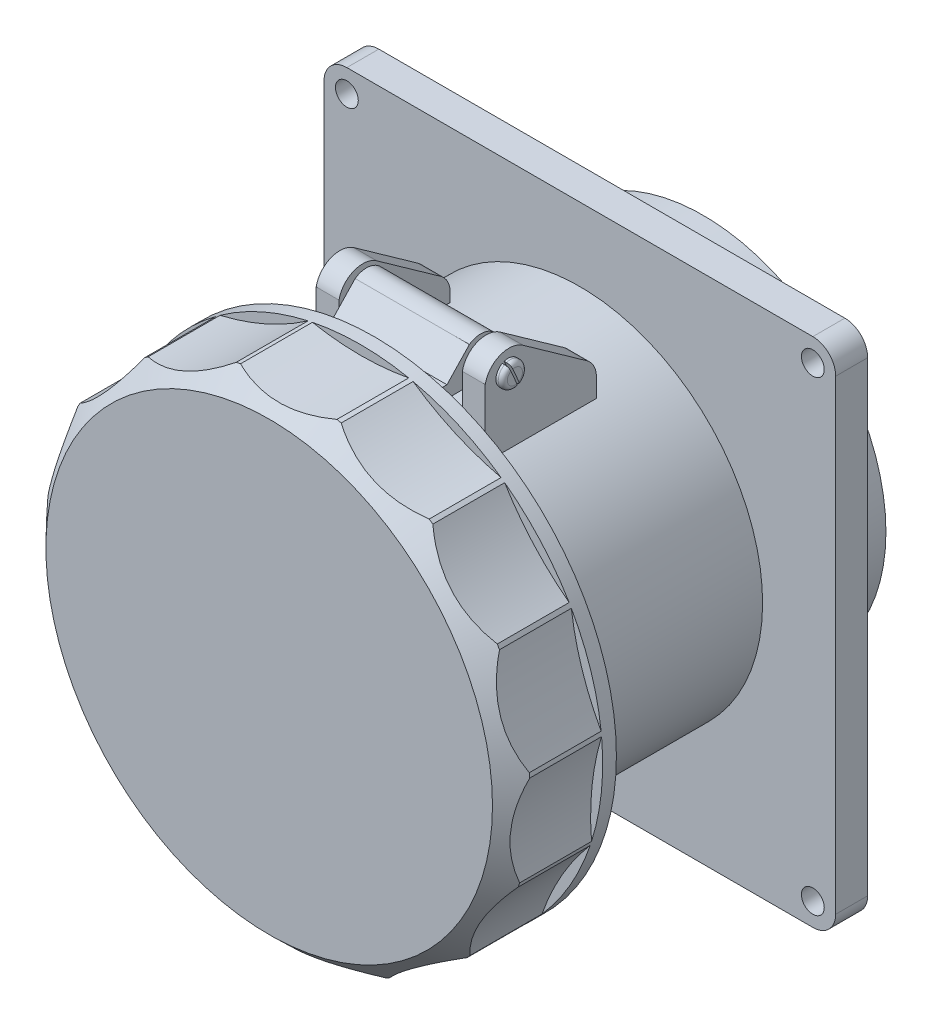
ISO-10303-21;
HEADER;
FILE_DESCRIPTION(('STEP AP214'),'2;1');
FILE_NAME('part.step','',(''),(''),'','','');
FILE_SCHEMA(('AUTOMOTIVE_DESIGN { 1 0 10303 214 1 1 1 1 }'));
ENDSEC;
DATA;
#1=APPLICATION_CONTEXT('core data for automotive mechanical design processes');
#2=APPLICATION_PROTOCOL_DEFINITION('international standard','automotive_design',2000,#1);
#3=PRODUCT_CONTEXT('',#1,'mechanical');
#4=PRODUCT('Part','Part','',(#3));
#5=PRODUCT_RELATED_PRODUCT_CATEGORY('part','',(#4));
#6=PRODUCT_DEFINITION_FORMATION('','',#4);
#7=PRODUCT_DEFINITION_CONTEXT('part definition',#1,'design');
#8=PRODUCT_DEFINITION('design','',#6,#7);
#9=PRODUCT_DEFINITION_SHAPE('','',#8);
#10=(LENGTH_UNIT() NAMED_UNIT(*) SI_UNIT(.MILLI.,.METRE.));
#11=(NAMED_UNIT(*) PLANE_ANGLE_UNIT() SI_UNIT($,.RADIAN.));
#12=(NAMED_UNIT(*) SI_UNIT($,.STERADIAN.) SOLID_ANGLE_UNIT());
#13=UNCERTAINTY_MEASURE_WITH_UNIT(LENGTH_MEASURE(1.E-05),#10,'distance_accuracy_value','');
#14=(GEOMETRIC_REPRESENTATION_CONTEXT(3) GLOBAL_UNCERTAINTY_ASSIGNED_CONTEXT((#13)) GLOBAL_UNIT_ASSIGNED_CONTEXT((#10,
#11,#12)) REPRESENTATION_CONTEXT('',''));
#15=CARTESIAN_POINT('',(0.,0.,0.));
#16=DIRECTION('',(0.,0.,1.));
#17=DIRECTION('',(1.,0.,0.));
#18=AXIS2_PLACEMENT_3D('',#15,#16,#17);
#19=CARTESIAN_POINT('',(0.,0.,75.));
#20=DIRECTION('',(0.,0.,-1.));
#21=DIRECTION('',(-1.,0.,0.));
#22=AXIS2_PLACEMENT_3D('',#19,#20,#21);
#23=CYLINDRICAL_SURFACE('',#22,53.);
#24=CARTESIAN_POINT('',(0.,0.,52.));
#25=DIRECTION('',(0.,0.,1.));
#26=DIRECTION('',(1.,0.,0.));
#27=AXIS2_PLACEMENT_3D('',#24,#25,#26);
#28=CIRCLE('',#27,53.);
#29=CARTESIAN_POINT('',(53.,0.,52.));
#30=VERTEX_POINT('',#29);
#31=EDGE_CURVE('E620',#30,#30,#28,.T.);
#32=ORIENTED_EDGE('',*,*,#31,.T.);
#33=EDGE_LOOP('',(#32));
#34=FACE_BOUND('',#33,.T.);
#35=CARTESIAN_POINT('',(0.,0.,70.7303321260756));
#36=DIRECTION('',(0.,0.,-1.));
#37=DIRECTION('',(-1.,0.,0.));
#38=AXIS2_PLACEMENT_3D('',#35,#36,#37);
#39=CIRCLE('',#38,53.);
#40=CARTESIAN_POINT('',(-50.5544337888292,-15.9138060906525,70.7303321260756));
#41=VERTEX_POINT('',#40);
#42=CARTESIAN_POINT('',(-50.2532966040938,-16.8406110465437,70.7303321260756));
#43=VERTEX_POINT('',#42);
#44=EDGE_CURVE('E1765',#41,#43,#39,.F.);
#45=ORIENTED_EDGE('',*,*,#44,.F.);
#46=DIRECTION('',(0.,0.,1.));
#47=VECTOR('',#46,1.);
#48=CARTESIAN_POINT('',(-50.5544337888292,-15.9138060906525,55.));
#49=LINE('',#48,#47);
#50=CARTESIAN_POINT('',(-50.5544337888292,-15.9138060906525,55.));
#51=VERTEX_POINT('',#50);
#52=EDGE_CURVE('E518',#51,#41,#49,.T.);
#53=ORIENTED_EDGE('',*,*,#52,.F.);
#54=CARTESIAN_POINT('',(0.,0.,55.));
#55=DIRECTION('',(0.,0.,-1.));
#56=DIRECTION('',(-1.,0.,0.));
#57=AXIS2_PLACEMENT_3D('',#54,#55,#56);
#58=CIRCLE('',#57,53.);
#59=CARTESIAN_POINT('',(-52.7583644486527,5.05519343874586,55.));
#60=VERTEX_POINT('',#59);
#61=EDGE_CURVE('E756',#51,#60,#58,.T.);
#62=ORIENTED_EDGE('',*,*,#61,.T.);
#63=DIRECTION('',(0.,0.,1.));
#64=VECTOR('',#63,1.);
#65=CARTESIAN_POINT('',(-52.7583644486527,5.05519343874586,55.));
#66=LINE('',#65,#64);
#67=CARTESIAN_POINT('',(-52.7583644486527,5.05519343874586,70.7303321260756));
#68=VERTEX_POINT('',#67);
#69=EDGE_CURVE('E517',#60,#68,#66,.T.);
#70=ORIENTED_EDGE('',*,*,#69,.T.);
#71=CARTESIAN_POINT('',(-52.6565014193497,6.02435542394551,70.7303321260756));
#72=VERTEX_POINT('',#71);
#73=EDGE_CURVE('E1769',#72,#68,#39,.F.);
#74=ORIENTED_EDGE('',*,*,#73,.F.);
#75=DIRECTION('',(0.,0.,1.));
#76=VECTOR('',#75,1.);
#77=CARTESIAN_POINT('',(-52.6565014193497,6.02435542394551,55.));
#78=LINE('',#77,#76);
#79=CARTESIAN_POINT('',(-52.6565014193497,6.02435542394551,55.));
#80=VERTEX_POINT('',#79);
#81=EDGE_CURVE('E509',#80,#72,#78,.T.);
#82=ORIENTED_EDGE('',*,*,#81,.F.);
#83=CARTESIAN_POINT('',(0.,0.,55.));
#84=DIRECTION('',(0.,0.,-1.));
#85=DIRECTION('',(-1.,0.,0.));
#86=AXIS2_PLACEMENT_3D('',#83,#84,#85);
#87=CIRCLE('',#86,53.);
#88=CARTESIAN_POINT('',(-46.1410317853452,26.0769090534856,55.));
#89=VERTEX_POINT('',#88);
#90=EDGE_CURVE('E759',#80,#89,#87,.T.);
#91=ORIENTED_EDGE('',*,*,#90,.T.);
#92=DIRECTION('',(0.,0.,1.));
#93=VECTOR('',#92,1.);
#94=CARTESIAN_POINT('',(-46.1410317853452,26.0769090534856,55.));
#95=LINE('',#94,#93);
#96=CARTESIAN_POINT('',(-46.1410317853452,26.0769090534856,70.7303321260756));
#97=VERTEX_POINT('',#96);
#98=EDGE_CURVE('E508',#89,#97,#95,.T.);
#99=ORIENTED_EDGE('',*,*,#98,.T.);
#100=CARTESIAN_POINT('',(-45.653781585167,26.9208511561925,70.7303321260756));
#101=VERTEX_POINT('',#100);
#102=EDGE_CURVE('E2285',#101,#97,#39,.F.);
#103=ORIENTED_EDGE('',*,*,#102,.F.);
#104=DIRECTION('',(0.,0.,1.));
#105=VECTOR('',#104,1.);
#106=CARTESIAN_POINT('',(-45.653781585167,26.9208511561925,55.));
#107=LINE('',#106,#105);
#108=CARTESIAN_POINT('',(-45.653781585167,26.9208511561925,55.));
#109=VERTEX_POINT('',#108);
#110=EDGE_CURVE('E501',#109,#101,#107,.T.);
#111=ORIENTED_EDGE('',*,*,#110,.F.);
#112=CARTESIAN_POINT('',(0.,0.,55.));
#113=DIRECTION('',(0.,0.,-1.));
#114=DIRECTION('',(-1.,0.,0.));
#115=AXIS2_PLACEMENT_3D('',#112,#113,#114);
#116=CIRCLE('',#115,53.);
#117=CARTESIAN_POINT('',(-31.5454955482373,42.5896901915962,55.));
#118=VERTEX_POINT('',#117);
#119=EDGE_CURVE('E762',#109,#118,#116,.T.);
#120=ORIENTED_EDGE('',*,*,#119,.T.);
#121=DIRECTION('',(0.,0.,1.));
#122=VECTOR('',#121,1.);
#123=CARTESIAN_POINT('',(-31.5454955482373,42.5896901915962,55.));
#124=LINE('',#123,#122);
#125=CARTESIAN_POINT('',(-31.5454955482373,42.5896901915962,70.7303321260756));
#126=VERTEX_POINT('',#125);
#127=EDGE_CURVE('E484',#118,#126,#124,.T.);
#128=ORIENTED_EDGE('',*,*,#127,.T.);
#129=CARTESIAN_POINT('',(-30.7571081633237,43.1624871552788,70.7303321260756));
#130=VERTEX_POINT('',#129);
#131=EDGE_CURVE('E472',#130,#126,#39,.F.);
#132=ORIENTED_EDGE('',*,*,#131,.F.);
#133=DIRECTION('',(0.,0.,1.));
#134=VECTOR('',#133,1.);
#135=CARTESIAN_POINT('',(-30.7571081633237,43.1624871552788,55.));
#136=LINE('',#135,#134);
#137=CARTESIAN_POINT('',(-30.7571081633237,43.1624871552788,55.));
#138=VERTEX_POINT('',#137);
#139=EDGE_CURVE('E482',#138,#130,#136,.T.);
#140=ORIENTED_EDGE('',*,*,#139,.F.);
#141=CARTESIAN_POINT('',(0.,0.,55.));
#142=DIRECTION('',(0.,0.,-1.));
#143=DIRECTION('',(-1.,0.,0.));
#144=AXIS2_PLACEMENT_3D('',#141,#142,#143);
#145=CIRCLE('',#144,53.);
#146=CARTESIAN_POINT('',(-11.4954565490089,51.738326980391,55.));
#147=VERTEX_POINT('',#146);
#148=EDGE_CURVE('E764',#138,#147,#145,.T.);
#149=ORIENTED_EDGE('',*,*,#148,.T.);
#150=DIRECTION('',(0.,0.,1.));
#151=VECTOR('',#150,1.);
#152=CARTESIAN_POINT('',(-11.4954565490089,51.738326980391,55.));
#153=LINE('',#152,#151);
#154=CARTESIAN_POINT('',(-11.4954565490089,51.738326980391,70.7303321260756));
#155=VERTEX_POINT('',#154);
#156=EDGE_CURVE('E493',#147,#155,#153,.T.);
#157=ORIENTED_EDGE('',*,*,#156,.T.);
#158=CARTESIAN_POINT('',(-10.5422513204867,51.9409370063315,70.7303321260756));
#159=VERTEX_POINT('',#158);
#160=EDGE_CURVE('E56',#159,#155,#39,.F.);
#161=ORIENTED_EDGE('',*,*,#160,.F.);
#162=DIRECTION('',(0.,0.,1.));
#163=VECTOR('',#162,1.);
#164=CARTESIAN_POINT('',(-10.5422513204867,51.9409370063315,55.));
#165=LINE('',#164,#163);
#166=CARTESIAN_POINT('',(-10.5422513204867,51.9409370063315,55.));
#167=VERTEX_POINT('',#166);
#168=EDGE_CURVE('E617',#167,#159,#165,.T.);
#169=ORIENTED_EDGE('',*,*,#168,.F.);
#170=CARTESIAN_POINT('',(0.,0.,55.));
#171=DIRECTION('',(0.,0.,-1.));
#172=DIRECTION('',(-1.,0.,0.));
#173=AXIS2_PLACEMENT_3D('',#170,#171,#172);
#174=CIRCLE('',#173,53.);
#175=CARTESIAN_POINT('',(10.5422513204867,51.9409370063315,55.));
#176=VERTEX_POINT('',#175);
#177=EDGE_CURVE('E723',#167,#176,#174,.T.);
#178=ORIENTED_EDGE('',*,*,#177,.T.);
#179=DIRECTION('',(0.,0.,1.));
#180=VECTOR('',#179,1.);
#181=CARTESIAN_POINT('',(10.5422513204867,51.9409370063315,55.));
#182=LINE('',#181,#180);
#183=CARTESIAN_POINT('',(10.5422513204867,51.9409370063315,70.7303321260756));
#184=VERTEX_POINT('',#183);
#185=EDGE_CURVE('E616',#176,#184,#182,.T.);
#186=ORIENTED_EDGE('',*,*,#185,.T.);
#187=CARTESIAN_POINT('',(11.4954565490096,51.7383269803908,70.7303321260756));
#188=VERTEX_POINT('',#187);
#189=EDGE_CURVE('E1772',#188,#184,#39,.F.);
#190=ORIENTED_EDGE('',*,*,#189,.F.);
#191=DIRECTION('',(0.,0.,1.));
#192=VECTOR('',#191,1.);
#193=CARTESIAN_POINT('',(11.4954565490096,51.7383269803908,55.));
#194=LINE('',#193,#192);
#195=CARTESIAN_POINT('',(11.4954565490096,51.7383269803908,55.));
#196=VERTEX_POINT('',#195);
#197=EDGE_CURVE('E608',#196,#188,#194,.T.);
#198=ORIENTED_EDGE('',*,*,#197,.F.);
#199=CARTESIAN_POINT('',(0.,0.,55.));
#200=DIRECTION('',(0.,0.,-1.));
#201=DIRECTION('',(-1.,0.,0.));
#202=AXIS2_PLACEMENT_3D('',#199,#200,#201);
#203=CIRCLE('',#202,53.);
#204=CARTESIAN_POINT('',(30.7571081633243,43.1624871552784,55.));
#205=VERTEX_POINT('',#204);
#206=EDGE_CURVE('E726',#196,#205,#203,.T.);
#207=ORIENTED_EDGE('',*,*,#206,.T.);
#208=DIRECTION('',(0.,0.,1.));
#209=VECTOR('',#208,1.);
#210=CARTESIAN_POINT('',(30.7571081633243,43.1624871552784,55.));
#211=LINE('',#210,#209);
#212=CARTESIAN_POINT('',(30.7571081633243,43.1624871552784,70.7303321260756));
#213=VERTEX_POINT('',#212);
#214=EDGE_CURVE('E607',#205,#213,#211,.T.);
#215=ORIENTED_EDGE('',*,*,#214,.T.);
#216=CARTESIAN_POINT('',(31.5454955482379,42.5896901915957,70.7303321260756));
#217=VERTEX_POINT('',#216);
#218=EDGE_CURVE('E1767',#217,#213,#39,.F.);
#219=ORIENTED_EDGE('',*,*,#218,.F.);
#220=DIRECTION('',(0.,0.,1.));
#221=VECTOR('',#220,1.);
#222=CARTESIAN_POINT('',(31.5454955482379,42.5896901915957,55.));
#223=LINE('',#222,#221);
#224=CARTESIAN_POINT('',(31.5454955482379,42.5896901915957,55.));
#225=VERTEX_POINT('',#224);
#226=EDGE_CURVE('E599',#225,#217,#223,.T.);
#227=ORIENTED_EDGE('',*,*,#226,.F.);
#228=CARTESIAN_POINT('',(0.,0.,55.));
#229=DIRECTION('',(0.,0.,-1.));
#230=DIRECTION('',(-1.,0.,0.));
#231=AXIS2_PLACEMENT_3D('',#228,#229,#230);
#232=CIRCLE('',#231,53.);
#233=CARTESIAN_POINT('',(45.6537815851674,26.9208511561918,55.));
#234=VERTEX_POINT('',#233);
#235=EDGE_CURVE('E729',#225,#234,#232,.T.);
#236=ORIENTED_EDGE('',*,*,#235,.T.);
#237=DIRECTION('',(0.,0.,1.));
#238=VECTOR('',#237,1.);
#239=CARTESIAN_POINT('',(45.6537815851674,26.9208511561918,55.));
#240=LINE('',#239,#238);
#241=CARTESIAN_POINT('',(45.6537815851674,26.9208511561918,70.7303321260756));
#242=VERTEX_POINT('',#241);
#243=EDGE_CURVE('E598',#234,#242,#240,.T.);
#244=ORIENTED_EDGE('',*,*,#243,.T.);
#245=CARTESIAN_POINT('',(46.1410317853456,26.076909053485,70.7303321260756));
#246=VERTEX_POINT('',#245);
#247=EDGE_CURVE('E1768',#246,#242,#39,.F.);
#248=ORIENTED_EDGE('',*,*,#247,.F.);
#249=DIRECTION('',(0.,0.,1.));
#250=VECTOR('',#249,1.);
#251=CARTESIAN_POINT('',(46.1410317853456,26.076909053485,55.));
#252=LINE('',#251,#250);
#253=CARTESIAN_POINT('',(46.1410317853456,26.076909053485,55.));
#254=VERTEX_POINT('',#253);
#255=EDGE_CURVE('E590',#254,#246,#252,.T.);
#256=ORIENTED_EDGE('',*,*,#255,.F.);
#257=CARTESIAN_POINT('',(0.,0.,55.));
#258=DIRECTION('',(0.,0.,-1.));
#259=DIRECTION('',(-1.,0.,0.));
#260=AXIS2_PLACEMENT_3D('',#257,#258,#259);
#261=CIRCLE('',#260,53.);
#262=CARTESIAN_POINT('',(52.6565014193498,6.0243554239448,55.));
#263=VERTEX_POINT('',#262);
#264=EDGE_CURVE('E732',#254,#263,#261,.T.);
#265=ORIENTED_EDGE('',*,*,#264,.T.);
#266=DIRECTION('',(0.,0.,1.));
#267=VECTOR('',#266,1.);
#268=CARTESIAN_POINT('',(52.6565014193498,6.0243554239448,55.));
#269=LINE('',#268,#267);
#270=CARTESIAN_POINT('',(52.6565014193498,6.0243554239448,70.7303321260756));
#271=VERTEX_POINT('',#270);
#272=EDGE_CURVE('E589',#263,#271,#269,.T.);
#273=ORIENTED_EDGE('',*,*,#272,.T.);
#274=CARTESIAN_POINT('',(52.7583644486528,5.05519343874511,70.7303321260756));
#275=VERTEX_POINT('',#274);
#276=EDGE_CURVE('E1775',#275,#271,#39,.F.);
#277=ORIENTED_EDGE('',*,*,#276,.F.);
#278=DIRECTION('',(0.,0.,1.));
#279=VECTOR('',#278,1.);
#280=CARTESIAN_POINT('',(52.7583644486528,5.05519343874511,55.));
#281=LINE('',#280,#279);
#282=CARTESIAN_POINT('',(52.7583644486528,5.05519343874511,55.));
#283=VERTEX_POINT('',#282);
#284=EDGE_CURVE('E581',#283,#275,#281,.T.);
#285=ORIENTED_EDGE('',*,*,#284,.F.);
#286=CARTESIAN_POINT('',(0.,0.,55.));
#287=DIRECTION('',(0.,0.,-1.));
#288=DIRECTION('',(-1.,0.,0.));
#289=AXIS2_PLACEMENT_3D('',#286,#287,#288);
#290=CIRCLE('',#289,53.);
#291=CARTESIAN_POINT('',(50.554433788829,-15.9138060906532,55.));
#292=VERTEX_POINT('',#291);
#293=EDGE_CURVE('E735',#283,#292,#290,.T.);
#294=ORIENTED_EDGE('',*,*,#293,.T.);
#295=DIRECTION('',(0.,0.,1.));
#296=VECTOR('',#295,1.);
#297=CARTESIAN_POINT('',(50.554433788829,-15.9138060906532,55.));
#298=LINE('',#297,#296);
#299=CARTESIAN_POINT('',(50.554433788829,-15.9138060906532,70.7303321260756));
#300=VERTEX_POINT('',#299);
#301=EDGE_CURVE('E580',#292,#300,#298,.T.);
#302=ORIENTED_EDGE('',*,*,#301,.T.);
#303=CARTESIAN_POINT('',(50.2532966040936,-16.8406110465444,70.7303321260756));
#304=VERTEX_POINT('',#303);
#305=EDGE_CURVE('E1780',#304,#300,#39,.F.);
#306=ORIENTED_EDGE('',*,*,#305,.F.);
#307=DIRECTION('',(0.,0.,1.));
#308=VECTOR('',#307,1.);
#309=CARTESIAN_POINT('',(50.2532966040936,-16.8406110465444,55.));
#310=LINE('',#309,#308);
#311=CARTESIAN_POINT('',(50.2532966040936,-16.8406110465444,55.));
#312=VERTEX_POINT('',#311);
#313=EDGE_CURVE('E572',#312,#304,#310,.T.);
#314=ORIENTED_EDGE('',*,*,#313,.F.);
#315=CARTESIAN_POINT('',(0.,0.,55.));
#316=DIRECTION('',(0.,0.,-1.));
#317=DIRECTION('',(-1.,0.,0.));
#318=AXIS2_PLACEMENT_3D('',#315,#316,#317);
#319=CIRCLE('',#318,53.);
#320=CARTESIAN_POINT('',(39.7110452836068,-35.1003259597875,55.));
#321=VERTEX_POINT('',#320);
#322=EDGE_CURVE('E738',#312,#321,#319,.T.);
#323=ORIENTED_EDGE('',*,*,#322,.T.);
#324=DIRECTION('',(0.,0.,1.));
#325=VECTOR('',#324,1.);
#326=CARTESIAN_POINT('',(39.7110452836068,-35.1003259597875,55.));
#327=LINE('',#326,#325);
#328=CARTESIAN_POINT('',(39.7110452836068,-35.1003259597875,70.7303321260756));
#329=VERTEX_POINT('',#328);
#330=EDGE_CURVE('E571',#321,#329,#327,.T.);
#331=ORIENTED_EDGE('',*,*,#330,.T.);
#332=CARTESIAN_POINT('',(39.0589772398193,-35.824520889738,70.7303321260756));
#333=VERTEX_POINT('',#332);
#334=EDGE_CURVE('E1793',#333,#329,#39,.F.);
#335=ORIENTED_EDGE('',*,*,#334,.F.);
#336=DIRECTION('',(0.,0.,1.));
#337=VECTOR('',#336,1.);
#338=CARTESIAN_POINT('',(39.0589772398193,-35.824520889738,55.));
#339=LINE('',#338,#337);
#340=CARTESIAN_POINT('',(39.0589772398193,-35.824520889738,55.));
#341=VERTEX_POINT('',#340);
#342=EDGE_CURVE('E563',#341,#333,#339,.T.);
#343=ORIENTED_EDGE('',*,*,#342,.F.);
#344=CARTESIAN_POINT('',(0.,0.,55.));
#345=DIRECTION('',(0.,0.,-1.));
#346=DIRECTION('',(-1.,0.,0.));
#347=AXIS2_PLACEMENT_3D('',#344,#345,#346);
#348=CIRCLE('',#347,53.);
#349=CARTESIAN_POINT('',(22.0012562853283,-48.2176805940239,55.));
#350=VERTEX_POINT('',#349);
#351=EDGE_CURVE('E741',#341,#350,#348,.T.);
#352=ORIENTED_EDGE('',*,*,#351,.T.);
#353=DIRECTION('',(0.,0.,1.));
#354=VECTOR('',#353,1.);
#355=CARTESIAN_POINT('',(22.0012562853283,-48.2176805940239,55.));
#356=LINE('',#355,#354);
#357=CARTESIAN_POINT('',(22.0012562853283,-48.2176805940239,70.7303321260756));
#358=VERTEX_POINT('',#357);
#359=EDGE_CURVE('E562',#350,#358,#356,.T.);
#360=ORIENTED_EDGE('',*,*,#359,.T.);
#361=CARTESIAN_POINT('',(21.1110058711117,-48.6140456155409,70.7303321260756));
#362=VERTEX_POINT('',#361);
#363=EDGE_CURVE('E487',#362,#358,#39,.F.);
#364=ORIENTED_EDGE('',*,*,#363,.F.);
#365=DIRECTION('',(0.,0.,1.));
#366=VECTOR('',#365,1.);
#367=CARTESIAN_POINT('',(21.1110058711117,-48.6140456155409,55.));
#368=LINE('',#367,#366);
#369=CARTESIAN_POINT('',(21.1110058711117,-48.6140456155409,55.));
#370=VERTEX_POINT('',#369);
#371=EDGE_CURVE('E554',#370,#362,#368,.T.);
#372=ORIENTED_EDGE('',*,*,#371,.F.);
#373=CARTESIAN_POINT('',(0.,0.,55.));
#374=DIRECTION('',(0.,0.,-1.));
#375=DIRECTION('',(-1.,0.,0.));
#376=AXIS2_PLACEMENT_3D('',#373,#374,#375);
#377=CIRCLE('',#376,53.);
#378=CARTESIAN_POINT('',(0.487250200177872,-52.9977602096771,55.));
#379=VERTEX_POINT('',#378);
#380=EDGE_CURVE('E744',#370,#379,#377,.T.);
#381=ORIENTED_EDGE('',*,*,#380,.T.);
#382=DIRECTION('',(0.,0.,1.));
#383=VECTOR('',#382,1.);
#384=CARTESIAN_POINT('',(0.487250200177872,-52.9977602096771,55.));
#385=LINE('',#384,#383);
#386=CARTESIAN_POINT('',(0.487250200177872,-52.997760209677,70.7303321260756));
#387=VERTEX_POINT('',#386);
#388=EDGE_CURVE('E553',#379,#387,#385,.T.);
#389=ORIENTED_EDGE('',*,*,#388,.T.);
#390=CARTESIAN_POINT('',(-0.48725020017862,-52.997760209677,70.7303321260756));
#391=VERTEX_POINT('',#390);
#392=EDGE_CURVE('E1183',#391,#387,#39,.F.);
#393=ORIENTED_EDGE('',*,*,#392,.F.);
#394=DIRECTION('',(0.,0.,1.));
#395=VECTOR('',#394,1.);
#396=CARTESIAN_POINT('',(-0.48725020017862,-52.997760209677,55.));
#397=LINE('',#396,#395);
#398=CARTESIAN_POINT('',(-0.48725020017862,-52.997760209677,55.));
#399=VERTEX_POINT('',#398);
#400=EDGE_CURVE('E545',#399,#391,#397,.T.);
#401=ORIENTED_EDGE('',*,*,#400,.F.);
#402=CARTESIAN_POINT('',(0.,0.,55.));
#403=DIRECTION('',(0.,0.,-1.));
#404=DIRECTION('',(-1.,0.,0.));
#405=AXIS2_PLACEMENT_3D('',#402,#403,#404);
#406=CIRCLE('',#405,53.);
#407=CARTESIAN_POINT('',(-21.1110058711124,-48.6140456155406,55.));
#408=VERTEX_POINT('',#407);
#409=EDGE_CURVE('E747',#399,#408,#406,.T.);
#410=ORIENTED_EDGE('',*,*,#409,.T.);
#411=DIRECTION('',(0.,0.,1.));
#412=VECTOR('',#411,1.);
#413=CARTESIAN_POINT('',(-21.1110058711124,-48.6140456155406,55.));
#414=LINE('',#413,#412);
#415=CARTESIAN_POINT('',(-21.1110058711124,-48.6140456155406,70.7303321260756));
#416=VERTEX_POINT('',#415);
#417=EDGE_CURVE('E544',#408,#416,#414,.T.);
#418=ORIENTED_EDGE('',*,*,#417,.T.);
#419=CARTESIAN_POINT('',(-22.0012562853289,-48.2176805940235,70.7303321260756));
#420=VERTEX_POINT('',#419);
#421=EDGE_CURVE('E1788',#420,#416,#39,.F.);
#422=ORIENTED_EDGE('',*,*,#421,.F.);
#423=DIRECTION('',(0.,0.,1.));
#424=VECTOR('',#423,1.);
#425=CARTESIAN_POINT('',(-22.0012562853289,-48.2176805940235,55.));
#426=LINE('',#425,#424);
#427=CARTESIAN_POINT('',(-22.0012562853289,-48.2176805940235,55.));
#428=VERTEX_POINT('',#427);
#429=EDGE_CURVE('E536',#428,#420,#426,.T.);
#430=ORIENTED_EDGE('',*,*,#429,.F.);
#431=CARTESIAN_POINT('',(0.,0.,55.));
#432=DIRECTION('',(0.,0.,-1.));
#433=DIRECTION('',(-1.,0.,0.));
#434=AXIS2_PLACEMENT_3D('',#431,#432,#433);
#435=CIRCLE('',#434,53.);
#436=CARTESIAN_POINT('',(-39.0589772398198,-35.8245208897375,55.));
#437=VERTEX_POINT('',#436);
#438=EDGE_CURVE('E750',#428,#437,#435,.T.);
#439=ORIENTED_EDGE('',*,*,#438,.T.);
#440=DIRECTION('',(0.,0.,1.));
#441=VECTOR('',#440,1.);
#442=CARTESIAN_POINT('',(-39.0589772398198,-35.8245208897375,55.));
#443=LINE('',#442,#441);
#444=CARTESIAN_POINT('',(-39.0589772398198,-35.8245208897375,70.7303321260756));
#445=VERTEX_POINT('',#444);
#446=EDGE_CURVE('E535',#437,#445,#443,.T.);
#447=ORIENTED_EDGE('',*,*,#446,.T.);
#448=CARTESIAN_POINT('',(-39.7110452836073,-35.1003259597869,70.7303321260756));
#449=VERTEX_POINT('',#448);
#450=EDGE_CURVE('E1777',#449,#445,#39,.F.);
#451=ORIENTED_EDGE('',*,*,#450,.F.);
#452=DIRECTION('',(0.,0.,1.));
#453=VECTOR('',#452,1.);
#454=CARTESIAN_POINT('',(-39.7110452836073,-35.1003259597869,55.));
#455=LINE('',#454,#453);
#456=CARTESIAN_POINT('',(-39.7110452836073,-35.1003259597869,55.));
#457=VERTEX_POINT('',#456);
#458=EDGE_CURVE('E527',#457,#449,#455,.T.);
#459=ORIENTED_EDGE('',*,*,#458,.F.);
#460=CARTESIAN_POINT('',(0.,0.,55.));
#461=DIRECTION('',(0.,0.,-1.));
#462=DIRECTION('',(-1.,0.,0.));
#463=AXIS2_PLACEMENT_3D('',#460,#461,#462);
#464=CIRCLE('',#463,53.);
#465=CARTESIAN_POINT('',(-50.2532966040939,-16.8406110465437,55.));
#466=VERTEX_POINT('',#465);
#467=EDGE_CURVE('E753',#457,#466,#464,.T.);
#468=ORIENTED_EDGE('',*,*,#467,.T.);
#469=DIRECTION('',(0.,0.,1.));
#470=VECTOR('',#469,1.);
#471=CARTESIAN_POINT('',(-50.2532966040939,-16.8406110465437,55.));
#472=LINE('',#471,#470);
#473=EDGE_CURVE('E526',#466,#43,#472,.T.);
#474=ORIENTED_EDGE('',*,*,#473,.T.);
#475=EDGE_LOOP('',(#45,#53,#62,#70,#74,#82,#91,#99,#103,#111,#120,#128,#132,#140,#149,#157,#161,
#169,#178,#186,#190,#198,#207,#215,#219,#227,#236,#244,#248,#256,#265,#273,#277,#285,#294,#302,
#306,#314,#323,#331,#335,#343,#352,#360,#364,#372,#381,#389,#393,#401,#410,#418,#422,#430,#439,
#447,#451,#459,#468,#474));
#476=FACE_BOUND('',#475,.T.);
#477=ADVANCED_FACE('F36',(#34,#476),#23,.T.);
#478=CARTESIAN_POINT('',(0.,107.085618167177,55.));
#479=DIRECTION('',(0.,0.,1.));
#480=DIRECTION('',(1.,0.,0.));
#481=AXIS2_PLACEMENT_3D('',#478,#479,#480);
#482=CYLINDRICAL_SURFACE('',#481,56.1433426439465);
#483=CARTESIAN_POINT('',(10.5424513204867,51.9409752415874,70.7302521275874));
#484=CARTESIAN_POINT('',(9.88930044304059,51.81606341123,70.9916104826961));
#485=CARTESIAN_POINT('',(9.22601074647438,51.701328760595,71.2335281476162));
#486=CARTESIAN_POINT('',(7.88068619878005,51.4939614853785,71.6731809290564));
#487=CARTESIAN_POINT('',(7.19862872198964,51.4013569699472,71.8708598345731));
#488=CARTESIAN_POINT('',(5.82087362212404,51.2405457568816,72.2155673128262));
#489=CARTESIAN_POINT('',(5.1252189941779,51.1722722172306,72.3627346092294));
#490=CARTESIAN_POINT('',(3.72277148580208,51.0614245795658,72.6023042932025));
#491=CARTESIAN_POINT('',(3.01598389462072,51.0188386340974,72.6947319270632));
#492=CARTESIAN_POINT('',(1.5906329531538,50.9602464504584,72.8220244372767));
#493=CARTESIAN_POINT('',(0.872020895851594,50.9444456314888,72.8564444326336));
#494=CARTESIAN_POINT('',(-0.565779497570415,50.9405230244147,72.864982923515));
#495=CARTESIAN_POINT('',(-1.28496791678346,50.9524064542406,72.8390900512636));
#496=CARTESIAN_POINT('',(-2.71737520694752,51.0034969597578,72.7280417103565));
#497=CARTESIAN_POINT('',(-3.43059663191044,51.0426916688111,72.6429130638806));
#498=CARTESIAN_POINT('',(-4.84594138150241,51.1473024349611,72.416621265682));
#499=CARTESIAN_POINT('',(-5.54806733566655,51.2127121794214,72.2754716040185));
#500=CARTESIAN_POINT('',(-6.61086089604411,51.3316128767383,72.020293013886));
#501=CARTESIAN_POINT('',(-6.97707751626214,51.3762820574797,71.9246431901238));
#502=CARTESIAN_POINT('',(-7.70472360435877,51.4722503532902,71.7197749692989));
#503=CARTESIAN_POINT('',(-8.06615414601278,51.5235479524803,71.6105596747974));
#504=CARTESIAN_POINT('',(-9.14124706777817,51.686722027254,71.2643336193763));
#505=CARTESIAN_POINT('',(-9.84744346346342,51.8080759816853,71.0083194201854));
#506=CARTESIAN_POINT('',(-10.5424513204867,51.9409752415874,70.7302521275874));
#507=B_SPLINE_CURVE_WITH_KNOTS('',3,(#483,#484,#485,#486,#487,#488,#489,#490,#491,#492,#493,
#494,#495,#496,#497,#498,#499,#500,#501,#502,#503,#504,#505,#506),.UNSPECIFIED.,.F.,.F.,(4,2,2,
2,2,2,2,2,2,2,2,4),(0.,2.14367624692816,4.29006103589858,6.43050298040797,8.56995696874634,
10.7257457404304,12.8819408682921,15.0371602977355,17.1918610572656,18.3349577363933,
19.4777934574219,21.7580974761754),.UNSPECIFIED.);
#508=EDGE_CURVE('E1091',#184,#159,#507,.T.);
#509=ORIENTED_EDGE('',*,*,#508,.F.);
#510=ORIENTED_EDGE('',*,*,#185,.F.);
#511=CARTESIAN_POINT('',(0.,107.085618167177,55.));
#512=DIRECTION('',(0.,0.,1.));
#513=DIRECTION('',(-1.,0.,0.));
#514=AXIS2_PLACEMENT_3D('',#511,#512,#513);
#515=CIRCLE('',#514,56.1433426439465);
#516=EDGE_CURVE('E611',#167,#176,#515,.T.);
#517=ORIENTED_EDGE('',*,*,#516,.F.);
#518=ORIENTED_EDGE('',*,*,#168,.T.);
#519=EDGE_LOOP('',(#509,#510,#517,#518));
#520=FACE_BOUND('',#519,.T.);
#521=ADVANCED_FACE('F934',(#520),#482,.F.);
#522=CARTESIAN_POINT('',(43.5556448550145,97.8275800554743,55.));
#523=DIRECTION('',(0.,0.,1.));
#524=DIRECTION('',(1.,0.,0.));
#525=AXIS2_PLACEMENT_3D('',#522,#523,#524);
#526=CYLINDRICAL_SURFACE('',#525,56.1433426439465);
#527=CARTESIAN_POINT('',(30.7573081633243,43.1624403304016,70.7302514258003));
#528=CARTESIAN_POINT('',(30.1098189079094,43.3139880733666,70.9916098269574));
#529=CARTESIAN_POINT('',(29.4572068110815,43.478956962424,71.2335275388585));
#530=CARTESIAN_POINT('',(28.1438477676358,43.8367102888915,71.6731804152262));
#531=CARTESIAN_POINT('',(27.4830915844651,44.029529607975,71.8708593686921));
#532=CARTESIAN_POINT('',(26.1590418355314,44.4430047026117,72.2155669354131));
#533=CARTESIAN_POINT('',(25.4957603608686,44.6635819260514,72.3627342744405));
#534=CARTESIAN_POINT('',(24.1694750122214,45.1327443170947,72.6023040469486));
#535=CARTESIAN_POINT('',(23.5064711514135,45.3813165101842,72.6947317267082));
#536=CARTESIAN_POINT('',(22.1805166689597,45.9075323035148,72.8220243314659));
#537=CARTESIAN_POINT('',(21.5176051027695,46.1853833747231,72.8564443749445));
#538=CARTESIAN_POINT('',(20.2025135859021,46.7666059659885,72.8649829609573));
#539=CARTESIAN_POINT('',(19.5503356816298,47.0699822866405,72.8390901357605));
#540=CARTESIAN_POINT('',(18.2625468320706,47.69926829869,72.7280418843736));
#541=CARTESIAN_POINT('',(17.6269285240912,48.0251677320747,72.642913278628));
#542=CARTESIAN_POINT('',(16.376495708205,48.6964069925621,72.4166215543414));
#543=CARTESIAN_POINT('',(15.7616762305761,49.0417421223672,72.2754719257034));
#544=CARTESIAN_POINT('',(14.8391241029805,49.5826422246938,72.0202925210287));
#545=CARTESIAN_POINT('',(14.5227341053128,49.7724051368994,71.9246417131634));
#546=CARTESIAN_POINT('',(13.897024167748,50.1560406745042,71.7197712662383));
#547=CARTESIAN_POINT('',(13.5877026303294,50.349912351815,71.6105547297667));
#548=CARTESIAN_POINT('',(12.6719167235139,50.9362648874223,71.264324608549));
#549=CARTESIAN_POINT('',(12.0761279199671,51.3343672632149,71.0083072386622));
#550=CARTESIAN_POINT('',(11.4952565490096,51.7384661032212,70.7302364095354));
#551=B_SPLINE_CURVE_WITH_KNOTS('',3,(#527,#528,#529,#530,#531,#532,#533,#534,#535,#536,#537,
#538,#539,#540,#541,#542,#543,#544,#545,#546,#547,#548,#549,#550),.UNSPECIFIED.,.F.,.F.,(4,2,2,
2,2,2,2,2,2,2,2,4),(0.,2.14367634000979,4.2900612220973,6.43050316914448,8.56995716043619,
10.7257459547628,12.8819411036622,15.0371606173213,17.1918614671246,18.3349692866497,
19.4778161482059,21.7581423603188),.UNSPECIFIED.);
#552=EDGE_CURVE('E1116',#213,#188,#551,.T.);
#553=ORIENTED_EDGE('',*,*,#552,.F.);
#554=ORIENTED_EDGE('',*,*,#214,.F.);
#555=CARTESIAN_POINT('',(43.5556448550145,97.8275800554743,55.));
#556=DIRECTION('',(0.,0.,1.));
#557=DIRECTION('',(-0.913545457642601,0.406736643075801,0.));
#558=AXIS2_PLACEMENT_3D('',#555,#556,#557);
#559=CIRCLE('',#558,56.1433426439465);
#560=EDGE_CURVE('E602',#196,#205,#559,.T.);
#561=ORIENTED_EDGE('',*,*,#560,.F.);
#562=ORIENTED_EDGE('',*,*,#197,.T.);
#563=EDGE_LOOP('',(#553,#554,#561,#562));
#564=FACE_BOUND('',#563,.T.);
#565=ADVANCED_FACE('F940',(#564),#526,.F.);
#566=CARTESIAN_POINT('',(79.5801230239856,71.654264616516,55.));
#567=DIRECTION('',(0.,0.,1.));
#568=DIRECTION('',(1.,0.,0.));
#569=AXIS2_PLACEMENT_3D('',#566,#567,#568);
#570=CYLINDRICAL_SURFACE('',#569,56.1433426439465);
#571=CARTESIAN_POINT('',(45.6539815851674,26.9206994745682,70.7302335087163));
#572=CARTESIAN_POINT('',(45.1241104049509,27.3225024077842,70.9915929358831));
#573=CARTESIAN_POINT('',(44.5950181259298,27.7386498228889,71.2335117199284));
#574=CARTESIAN_POINT('',(43.5407155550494,28.5996642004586,71.6731668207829));
#575=CARTESIAN_POINT('',(43.0155110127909,29.0445667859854,71.870846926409));
#576=CARTESIAN_POINT('',(41.9741059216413,29.9608339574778,72.2155568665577));
#577=CARTESIAN_POINT('',(41.4578844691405,30.4321218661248,72.3627254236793));
#578=CARTESIAN_POINT('',(40.4370869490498,31.4001713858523,72.6022976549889));
#579=CARTESIAN_POINT('',(39.9325056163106,31.8969211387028,72.6947265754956));
#580=CARTESIAN_POINT('',(38.9352158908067,32.9169571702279,72.8220216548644));
#581=CARTESIAN_POINT('',(38.4426275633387,33.4404170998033,72.8564429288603));
#582=CARTESIAN_POINT('',(37.4776347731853,34.5062862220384,72.8649839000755));
#583=CARTESIAN_POINT('',(37.005234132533,35.0486989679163,72.839092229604));
#584=CARTESIAN_POINT('',(36.0847326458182,36.1473714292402,72.7280461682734));
#585=CARTESIAN_POINT('',(35.6366209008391,36.703624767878,72.6429185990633));
#586=CARTESIAN_POINT('',(34.7673097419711,37.8254295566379,72.4166288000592));
#587=CARTESIAN_POINT('',(34.3461038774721,38.3909787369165,72.275480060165));
#588=CARTESIAN_POINT('',(33.7233121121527,39.2603533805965,72.0203014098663));
#589=CARTESIAN_POINT('',(33.5114574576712,39.5623996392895,71.9246504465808));
#590=CARTESIAN_POINT('',(33.0958786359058,40.1673709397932,71.7197794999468));
#591=CARTESIAN_POINT('',(32.8921526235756,40.4702957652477,71.6105626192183));
#592=CARTESIAN_POINT('',(32.2940274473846,41.3784446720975,71.2643312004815));
#593=CARTESIAN_POINT('',(31.9116675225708,41.9844621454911,71.0083126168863));
#594=CARTESIAN_POINT('',(31.5453745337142,42.5898901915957,70.7302402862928));
#595=B_SPLINE_CURVE_WITH_KNOTS('',3,(#571,#572,#573,#574,#575,#576,#577,#578,#579,#580,#581,
#582,#583,#584,#585,#586,#587,#588,#589,#590,#591,#592,#593,#594),.UNSPECIFIED.,.F.,.F.,(4,2,2,
2,2,2,2,2,2,2,2,4),(0.,2.14367749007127,4.29006353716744,6.43050677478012,8.56996205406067,
10.7257522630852,12.8819488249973,15.0371697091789,17.1918719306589,18.3349867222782,
19.4778405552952,21.7581807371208),.UNSPECIFIED.);
#596=EDGE_CURVE('E1130',#242,#217,#595,.T.);
#597=ORIENTED_EDGE('',*,*,#596,.F.);
#598=ORIENTED_EDGE('',*,*,#243,.F.);
#599=CARTESIAN_POINT('',(79.5801230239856,71.654264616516,55.));
#600=DIRECTION('',(0.,0.,1.));
#601=DIRECTION('',(-0.669130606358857,0.743144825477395,0.));
#602=AXIS2_PLACEMENT_3D('',#599,#600,#601);
#603=CIRCLE('',#602,56.1433426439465);
#604=EDGE_CURVE('E593',#225,#234,#603,.T.);
#605=ORIENTED_EDGE('',*,*,#604,.F.);
#606=ORIENTED_EDGE('',*,*,#226,.T.);
#607=EDGE_LOOP('',(#597,#598,#605,#606));
#608=FACE_BOUND('',#607,.T.);
#609=ADVANCED_FACE('F1229',(#608),#570,.F.);
#610=CARTESIAN_POINT('',(101.844474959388,33.091275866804,55.));
#611=DIRECTION('',(0.,0.,1.));
#612=DIRECTION('',(1.,0.,0.));
#613=AXIS2_PLACEMENT_3D('',#610,#611,#612);
#614=CYLINDRICAL_SURFACE('',#613,56.1433426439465);
#615=CARTESIAN_POINT('',(52.6566114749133,6.0241554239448,70.7302424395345));
#616=CARTESIAN_POINT('',(52.335978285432,6.6067388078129,70.9916013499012));
#617=CARTESIAN_POINT('',(52.0218910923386,7.20210971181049,71.2335195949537));
#618=CARTESIAN_POINT('',(51.4089443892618,8.4175091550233,71.6731735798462));
#619=CARTESIAN_POINT('',(51.1101046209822,9.03756789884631,71.8708531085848));
#620=CARTESIAN_POINT('',(50.5314137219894,10.2981973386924,72.2155618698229));
#621=CARTESIAN_POINT('',(50.2515123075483,10.9387064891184,72.3627298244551));
#622=CARTESIAN_POINT('',(49.7127091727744,12.2382595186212,72.6023008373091));
#623=CARTESIAN_POINT('',(49.4537978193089,12.8972947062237,72.6947291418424));
#624=CARTESIAN_POINT('',(48.9576149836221,14.2347781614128,72.8220229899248));
#625=CARTESIAN_POINT('',(48.7205238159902,14.913336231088,72.8564436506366));
#626=CARTESIAN_POINT('',(48.2724877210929,16.2795538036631,72.8649834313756));
#627=CARTESIAN_POINT('',(48.0615477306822,16.9672149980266,72.8390911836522));
#628=CARTESIAN_POINT('',(47.6674987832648,18.3453035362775,72.7280440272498));
#629=CARTESIAN_POINT('',(47.4843772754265,19.0357294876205,72.6429159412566));
#630=CARTESIAN_POINT('',(47.1465017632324,20.4141293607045,72.4166251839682));
#631=CARTESIAN_POINT('',(46.9917409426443,21.1021038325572,72.2754760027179));
#632=CARTESIAN_POINT('',(46.7764001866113,22.1496247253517,72.0202977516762));
#633=CARTESIAN_POINT('',(46.7057155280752,22.5117224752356,71.9246477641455));
#634=CARTESIAN_POINT('',(46.5721310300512,23.2334138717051,71.7197790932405));
#635=CARTESIAN_POINT('',(46.509229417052,23.5930080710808,71.6105635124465));
#636=CARTESIAN_POINT('',(46.3321942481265,24.6659102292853,71.2643364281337));
#637=CARTESIAN_POINT('',(46.2293815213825,25.3750462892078,71.0083213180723));
#638=CARTESIAN_POINT('',(46.1410066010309,26.077109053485,70.7302529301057));
#639=B_SPLINE_CURVE_WITH_KNOTS('',3,(#615,#616,#617,#618,#619,#620,#621,#622,#623,#624,#625,
#626,#627,#628,#629,#630,#631,#632,#633,#634,#635,#636,#637,#638),.UNSPECIFIED.,.F.,.F.,(4,2,2,
2,2,2,2,2,2,2,2,4),(0.,2.14367687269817,4.29006229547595,6.43050493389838,8.56995961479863,
10.7257491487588,12.8819450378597,15.0371652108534,17.191866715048,18.3349680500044,
19.4778084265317,21.7581217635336),.UNSPECIFIED.);
#640=EDGE_CURVE('E1144',#271,#246,#639,.T.);
#641=ORIENTED_EDGE('',*,*,#640,.F.);
#642=ORIENTED_EDGE('',*,*,#272,.F.);
#643=CARTESIAN_POINT('',(101.844474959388,33.091275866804,55.));
#644=DIRECTION('',(0.,0.,1.));
#645=DIRECTION('',(-0.309016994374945,0.951056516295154,0.));
#646=AXIS2_PLACEMENT_3D('',#643,#644,#645);
#647=CIRCLE('',#646,56.1433426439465);
#648=EDGE_CURVE('E584',#254,#263,#647,.T.);
#649=ORIENTED_EDGE('',*,*,#648,.F.);
#650=ORIENTED_EDGE('',*,*,#255,.T.);
#651=EDGE_LOOP('',(#641,#642,#649,#650));
#652=FACE_BOUND('',#651,.T.);
#653=ADVANCED_FACE('F1221',(#652),#614,.F.);
#654=CARTESIAN_POINT('',(106.498991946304,-11.1934951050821,55.));
#655=DIRECTION('',(0.,0.,1.));
#656=DIRECTION('',(1.,0.,0.));
#657=AXIS2_PLACEMENT_3D('',#654,#655,#656);
#658=CYLINDRICAL_SURFACE('',#657,56.1433426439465);
#659=CARTESIAN_POINT('',(50.5544506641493,-15.9140060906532,70.7302532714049));
#660=CARTESIAN_POINT('',(50.4984960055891,-15.2513763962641,70.9916115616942));
#661=CARTESIAN_POINT('',(50.4537225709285,-14.5797272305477,71.2335291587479));
#662=CARTESIAN_POINT('',(50.3881160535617,-13.2200967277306,71.6731817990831));
#663=CARTESIAN_POINT('',(50.3673132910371,-12.5320958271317,71.8708606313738));
#664=CARTESIAN_POINT('',(50.3513977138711,-11.145078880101,72.2155679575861));
#665=CARTESIAN_POINT('',(50.3562139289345,-10.4460986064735,72.362735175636));
#666=CARTESIAN_POINT('',(50.3925692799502,-9.03974715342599,72.6023047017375));
#667=CARTESIAN_POINT('',(50.4240960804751,-8.33237999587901,72.694732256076));
#668=CARTESIAN_POINT('',(50.5148146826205,-6.90871277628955,72.8220246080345));
#669=CARTESIAN_POINT('',(50.5742158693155,-6.19238574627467,72.8564445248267));
#670=CARTESIAN_POINT('',(50.7206058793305,-4.76205181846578,72.8649828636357));
#671=CARTESIAN_POINT('',(50.8075999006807,-4.04804538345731,72.8390899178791));
#672=CARTESIAN_POINT('',(51.0081379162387,-2.62882546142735,72.7280414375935));
#673=CARTESIAN_POINT('',(51.1216698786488,-1.92360814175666,72.6429127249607));
#674=CARTESIAN_POINT('',(51.3736514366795,-0.526951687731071,72.4166208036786));
#675=CARTESIAN_POINT('',(51.5120950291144,0.164490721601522,72.2754710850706));
#676=CARTESIAN_POINT('',(51.741436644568,1.20903388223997,72.0202923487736));
#677=CARTESIAN_POINT('',(51.8241412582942,1.56857537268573,71.9246424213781));
#678=CARTESIAN_POINT('',(51.9956437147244,2.2822044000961,71.7197739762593));
#679=CARTESIAN_POINT('',(52.0844401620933,2.63629316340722,71.6105585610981));
#680=CARTESIAN_POINT('',(52.359098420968,3.68844096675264,71.2643321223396));
#681=CARTESIAN_POINT('',(52.5536053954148,4.37808424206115,71.0083176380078));
#682=CARTESIAN_POINT('',(52.7584249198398,5.0553934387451,70.7302500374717));
#683=B_SPLINE_CURVE_WITH_KNOTS('',3,(#659,#660,#661,#662,#663,#664,#665,#666,#667,#668,#669,
#670,#671,#672,#673,#674,#675,#676,#677,#678,#679,#680,#681,#682),.UNSPECIFIED.,.F.,.F.,(4,2,2,
2,2,2,2,2,2,2,2,4),(0.,2.14367617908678,4.29006089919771,6.43050275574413,8.569956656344,
10.7257453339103,12.8819403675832,15.037159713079,17.1918603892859,18.3349578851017,
19.4777944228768,21.7581000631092),.UNSPECIFIED.);
#684=EDGE_CURVE('E1158',#300,#275,#683,.T.);
#685=ORIENTED_EDGE('',*,*,#684,.F.);
#686=ORIENTED_EDGE('',*,*,#301,.F.);
#687=CARTESIAN_POINT('',(106.498991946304,-11.1934951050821,55.));
#688=DIRECTION('',(0.,0.,1.));
#689=DIRECTION('',(0.104528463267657,0.994521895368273,0.));
#690=AXIS2_PLACEMENT_3D('',#687,#688,#689);
#691=CIRCLE('',#690,56.1433426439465);
#692=EDGE_CURVE('E575',#283,#292,#691,.T.);
#693=ORIENTED_EDGE('',*,*,#692,.F.);
#694=ORIENTED_EDGE('',*,*,#284,.T.);
#695=EDGE_LOOP('',(#685,#686,#693,#694));
#696=FACE_BOUND('',#695,.T.);
#697=ADVANCED_FACE('F1213',(#696),#658,.F.);
#698=CARTESIAN_POINT('',(92.7388657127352,-53.5428090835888,55.));
#699=DIRECTION('',(0.,0.,1.));
#700=DIRECTION('',(1.,0.,0.));
#701=AXIS2_PLACEMENT_3D('',#698,#699,#700);
#702=CYLINDRICAL_SURFACE('',#701,56.1433426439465);
#703=CARTESIAN_POINT('',(39.7109757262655,-35.1005259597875,70.7302489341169));
#704=CARTESIAN_POINT('',(39.9293742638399,-34.4724247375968,70.9916074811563));
#705=CARTESIAN_POINT('',(40.1616559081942,-33.8406316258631,71.2335253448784));
#706=CARTESIAN_POINT('',(40.6547326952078,-32.5718626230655,71.6731785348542));
#707=CARTESIAN_POINT('',(40.9155634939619,-31.9348811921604,71.8708576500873));
#708=CARTESIAN_POINT('',(41.465174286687,-30.6613045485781,72.2155655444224));
#709=CARTESIAN_POINT('',(41.7538748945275,-30.0247131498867,72.3627330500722));
#710=CARTESIAN_POINT('',(42.3591016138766,-28.7547340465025,72.6023031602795));
#711=CARTESIAN_POINT('',(42.6756148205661,-28.1213449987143,72.694731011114));
#712=CARTESIAN_POINT('',(43.3375478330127,-26.8576586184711,72.8220239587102));
#713=CARTESIAN_POINT('',(43.6831698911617,-26.2274218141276,72.8564441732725));
#714=CARTESIAN_POINT('',(44.3986729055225,-24.9802886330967,72.8649830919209));
#715=CARTESIAN_POINT('',(44.7685584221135,-24.3633947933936,72.8390904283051));
#716=CARTESIAN_POINT('',(45.5290076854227,-23.1484386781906,72.7280424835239));
#717=CARTESIAN_POINT('',(45.919562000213,-22.5503680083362,72.6429140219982));
#718=CARTESIAN_POINT('',(46.7178299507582,-21.3769485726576,72.4166225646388));
#719=CARTESIAN_POINT('',(47.1255394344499,-20.8015943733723,72.2754730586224));
#720=CARTESIAN_POINT('',(47.7599107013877,-19.9406335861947,72.0202932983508));
#721=CARTESIAN_POINT('',(47.9817071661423,-19.6458106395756,71.9246419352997));
#722=CARTESIAN_POINT('',(48.4286483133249,-19.0636257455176,71.7197702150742));
#723=CARTESIAN_POINT('',(48.6537922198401,-18.7762621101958,71.6105529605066));
#724=CARTESIAN_POINT('',(49.3326625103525,-17.9267785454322,71.2643204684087));
#725=CARTESIAN_POINT('',(49.790863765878,-17.3758634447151,71.0083012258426));
#726=CARTESIAN_POINT('',(50.2534693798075,-16.8404110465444,70.7302282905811));
#727=B_SPLINE_CURVE_WITH_KNOTS('',3,(#703,#704,#705,#706,#707,#708,#709,#710,#711,#712,#713,
#714,#715,#716,#717,#718,#719,#720,#721,#722,#723,#724,#725,#726),.UNSPECIFIED.,.F.,.F.,(4,2,2,
2,2,2,2,2,2,2,2,4),(0.,2.14367652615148,4.29006159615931,6.43050369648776,8.5699578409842,
10.7257468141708,12.8819421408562,15.0371618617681,17.1918629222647,18.3349776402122,
19.4778314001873,21.7581713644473),.UNSPECIFIED.);
#728=EDGE_CURVE('E1171',#329,#304,#727,.T.);
#729=ORIENTED_EDGE('',*,*,#728,.F.);
#730=ORIENTED_EDGE('',*,*,#330,.F.);
#731=CARTESIAN_POINT('',(92.7388657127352,-53.5428090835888,55.));
#732=DIRECTION('',(0.,0.,1.));
#733=DIRECTION('',(0.500000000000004,0.866025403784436,0.));
#734=AXIS2_PLACEMENT_3D('',#731,#732,#733);
#735=CIRCLE('',#734,56.1433426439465);
#736=EDGE_CURVE('E566',#312,#321,#735,.T.);
#737=ORIENTED_EDGE('',*,*,#736,.F.);
#738=ORIENTED_EDGE('',*,*,#313,.T.);
#739=EDGE_LOOP('',(#729,#730,#737,#738));
#740=FACE_BOUND('',#739,.T.);
#741=ADVANCED_FACE('F1205',(#740),#702,.F.);
#742=CARTESIAN_POINT('',(62.943347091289,-86.6340849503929,55.));
#743=DIRECTION('',(0.,0.,1.));
#744=DIRECTION('',(1.,0.,0.));
#745=AXIS2_PLACEMENT_3D('',#742,#743,#744);
#746=CYLINDRICAL_SURFACE('',#745,56.1433426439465);
#747=CARTESIAN_POINT('',(22.0010686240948,-48.2178805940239,70.7302243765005));
#748=CARTESIAN_POINT('',(22.456056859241,-47.7329117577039,70.9915843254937));
#749=CARTESIAN_POINT('',(22.9252295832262,-47.2502169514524,71.2335036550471));
#750=CARTESIAN_POINT('',(23.8917314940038,-46.2916900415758,71.6731598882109));
#751=CARTESIAN_POINT('',(24.3890955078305,-45.8158673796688,71.8708405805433));
#752=CARTESIAN_POINT('',(25.40919945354,-44.8759427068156,72.2155517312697));
#753=CARTESIAN_POINT('',(25.9318653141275,-44.4118118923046,72.3627209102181));
#754=CARTESIAN_POINT('',(27.0013139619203,-43.4977945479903,72.602294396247));
#755=CARTESIAN_POINT('',(27.5480855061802,-43.0479015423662,72.6947239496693));
#756=CARTESIAN_POINT('',(28.6667787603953,-42.1626972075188,72.8220202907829));
#757=CARTESIAN_POINT('',(29.2388606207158,-41.7275234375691,72.8564421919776));
#758=CARTESIAN_POINT('',(30.3997600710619,-40.8792299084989,72.8649843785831));
#759=CARTESIAN_POINT('',(30.9885807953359,-40.4661143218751,72.8390932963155));
#760=CARTESIAN_POINT('',(32.1774533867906,-39.6654972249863,72.7280483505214));
#761=CARTESIAN_POINT('',(32.7775000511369,-39.2779842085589,72.6429213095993));
#762=CARTESIAN_POINT('',(33.9840274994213,-38.5306949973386,72.4166324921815));
#763=CARTESIAN_POINT('',(34.5905067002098,-38.1709121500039,72.2754842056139));
#764=CARTESIAN_POINT('',(35.520218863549,-37.6424057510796,72.020306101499));
#765=CARTESIAN_POINT('',(35.8427557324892,-37.4632837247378,71.9246552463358));
#766=CARTESIAN_POINT('',(36.4878535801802,-37.1132174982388,71.7197844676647));
#767=CARTESIAN_POINT('',(36.810414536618,-36.9422714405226,71.6105676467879));
#768=CARTESIAN_POINT('',(37.7761108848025,-36.4423492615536,71.2643363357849));
#769=CARTESIAN_POINT('',(38.4187768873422,-36.1254293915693,71.0083177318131));
#770=CARTESIAN_POINT('',(39.0591772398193,-35.8244268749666,70.7302453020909));
#771=B_SPLINE_CURVE_WITH_KNOTS('',3,(#747,#748,#749,#750,#751,#752,#753,#754,#755,#756,#757,
#758,#759,#760,#761,#762,#763,#764,#765,#766,#767,#768,#769,#770),.UNSPECIFIED.,.F.,.F.,(4,2,2,
2,2,2,2,2,2,2,2,4),(0.,2.14367806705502,4.29006469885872,6.43050860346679,8.56996454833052,
10.7257554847,12.8819527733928,15.0371743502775,17.1918772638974,18.3349935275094,
19.4778488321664,21.758191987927),.UNSPECIFIED.);
#772=EDGE_CURVE('E1182',#358,#333,#771,.T.);
#773=ORIENTED_EDGE('',*,*,#772,.F.);
#774=ORIENTED_EDGE('',*,*,#359,.F.);
#775=CARTESIAN_POINT('',(62.943347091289,-86.6340849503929,55.));
#776=DIRECTION('',(0.,0.,1.));
#777=DIRECTION('',(0.80901699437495,0.587785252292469,0.));
#778=AXIS2_PLACEMENT_3D('',#775,#776,#777);
#779=CIRCLE('',#778,56.1433426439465);
#780=EDGE_CURVE('E557',#341,#350,#779,.T.);
#781=ORIENTED_EDGE('',*,*,#780,.F.);
#782=ORIENTED_EDGE('',*,*,#342,.T.);
#783=EDGE_LOOP('',(#773,#774,#781,#782));
#784=FACE_BOUND('',#783,.T.);
#785=ADVANCED_FACE('F1195',(#784),#746,.F.);
#786=CARTESIAN_POINT('',(22.264351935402,-104.745540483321,55.));
#787=DIRECTION('',(0.,0.,1.));
#788=DIRECTION('',(1.,0.,0.));
#789=AXIS2_PLACEMENT_3D('',#786,#787,#788);
#790=CYLINDRICAL_SURFACE('',#789,56.1433426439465);
#791=CARTESIAN_POINT('',(0.487050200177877,-52.9978443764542,70.7302468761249));
#792=CARTESIAN_POINT('',(1.09995747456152,-52.7398643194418,70.9916055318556));
#793=CARTESIAN_POINT('',(1.72489797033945,-52.4897310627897,71.2335235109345));
#794=CARTESIAN_POINT('',(2.99770977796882,-52.0071862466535,71.6731769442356));
#795=CARTESIAN_POINT('',(3.64560906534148,-51.7747974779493,71.8708561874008));
#796=CARTESIAN_POINT('',(4.95982234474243,-51.331048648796,72.2155643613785));
#797=CARTESIAN_POINT('',(5.62608038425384,-51.1196321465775,72.3627320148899));
#798=CARTESIAN_POINT('',(6.97483456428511,-50.7196212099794,72.6023024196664));
#799=CARTESIAN_POINT('',(7.65732306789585,-50.5310162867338,72.6947304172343));
#800=CARTESIAN_POINT('',(9.03934478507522,-50.1773569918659,72.8220236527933));
#801=CARTESIAN_POINT('',(9.73896835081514,-50.0124934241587,72.8564440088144));
#802=CARTESIAN_POINT('',(11.1445339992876,-49.7097206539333,72.8649831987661));
#803=CARTESIAN_POINT('',(11.8504772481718,-49.5718165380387,72.8390906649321));
#804=CARTESIAN_POINT('',(13.2622055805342,-49.3239760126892,72.7280429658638));
#805=CARTESIAN_POINT('',(13.9679905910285,-49.2140269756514,72.6429146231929));
#806=CARTESIAN_POINT('',(15.3741567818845,-49.0220846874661,72.4166233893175));
#807=CARTESIAN_POINT('',(16.074539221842,-48.9400847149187,72.2754739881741));
#808=CARTESIAN_POINT('',(17.1388298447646,-48.8354196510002,72.0202956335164));
#809=CARTESIAN_POINT('',(17.5063316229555,-48.8029718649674,71.9246457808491));
#810=CARTESIAN_POINT('',(18.2380310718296,-48.7455566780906,71.7197774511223));
#811=CARTESIAN_POINT('',(18.6022294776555,-48.7205875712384,71.6105620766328));
#812=CARTESIAN_POINT('',(19.6877566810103,-48.6566712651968,71.2643357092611));
#813=CARTESIAN_POINT('',(20.4037531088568,-48.6285467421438,71.0083212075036));
#814=CARTESIAN_POINT('',(21.1112058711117,-48.6140415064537,70.7302535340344));
#815=B_SPLINE_CURVE_WITH_KNOTS('',3,(#791,#792,#793,#794,#795,#796,#797,#798,#799,#800,#801,
#802,#803,#804,#805,#806,#807,#808,#809,#810,#811,#812,#813,#814),.UNSPECIFIED.,.F.,.F.,(4,2,2,
2,2,2,2,2,2,2,2,4),(0.,2.14367658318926,4.29006171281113,6.43050403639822,8.56995840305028,
10.7257475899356,12.8819431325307,15.0371629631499,17.1918641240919,18.3349626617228,
19.4778002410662,21.758107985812),.UNSPECIFIED.);
#816=EDGE_CURVE('E1177',#387,#362,#815,.T.);
#817=ORIENTED_EDGE('',*,*,#816,.F.);
#818=ORIENTED_EDGE('',*,*,#388,.F.);
#819=CARTESIAN_POINT('',(22.264351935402,-104.745540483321,55.));
#820=DIRECTION('',(0.,0.,1.));
#821=DIRECTION('',(0.978147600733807,0.207911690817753,0.));
#822=AXIS2_PLACEMENT_3D('',#819,#820,#821);
#823=CIRCLE('',#822,56.1433426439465);
#824=EDGE_CURVE('E548',#370,#379,#823,.T.);
#825=ORIENTED_EDGE('',*,*,#824,.F.);
#826=ORIENTED_EDGE('',*,*,#371,.T.);
#827=EDGE_LOOP('',(#817,#818,#825,#826));
#828=FACE_BOUND('',#827,.T.);
#829=ADVANCED_FACE('F1189',(#828),#790,.F.);
#830=CARTESIAN_POINT('',(-22.2643519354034,-104.74554048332,55.));
#831=DIRECTION('',(0.,0.,1.));
#832=DIRECTION('',(1.,0.,0.));
#833=AXIS2_PLACEMENT_3D('',#830,#831,#832);
#834=CYLINDRICAL_SURFACE('',#833,56.1433426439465);
#835=CARTESIAN_POINT('',(-21.1112058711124,-48.6140415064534,70.7302535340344));
#836=CARTESIAN_POINT('',(-20.4463572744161,-48.6276570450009,70.9916118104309));
#837=CARTESIAN_POINT('',(-19.7737073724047,-48.6533353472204,71.2335293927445));
#838=CARTESIAN_POINT('',(-18.4146673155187,-48.7302083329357,71.6731820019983));
#839=CARTESIAN_POINT('',(-17.7282608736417,-48.7814352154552,71.8708608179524));
#840=CARTESIAN_POINT('',(-16.3471785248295,-48.9105895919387,72.2155681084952));
#841=CARTESIAN_POINT('',(-15.6525307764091,-48.9884427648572,72.3627353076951));
#842=CARTESIAN_POINT('',(-14.2576836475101,-49.171602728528,72.6023047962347));
#843=CARTESIAN_POINT('',(-13.5574869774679,-49.2768968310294,72.6947323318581));
#844=CARTESIAN_POINT('',(-12.1511014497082,-49.5159322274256,72.8220246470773));
#845=CARTESIAN_POINT('',(-11.4449076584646,-49.6498845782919,72.8564445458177));
#846=CARTESIAN_POINT('',(-10.0377111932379,-49.9449832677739,72.8649828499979));
#847=CARTESIAN_POINT('',(-9.33670952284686,-50.1061347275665,72.8390898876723));
#848=CARTESIAN_POINT('',(-7.94622618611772,-50.4539230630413,72.7280413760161));
#849=CARTESIAN_POINT('',(-7.25673945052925,-50.640548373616,72.6429126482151));
#850=CARTESIAN_POINT('',(-5.89407328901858,-51.0371399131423,72.4166206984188));
#851=CARTESIAN_POINT('',(-5.22088997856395,-51.2471005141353,72.2754709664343));
#852=CARTESIAN_POINT('',(-4.20604105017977,-51.584370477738,72.0202920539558));
#853=CARTESIAN_POINT('',(-3.85711354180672,-51.7042045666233,71.924641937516));
#854=CARTESIAN_POINT('',(-3.16531953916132,-51.9493625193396,71.719773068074));
#855=CARTESIAN_POINT('',(-2.82245167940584,-52.0746851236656,71.6105574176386));
#856=CARTESIAN_POINT('',(-1.80477553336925,-52.4578189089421,71.2643302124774));
#857=CARTESIAN_POINT('',(-1.13924060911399,-52.7233482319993,71.0083151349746));
#858=CARTESIAN_POINT('',(-0.487050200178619,-52.9978443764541,70.7302468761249));
#859=B_SPLINE_CURVE_WITH_KNOTS('',3,(#835,#836,#837,#838,#839,#840,#841,#842,#843,#844,#845,
#846,#847,#848,#849,#850,#851,#852,#853,#854,#855,#856,#857,#858),.UNSPECIFIED.,.F.,.F.,(4,2,2,
2,2,2,2,2,2,2,2,4),(0.,2.14367617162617,4.29006088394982,6.43050271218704,8.5699565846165,
10.7257452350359,12.8819402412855,15.0371595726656,17.1918602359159,18.3349597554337,
19.4777983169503,21.7581079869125),.UNSPECIFIED.);
#860=EDGE_CURVE('E1165',#416,#391,#859,.T.);
#861=ORIENTED_EDGE('',*,*,#860,.F.);
#862=ORIENTED_EDGE('',*,*,#417,.F.);
#863=CARTESIAN_POINT('',(-22.2643519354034,-104.74554048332,55.));
#864=DIRECTION('',(0.,0.,1.));
#865=DIRECTION('',(0.978147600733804,-0.207911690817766,0.));
#866=AXIS2_PLACEMENT_3D('',#863,#864,#865);
#867=CIRCLE('',#866,56.1433426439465);
#868=EDGE_CURVE('E539',#399,#408,#867,.T.);
#869=ORIENTED_EDGE('',*,*,#868,.F.);
#870=ORIENTED_EDGE('',*,*,#400,.T.);
#871=EDGE_LOOP('',(#861,#862,#869,#870));
#872=FACE_BOUND('',#871,.T.);
#873=ADVANCED_FACE('F1194',(#872),#834,.F.);
#874=CARTESIAN_POINT('',(-62.9433470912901,-86.6340849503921,55.));
#875=DIRECTION('',(0.,0.,1.));
#876=DIRECTION('',(1.,0.,0.));
#877=AXIS2_PLACEMENT_3D('',#874,#875,#876);
#878=CYLINDRICAL_SURFACE('',#877,56.1433426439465);
#879=CARTESIAN_POINT('',(-39.0591772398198,-35.8244268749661,70.7302453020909));
#880=CARTESIAN_POINT('',(-38.4573456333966,-36.1072833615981,70.9916040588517));
#881=CARTESIAN_POINT('',(-37.853293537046,-36.4043328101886,71.2335221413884));
#882=CARTESIAN_POINT('',(-36.6430154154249,-37.0273307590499,71.6731757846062));
#883=CARTESIAN_POINT('',(-36.0367876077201,-37.3533152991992,71.8708551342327));
#884=CARTESIAN_POINT('',(-34.8276375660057,-38.033040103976,72.2155635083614));
#885=CARTESIAN_POINT('',(-34.2247108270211,-38.3867010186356,72.3627312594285));
#886=CARTESIAN_POINT('',(-33.0249520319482,-39.1213610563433,72.6023018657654));
#887=CARTESIAN_POINT('',(-32.4281172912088,-39.5023474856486,72.6947299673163));
#888=CARTESIAN_POINT('',(-31.2405441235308,-40.29274543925,72.8220234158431));
#889=CARTESIAN_POINT('',(-30.6498870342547,-40.7023517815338,72.8564438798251));
#890=CARTESIAN_POINT('',(-29.4843759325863,-41.5442960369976,72.8649832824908));
#891=CARTESIAN_POINT('',(-28.9095249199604,-41.9766382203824,72.8390908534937));
#892=CARTESIAN_POINT('',(-27.7807127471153,-42.8599191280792,72.7280433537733));
#893=CARTESIAN_POINT('',(-27.2267422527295,-43.3108493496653,72.6429151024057));
#894=CARTESIAN_POINT('',(-26.1431923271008,-44.2274000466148,72.4166240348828));
#895=CARTESIAN_POINT('',(-25.6136070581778,-44.6930169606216,72.2754747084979));
#896=CARTESIAN_POINT('',(-24.8236712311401,-45.4139089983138,72.0202948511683));
#897=CARTESIAN_POINT('',(-24.5536462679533,-45.6653088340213,71.9246431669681));
#898=CARTESIAN_POINT('',(-24.0213665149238,-46.1706585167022,71.7197706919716));
#899=CARTESIAN_POINT('',(-23.7591099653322,-46.4246077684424,71.6105530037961));
#900=CARTESIAN_POINT('',(-22.9852381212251,-47.1885574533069,71.2643190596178));
#901=CARTESIAN_POINT('',(-22.4852341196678,-47.7018370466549,71.008298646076));
#902=CARTESIAN_POINT('',(-22.0010686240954,-48.2178805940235,70.7302243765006));
#903=B_SPLINE_CURVE_WITH_KNOTS('',3,(#879,#880,#881,#882,#883,#884,#885,#886,#887,#888,#889,
#890,#891,#892,#893,#894,#895,#896,#897,#898,#899,#900,#901,#902),.UNSPECIFIED.,.F.,.F.,(4,2,2,
2,2,2,2,2,2,2,2,4),(0.,2.14367677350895,4.29006209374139,6.4305044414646,8.56995883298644,
10.7257480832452,12.8819436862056,15.0371636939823,17.1918650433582,18.3349843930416,
19.4778427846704,21.758191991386),.UNSPECIFIED.);
#904=EDGE_CURVE('E1151',#445,#420,#903,.T.);
#905=ORIENTED_EDGE('',*,*,#904,.F.);
#906=ORIENTED_EDGE('',*,*,#446,.F.);
#907=CARTESIAN_POINT('',(-62.9433470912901,-86.6340849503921,55.));
#908=DIRECTION('',(0.,0.,1.));
#909=DIRECTION('',(0.809016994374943,-0.58778525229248,0.));
#910=AXIS2_PLACEMENT_3D('',#907,#908,#909);
#911=CIRCLE('',#910,56.1433426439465);
#912=EDGE_CURVE('E530',#428,#437,#911,.T.);
#913=ORIENTED_EDGE('',*,*,#912,.F.);
#914=ORIENTED_EDGE('',*,*,#429,.T.);
#915=EDGE_LOOP('',(#905,#906,#913,#914));
#916=FACE_BOUND('',#915,.T.);
#917=ADVANCED_FACE('F1625',(#916),#878,.F.);
#918=CARTESIAN_POINT('',(-92.738865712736,-53.5428090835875,55.));
#919=DIRECTION('',(0.,0.,1.));
#920=DIRECTION('',(1.,0.,0.));
#921=AXIS2_PLACEMENT_3D('',#918,#919,#920);
#922=CYLINDRICAL_SURFACE('',#921,56.1433426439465);
#923=CARTESIAN_POINT('',(-50.2534693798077,-16.8404110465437,70.7302282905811));
#924=CARTESIAN_POINT('',(-49.818716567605,-17.3435999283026,70.9915880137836));
#925=CARTESIAN_POINT('',(-49.3877080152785,-17.8606578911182,71.2335071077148));
#926=CARTESIAN_POINT('',(-48.535459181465,-18.922058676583,71.6731628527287));
#927=CARTESIAN_POINT('',(-48.1142319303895,-19.4664351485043,71.8708432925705));
#928=CARTESIAN_POINT('',(-47.2860863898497,-20.5791998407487,72.2155539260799));
#929=CARTESIAN_POINT('',(-46.8791317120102,-21.147517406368,72.3627228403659));
#930=CARTESIAN_POINT('',(-46.0819095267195,-22.30664839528,72.6022957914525));
#931=CARTESIAN_POINT('',(-45.6916344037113,-22.8974513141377,72.6947250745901));
#932=CARTESIAN_POINT('',(-44.9282148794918,-24.10254530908,72.8220208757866));
#933=CARTESIAN_POINT('',(-44.5552240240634,-24.7169812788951,72.8564425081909));
#934=CARTESIAN_POINT('',(-43.832924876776,-25.9601919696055,72.8649841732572));
#935=CARTESIAN_POINT('',(-43.4836210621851,-26.5889693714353,72.8390928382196));
#936=CARTESIAN_POINT('',(-42.8116611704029,-27.8550163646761,72.7280474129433));
#937=CARTESIAN_POINT('',(-42.4889931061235,-28.4922819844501,72.6429201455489));
#938=CARTESIAN_POINT('',(-41.8719143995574,-29.7703127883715,72.4166309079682));
#939=CARTESIAN_POINT('',(-41.5774969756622,-30.4110770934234,72.2754824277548));
#940=CARTESIAN_POINT('',(-41.1490679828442,-31.3909386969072,72.0203043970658));
#941=CARTESIAN_POINT('',(-41.0046421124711,-31.7304306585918,71.9246538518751));
#942=CARTESIAN_POINT('',(-40.7239258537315,-32.4085837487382,71.7197838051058));
#943=CARTESIAN_POINT('',(-40.5876336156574,-32.7472450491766,71.6105674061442));
#944=CARTESIAN_POINT('',(-40.1913943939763,-33.7599032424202,71.264337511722));
#945=CARTESIAN_POINT('',(-39.9433884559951,-34.4321731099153,71.0083200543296));
#946=CARTESIAN_POINT('',(-39.7109757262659,-35.1005259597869,70.730248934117));
#947=B_SPLINE_CURVE_WITH_KNOTS('',3,(#923,#924,#925,#926,#927,#928,#929,#930,#931,#932,#933,
#934,#935,#936,#937,#938,#939,#940,#941,#942,#943,#944,#945,#946),.UNSPECIFIED.,.F.,.F.,(4,2,2,
2,2,2,2,2,2,2,2,4),(0.,2.14367780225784,4.29006416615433,6.43050780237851,8.56996347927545,
10.7257541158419,12.881951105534,15.0371723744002,17.1918749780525,18.3349866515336,
19.4778373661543,21.7581713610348),.UNSPECIFIED.);
#948=EDGE_CURVE('E1137',#43,#449,#947,.T.);
#949=ORIENTED_EDGE('',*,*,#948,.F.);
#950=ORIENTED_EDGE('',*,*,#473,.F.);
#951=CARTESIAN_POINT('',(-92.738865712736,-53.5428090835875,55.));
#952=DIRECTION('',(0.,0.,1.));
#953=DIRECTION('',(0.499999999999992,-0.866025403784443,0.));
#954=AXIS2_PLACEMENT_3D('',#951,#952,#953);
#955=CIRCLE('',#954,56.1433426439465);
#956=EDGE_CURVE('E521',#457,#466,#955,.T.);
#957=ORIENTED_EDGE('',*,*,#956,.F.);
#958=ORIENTED_EDGE('',*,*,#458,.T.);
#959=EDGE_LOOP('',(#949,#950,#957,#958));
#960=FACE_BOUND('',#959,.T.);
#961=ADVANCED_FACE('F1616',(#960),#922,.F.);
#962=CARTESIAN_POINT('',(-106.498991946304,-11.1934951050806,55.));
#963=DIRECTION('',(0.,0.,1.));
#964=DIRECTION('',(1.,0.,0.));
#965=AXIS2_PLACEMENT_3D('',#962,#963,#964);
#966=CYLINDRICAL_SURFACE('',#965,56.1433426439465);
#967=CARTESIAN_POINT('',(-52.7584249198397,5.05539343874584,70.7302500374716));
#968=CARTESIAN_POINT('',(-52.5659244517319,4.41887744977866,70.9916085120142));
#969=CARTESIAN_POINT('',(-52.3824856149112,3.77121437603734,71.233526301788));
#970=CARTESIAN_POINT('',(-52.0356294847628,2.45493546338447,71.6731793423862));
#971=CARTESIAN_POINT('',(-51.8722377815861,1.78629418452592,71.8708583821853));
#972=CARTESIAN_POINT('',(-51.5682927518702,0.432895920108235,72.2155661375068));
#973=CARTESIAN_POINT('',(-51.4276774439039,-0.251811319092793,72.3627335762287));
#974=CARTESIAN_POINT('',(-51.1708412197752,-1.63498936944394,72.6023035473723));
#975=CARTESIAN_POINT('',(-51.0546090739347,-2.33345368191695,72.6947313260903));
#976=CARTESIAN_POINT('',(-50.8473479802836,-3.74487191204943,72.8220241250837));
#977=CARTESIAN_POINT('',(-50.7565182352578,-4.45789574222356,72.8564442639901));
#978=CARTESIAN_POINT('',(-50.6023259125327,-5.887409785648,72.8649830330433));
#979=CARTESIAN_POINT('',(-50.5389685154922,-6.60390062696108,72.8390902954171));
#980=CARTESIAN_POINT('',(-50.4400516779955,-8.03380157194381,72.7280422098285));
#981=CARTESIAN_POINT('',(-50.4044796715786,-8.74721292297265,72.6429136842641));
#982=CARTESIAN_POINT('',(-50.3605734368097,-10.1657392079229,72.4166221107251));
#983=CARTESIAN_POINT('',(-50.3522326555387,-10.8708560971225,72.275472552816));
#984=CARTESIAN_POINT('',(-50.3593897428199,-11.9402562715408,72.0202940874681));
#985=CARTESIAN_POINT('',(-50.3655341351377,-12.3091360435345,71.9246442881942));
#986=CARTESIAN_POINT('',(-50.3849169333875,-13.0428276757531,71.7197761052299));
#987=CARTESIAN_POINT('',(-50.3981537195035,-13.407640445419,71.6105608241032));
#988=CARTESIAN_POINT('',(-50.4480560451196,-14.4939006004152,71.2643347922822));
#989=CARTESIAN_POINT('',(-50.4949275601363,-15.2089135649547,71.0083205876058));
#990=CARTESIAN_POINT('',(-50.5544506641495,-15.9140060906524,70.7302532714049));
#991=B_SPLINE_CURVE_WITH_KNOTS('',3,(#967,#968,#969,#970,#971,#972,#973,#974,#975,#976,#977,
#978,#979,#980,#981,#982,#983,#984,#985,#986,#987,#988,#989,#990),.UNSPECIFIED.,.F.,.F.,(4,2,2,
2,2,2,2,2,2,2,2,4),(0.,2.14367637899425,4.29006130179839,6.43050339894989,8.56995753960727,
10.7257464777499,12.8819417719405,15.0371613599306,17.19186227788,18.3349592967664,
19.4777953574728,21.7581000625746),.UNSPECIFIED.);
#992=EDGE_CURVE('E1123',#68,#41,#991,.T.);
#993=ORIENTED_EDGE('',*,*,#992,.F.);
#994=ORIENTED_EDGE('',*,*,#69,.F.);
#995=CARTESIAN_POINT('',(-106.498991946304,-11.1934951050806,55.));
#996=DIRECTION('',(0.,0.,1.));
#997=DIRECTION('',(0.104528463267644,-0.994521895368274,0.));
#998=AXIS2_PLACEMENT_3D('',#995,#996,#997);
#999=CIRCLE('',#998,56.1433426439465);
#1000=EDGE_CURVE('E512',#51,#60,#999,.T.);
#1001=ORIENTED_EDGE('',*,*,#1000,.F.);
#1002=ORIENTED_EDGE('',*,*,#52,.T.);
#1003=EDGE_LOOP('',(#993,#994,#1001,#1002));
#1004=FACE_BOUND('',#1003,.T.);
#1005=ADVANCED_FACE('F1607',(#1004),#966,.F.);
#1006=CARTESIAN_POINT('',(-101.844474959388,33.0912758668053,55.));
#1007=DIRECTION('',(0.,0.,1.));
#1008=DIRECTION('',(1.,0.,0.));
#1009=AXIS2_PLACEMENT_3D('',#1006,#1007,#1008);
#1010=CYLINDRICAL_SURFACE('',#1009,56.1433426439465);
#1011=CARTESIAN_POINT('',(-46.1410066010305,26.0771090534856,70.7302529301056));
#1012=CARTESIAN_POINT('',(-46.2240431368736,25.417325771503,70.9916112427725));
#1013=CARTESIAN_POINT('',(-46.319891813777,24.7510448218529,71.2335288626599));
#1014=CARTESIAN_POINT('',(-46.5384020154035,23.4074851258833,71.6731815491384));
#1015=CARTESIAN_POINT('',(-46.6610972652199,22.7301935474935,71.87086040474));
#1016=CARTESIAN_POINT('',(-46.9339065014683,21.3701772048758,72.2155677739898));
#1017=CARTESIAN_POINT('',(-47.0839436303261,20.6874726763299,72.362735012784));
#1018=CARTESIAN_POINT('',(-47.4119014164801,19.3194120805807,72.6023045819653));
#1019=CARTESIAN_POINT('',(-47.5898091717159,18.634057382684,72.6947321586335));
#1020=CARTESIAN_POINT('',(-47.9745423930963,17.2603621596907,72.8220245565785));
#1021=CARTESIAN_POINT('',(-48.181578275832,16.5720387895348,72.856444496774));
#1022=CARTESIAN_POINT('',(-48.6221524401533,15.203397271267,72.8649828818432));
#1023=CARTESIAN_POINT('',(-48.8556957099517,14.5230806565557,72.8390899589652));
#1024=CARTESIAN_POINT('',(-49.3469238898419,13.1765682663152,72.728041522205));
#1025=CARTESIAN_POINT('',(-49.6045978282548,12.5103662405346,72.6429128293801));
#1026=CARTESIAN_POINT('',(-50.1414541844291,11.1966199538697,72.416620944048));
#1027=CARTESIAN_POINT('',(-50.4206314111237,10.5490712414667,72.2754712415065));
#1028=CARTESIAN_POINT('',(-50.8621348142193,9.57503504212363,72.0202921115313));
#1029=CARTESIAN_POINT('',(-51.0177857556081,9.24054408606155,71.9246417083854));
#1030=CARTESIAN_POINT('',(-51.3339138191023,8.57816386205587,71.7197721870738));
#1031=CARTESIAN_POINT('',(-51.4943898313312,8.25027310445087,71.6105561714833));
#1032=CARTESIAN_POINT('',(-51.981802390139,7.27821751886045,71.2643277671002));
#1033=CARTESIAN_POINT('',(-52.3154455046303,6.64408207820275,71.0083117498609));
#1034=CARTESIAN_POINT('',(-52.6566114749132,6.02415542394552,70.7302424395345));
#1035=B_SPLINE_CURVE_WITH_KNOTS('',3,(#1011,#1012,#1013,#1014,#1015,#1016,#1017,#1018,#1019,
#1020,#1021,#1022,#1023,#1024,#1025,#1026,#1027,#1028,#1029,#1030,#1031,#1032,#1033,#1034),
.UNSPECIFIED.,.F.,.F.,(4,2,2,2,2,2,2,2,2,2,2,4),(0.,2.14367622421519,4.29006098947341,
6.43050284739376,8.56995674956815,10.7257454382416,12.8819404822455,15.037159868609,
17.1918605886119,18.3349634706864,19.477805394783,21.7581217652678),.UNSPECIFIED.);
#1036=EDGE_CURVE('E1110',#97,#72,#1035,.T.);
#1037=ORIENTED_EDGE('',*,*,#1036,.F.);
#1038=ORIENTED_EDGE('',*,*,#98,.F.);
#1039=CARTESIAN_POINT('',(-101.844474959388,33.0912758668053,55.));
#1040=DIRECTION('',(0.,0.,1.));
#1041=DIRECTION('',(-0.309016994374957,-0.95105651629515,0.));
#1042=AXIS2_PLACEMENT_3D('',#1039,#1040,#1041);
#1043=CIRCLE('',#1042,56.1433426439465);
#1044=EDGE_CURVE('E504',#80,#89,#1043,.T.);
#1045=ORIENTED_EDGE('',*,*,#1044,.F.);
#1046=ORIENTED_EDGE('',*,*,#81,.T.);
#1047=EDGE_LOOP('',(#1037,#1038,#1045,#1046));
#1048=FACE_BOUND('',#1047,.T.);
#1049=ADVANCED_FACE('F1082',(#1048),#1010,.F.);
#1050=CARTESIAN_POINT('',(-79.5801230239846,71.6542646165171,55.));
#1051=DIRECTION('',(0.,0.,1.));
#1052=DIRECTION('',(1.,0.,0.));
#1053=AXIS2_PLACEMENT_3D('',#1050,#1051,#1052);
#1054=CYLINDRICAL_SURFACE('',#1053,56.1433426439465);
#1055=CARTESIAN_POINT('',(-31.5453745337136,42.5898901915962,70.7302402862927));
#1056=CARTESIAN_POINT('',(-31.8895899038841,42.0209219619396,70.991599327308));
#1057=CARTESIAN_POINT('',(-32.2481525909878,41.4512289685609,71.2335177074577));
#1058=CARTESIAN_POINT('',(-32.9942459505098,40.3127017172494,71.6731719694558));
#1059=CARTESIAN_POINT('',(-33.3818126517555,39.7438694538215,71.8708516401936));
#1060=CARTESIAN_POINT('',(-34.1842042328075,38.6123936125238,72.2155606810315));
#1061=CARTESIAN_POINT('',(-34.5989506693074,38.0497372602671,72.3627287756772));
#1062=CARTESIAN_POINT('',(-35.4549949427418,36.9333434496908,72.6023000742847));
#1063=CARTESIAN_POINT('',(-35.8962804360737,36.3796019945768,72.6947285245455));
#1064=CARTESIAN_POINT('',(-36.8064835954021,35.281153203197,72.8220226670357));
#1065=CARTESIAN_POINT('',(-37.2755865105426,34.7365471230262,72.8564434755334));
#1066=CARTESIAN_POINT('',(-38.2347475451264,33.6654275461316,72.8649835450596));
#1067=CARTESIAN_POINT('',(-38.7248095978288,33.1389174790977,72.8390914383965));
#1068=CARTESIAN_POINT('',(-39.7212448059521,32.1086166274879,72.7280445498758));
#1069=CARTESIAN_POINT('',(-40.2276104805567,31.6048156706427,72.642916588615));
#1070=CARTESIAN_POINT('',(-41.2524020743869,30.6230067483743,72.4166260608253));
#1071=CARTESIAN_POINT('',(-41.7708250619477,30.1449926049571,72.2754769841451));
#1072=CARTESIAN_POINT('',(-42.5703379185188,29.4347383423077,72.0202977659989));
#1073=CARTESIAN_POINT('',(-42.848584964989,29.1924717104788,71.9246465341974));
#1074=CARTESIAN_POINT('',(-43.4068028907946,28.7159325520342,71.7197750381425));
#1075=CARTESIAN_POINT('',(-43.686773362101,28.481658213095,71.6105578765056));
#1076=CARTESIAN_POINT('',(-44.5274270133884,27.7918819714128,71.2643256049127));
#1077=CARTESIAN_POINT('',(-45.0901576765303,27.3482704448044,71.0083064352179));
#1078=CARTESIAN_POINT('',(-45.653981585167,26.9206994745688,70.7302335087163));
#1079=B_SPLINE_CURVE_WITH_KNOTS('',3,(#1055,#1056,#1057,#1058,#1059,#1060,#1061,#1062,#1063,
#1064,#1065,#1066,#1067,#1068,#1069,#1070,#1071,#1072,#1073,#1074,#1075,#1076,#1077,#1078),
.UNSPECIFIED.,.F.,.F.,(4,2,2,2,2,2,2,2,2,2,2,4),(0.,2.14367707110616,4.29006269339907,
6.43050542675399,8.56996020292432,10.7257498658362,12.8819458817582,15.037166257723,
17.1918679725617,18.3349837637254,19.4778385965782,21.7581807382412),.UNSPECIFIED.);
#1080=EDGE_CURVE('E1086',#126,#101,#1079,.T.);
#1081=ORIENTED_EDGE('',*,*,#1080,.F.);
#1082=ORIENTED_EDGE('',*,*,#127,.F.);
#1083=CARTESIAN_POINT('',(-79.5801230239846,71.6542646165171,55.));
#1084=DIRECTION('',(0.,0.,1.));
#1085=DIRECTION('',(-0.669130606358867,-0.743144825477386,0.));
#1086=AXIS2_PLACEMENT_3D('',#1083,#1084,#1085);
#1087=CIRCLE('',#1086,56.1433426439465);
#1088=EDGE_CURVE('E492',#109,#118,#1087,.T.);
#1089=ORIENTED_EDGE('',*,*,#1088,.F.);
#1090=ORIENTED_EDGE('',*,*,#110,.T.);
#1091=EDGE_LOOP('',(#1081,#1082,#1089,#1090));
#1092=FACE_BOUND('',#1091,.T.);
#1093=ADVANCED_FACE('F929',(#1092),#1054,.F.);
#1094=CARTESIAN_POINT('',(-43.5556448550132,97.8275800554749,55.));
#1095=DIRECTION('',(0.,0.,1.));
#1096=DIRECTION('',(1.,0.,0.));
#1097=AXIS2_PLACEMENT_3D('',#1094,#1095,#1096);
#1098=CYLINDRICAL_SURFACE('',#1097,56.1433426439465);
#1099=CARTESIAN_POINT('',(-11.4952565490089,51.7384661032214,70.7302364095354));
#1100=CARTESIAN_POINT('',(-12.0411330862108,51.358692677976,70.9915956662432));
#1101=CARTESIAN_POINT('',(-12.6004113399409,50.984092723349,71.2335142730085));
#1102=CARTESIAN_POINT('',(-13.7450821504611,50.2474596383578,71.6731690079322));
#1103=CARTESIAN_POINT('',(-14.3305068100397,49.8854429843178,71.8708489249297));
#1104=CARTESIAN_POINT('',(-15.5237406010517,49.1781501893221,72.2155584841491));
#1105=CARTESIAN_POINT('',(-16.1314832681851,48.832830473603,72.3627268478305));
#1106=CARTESIAN_POINT('',(-17.3675968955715,48.1611382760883,72.6022986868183));
#1107=CARTESIAN_POINT('',(-17.9959582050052,47.8347571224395,72.6947274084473));
#1108=CARTESIAN_POINT('',(-19.2742495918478,47.2014869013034,72.8220220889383));
#1109=CARTESIAN_POINT('',(-19.9243077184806,46.8947656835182,72.8564431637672));
#1110=CARTESIAN_POINT('',(-21.2362086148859,46.3063748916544,72.864983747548));
#1111=CARTESIAN_POINT('',(-21.8980535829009,46.0247100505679,72.8390918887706));
#1112=CARTESIAN_POINT('',(-23.2274036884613,45.4887698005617,72.7280454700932));
#1113=CARTESIAN_POINT('',(-23.894906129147,45.2344820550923,72.6429177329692));
#1114=CARTESIAN_POINT('',(-25.2304376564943,44.7543749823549,72.4166276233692));
#1115=CARTESIAN_POINT('',(-25.8984665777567,44.5285488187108,72.2754787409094));
#1116=CARTESIAN_POINT('',(-26.9177413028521,44.2048912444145,72.0203005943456));
#1117=CARTESIAN_POINT('',(-27.2704682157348,44.0967438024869,71.9246503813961));
#1118=CARTESIAN_POINT('',(-27.9742453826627,43.8884529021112,71.7197811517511));
#1119=CARTESIAN_POINT('',(-28.3252960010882,43.7883076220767,71.6105652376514));
#1120=CARTESIAN_POINT('',(-29.3738194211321,43.5000922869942,71.2643370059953));
#1121=CARTESIAN_POINT('',(-30.0683265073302,43.3237172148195,71.0083209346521));
#1122=CARTESIAN_POINT('',(-30.7573081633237,43.162440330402,70.7302514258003));
#1123=B_SPLINE_CURVE_WITH_KNOTS('',3,(#1099,#1100,#1101,#1102,#1103,#1104,#1105,#1106,#1107,
#1108,#1109,#1110,#1111,#1112,#1113,#1114,#1115,#1116,#1117,#1118,#1119,#1120,#1121,#1122),
.UNSPECIFIED.,.F.,.F.,(4,2,2,2,2,2,2,2,2,2,2,4),(0.,2.14367726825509,4.29006309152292,
6.43050615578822,8.56996126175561,10.7257512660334,12.8819476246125,15.0371682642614,
17.1918702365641,18.3349758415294,19.47782048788,21.7581423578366),.UNSPECIFIED.);
#1124=EDGE_CURVE('E12',#155,#130,#1123,.T.);
#1125=ORIENTED_EDGE('',*,*,#1124,.F.);
#1126=ORIENTED_EDGE('',*,*,#156,.F.);
#1127=CARTESIAN_POINT('',(-43.5556448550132,97.8275800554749,55.));
#1128=DIRECTION('',(0.,0.,1.));
#1129=DIRECTION('',(-0.913545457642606,-0.406736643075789,0.));
#1130=AXIS2_PLACEMENT_3D('',#1127,#1128,#1129);
#1131=CIRCLE('',#1130,56.1433426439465);
#1132=EDGE_CURVE('E491',#138,#147,#1131,.T.);
#1133=ORIENTED_EDGE('',*,*,#1132,.F.);
#1134=ORIENTED_EDGE('',*,*,#139,.T.);
#1135=EDGE_LOOP('',(#1125,#1126,#1133,#1134));
#1136=FACE_BOUND('',#1135,.T.);
#1137=ADVANCED_FACE('F489',(#1136),#1098,.F.);
#1138=CARTESIAN_POINT('',(-51.,51.,0.));
#1139=DIRECTION('',(0.,0.,1.));
#1140=DIRECTION('',(1.,0.,0.));
#1141=AXIS2_PLACEMENT_3D('',#1138,#1139,#1140);
#1142=PLANE('',#1141);
#1143=CARTESIAN_POINT('',(-51.,-51.,0.));
#1144=DIRECTION('',(0.,0.,1.));
#1145=DIRECTION('',(-1.,0.,0.));
#1146=AXIS2_PLACEMENT_3D('',#1143,#1144,#1145);
#1147=CIRCLE('',#1146,2.49999999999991);
#1148=CARTESIAN_POINT('',(-53.4999999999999,-51.,0.));
#1149=VERTEX_POINT('',#1148);
#1150=EDGE_CURVE('E641',#1149,#1149,#1147,.T.);
#1151=ORIENTED_EDGE('',*,*,#1150,.T.);
#1152=EDGE_LOOP('',(#1151));
#1153=FACE_BOUND('',#1152,.T.);
#1154=CARTESIAN_POINT('',(51.,51.,0.));
#1155=DIRECTION('',(0.,0.,1.));
#1156=DIRECTION('',(-1.,0.,0.));
#1157=AXIS2_PLACEMENT_3D('',#1154,#1155,#1156);
#1158=CIRCLE('',#1157,2.50000000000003);
#1159=CARTESIAN_POINT('',(48.5,51.,0.));
#1160=VERTEX_POINT('',#1159);
#1161=EDGE_CURVE('E651',#1160,#1160,#1158,.T.);
#1162=ORIENTED_EDGE('',*,*,#1161,.T.);
#1163=EDGE_LOOP('',(#1162));
#1164=FACE_BOUND('',#1163,.T.);
#1165=CARTESIAN_POINT('',(-51.,51.,0.));
#1166=DIRECTION('',(0.,0.,1.));
#1167=DIRECTION('',(1.,0.,0.));
#1168=AXIS2_PLACEMENT_3D('',#1165,#1166,#1167);
#1169=CIRCLE('',#1168,5.);
#1170=CARTESIAN_POINT('',(-51.,56.,0.));
#1171=VERTEX_POINT('',#1170);
#1172=CARTESIAN_POINT('',(-56.,51.,0.));
#1173=VERTEX_POINT('',#1172);
#1174=EDGE_CURVE('E663',#1171,#1173,#1169,.T.);
#1175=ORIENTED_EDGE('',*,*,#1174,.F.);
#1176=DIRECTION('',(-1.,0.,0.));
#1177=VECTOR('',#1176,1.);
#1178=CARTESIAN_POINT('',(-51.,56.,0.));
#1179=LINE('',#1178,#1177);
#1180=CARTESIAN_POINT('',(51.,56.,0.));
#1181=VERTEX_POINT('',#1180);
#1182=EDGE_CURVE('E670',#1181,#1171,#1179,.T.);
#1183=ORIENTED_EDGE('',*,*,#1182,.F.);
#1184=CARTESIAN_POINT('',(51.,51.,0.));
#1185=DIRECTION('',(0.,0.,1.));
#1186=DIRECTION('',(-1.,0.,0.));
#1187=AXIS2_PLACEMENT_3D('',#1184,#1185,#1186);
#1188=CIRCLE('',#1187,5.);
#1189=CARTESIAN_POINT('',(56.,51.,0.));
#1190=VERTEX_POINT('',#1189);
#1191=EDGE_CURVE('E697',#1190,#1181,#1188,.T.);
#1192=ORIENTED_EDGE('',*,*,#1191,.F.);
#1193=DIRECTION('',(0.,1.,0.));
#1194=VECTOR('',#1193,1.);
#1195=CARTESIAN_POINT('',(56.,51.,0.));
#1196=LINE('',#1195,#1194);
#1197=CARTESIAN_POINT('',(56.,-51.,0.));
#1198=VERTEX_POINT('',#1197);
#1199=EDGE_CURVE('E695',#1198,#1190,#1196,.T.);
#1200=ORIENTED_EDGE('',*,*,#1199,.F.);
#1201=CARTESIAN_POINT('',(51.,-51.,0.));
#1202=DIRECTION('',(0.,0.,1.));
#1203=DIRECTION('',(1.,0.,0.));
#1204=AXIS2_PLACEMENT_3D('',#1201,#1202,#1203);
#1205=CIRCLE('',#1204,5.);
#1206=CARTESIAN_POINT('',(51.,-56.,0.));
#1207=VERTEX_POINT('',#1206);
#1208=EDGE_CURVE('E693',#1207,#1198,#1205,.T.);
#1209=ORIENTED_EDGE('',*,*,#1208,.F.);
#1210=DIRECTION('',(1.,0.,0.));
#1211=VECTOR('',#1210,1.);
#1212=CARTESIAN_POINT('',(-51.,-56.,0.));
#1213=LINE('',#1212,#1211);
#1214=CARTESIAN_POINT('',(-51.,-56.,0.));
#1215=VERTEX_POINT('',#1214);
#1216=EDGE_CURVE('E691',#1215,#1207,#1213,.T.);
#1217=ORIENTED_EDGE('',*,*,#1216,.F.);
#1218=CARTESIAN_POINT('',(-51.,-51.,0.));
#1219=DIRECTION('',(0.,0.,1.));
#1220=DIRECTION('',(1.,0.,0.));
#1221=AXIS2_PLACEMENT_3D('',#1218,#1219,#1220);
#1222=CIRCLE('',#1221,5.);
#1223=CARTESIAN_POINT('',(-56.,-51.,0.));
#1224=VERTEX_POINT('',#1223);
#1225=EDGE_CURVE('E689',#1224,#1215,#1222,.T.);
#1226=ORIENTED_EDGE('',*,*,#1225,.F.);
#1227=DIRECTION('',(0.,-1.,0.));
#1228=VECTOR('',#1227,1.);
#1229=CARTESIAN_POINT('',(-56.,51.,0.));
#1230=LINE('',#1229,#1228);
#1231=EDGE_CURVE('E687',#1173,#1224,#1230,.T.);
#1232=ORIENTED_EDGE('',*,*,#1231,.F.);
#1233=EDGE_LOOP('',(#1175,#1183,#1192,#1200,#1209,#1217,#1226,#1232));
#1234=FACE_BOUND('',#1233,.T.);
#1235=CARTESIAN_POINT('',(-51.,51.,0.));
#1236=DIRECTION('',(0.,0.,1.));
#1237=DIRECTION('',(1.,0.,0.));
#1238=AXIS2_PLACEMENT_3D('',#1235,#1236,#1237);
#1239=CIRCLE('',#1238,2.5);
#1240=CARTESIAN_POINT('',(-48.5,51.,0.));
#1241=VERTEX_POINT('',#1240);
#1242=EDGE_CURVE('E657',#1241,#1241,#1239,.T.);
#1243=ORIENTED_EDGE('',*,*,#1242,.T.);
#1244=EDGE_LOOP('',(#1243));
#1245=FACE_BOUND('',#1244,.T.);
#1246=CARTESIAN_POINT('',(51.,-51.,0.));
#1247=DIRECTION('',(0.,0.,1.));
#1248=DIRECTION('',(1.,0.,0.));
#1249=AXIS2_PLACEMENT_3D('',#1246,#1247,#1248);
#1250=CIRCLE('',#1249,2.50000000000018);
#1251=CARTESIAN_POINT('',(53.5000000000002,-51.,0.));
#1252=VERTEX_POINT('',#1251);
#1253=EDGE_CURVE('E645',#1252,#1252,#1250,.T.);
#1254=ORIENTED_EDGE('',*,*,#1253,.T.);
#1255=EDGE_LOOP('',(#1254));
#1256=FACE_BOUND('',#1255,.T.);
#1257=CARTESIAN_POINT('',(0.,0.,0.));
#1258=DIRECTION('',(0.,0.,1.));
#1259=DIRECTION('',(1.,0.,0.));
#1260=AXIS2_PLACEMENT_3D('',#1257,#1258,#1259);
#1261=CIRCLE('',#1260,40.);
#1262=CARTESIAN_POINT('',(40.,0.,0.));
#1263=VERTEX_POINT('',#1262);
#1264=EDGE_CURVE('E50',#1263,#1263,#1261,.F.);
#1265=ORIENTED_EDGE('',*,*,#1264,.F.);
#1266=EDGE_LOOP('',(#1265));
#1267=FACE_BOUND('',#1266,.T.);
#1268=ADVANCED_FACE('F917',(#1153,#1164,#1234,#1245,#1256,#1267),#1142,.F.);
#1269=CARTESIAN_POINT('',(18.5,49.286446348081,41.0174134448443));
#1270=DIRECTION('',(1.,0.,0.));
#1271=DIRECTION('',(0.,1.,0.));
#1272=AXIS2_PLACEMENT_3D('',#1269,#1270,#1271);
#1273=PLANE('',#1272);
#1274=DIRECTION('',(0.,0.918516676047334,0.39538224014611));
#1275=VECTOR('',#1274,1.);
#1276=CARTESIAN_POINT('',(18.5,52.4143988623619,42.4854761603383));
#1277=LINE('',#1276,#1275);
#1278=CARTESIAN_POINT('',(18.5,47.5479596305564,40.3906816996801));
#1279=VERTEX_POINT('',#1278);
#1280=CARTESIAN_POINT('',(18.5,52.4143988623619,42.4854761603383));
#1281=VERTEX_POINT('',#1280);
#1282=EDGE_CURVE('E2125',#1279,#1281,#1277,.T.);
#1283=ORIENTED_EDGE('',*,*,#1282,.F.);
#1284=CARTESIAN_POINT('',(18.5,50.0800343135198,41.2084276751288));
#1285=DIRECTION('',(1.,0.,0.));
#1286=DIRECTION('',(0.,1.,0.));
#1287=AXIS2_PLACEMENT_3D('',#1284,#1285,#1286);
#1288=CIRCLE('',#1287,2.66084773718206);
#1289=EDGE_CURVE('E2120',#1281,#1279,#1288,.T.);
#1290=ORIENTED_EDGE('',*,*,#1289,.F.);
#1291=EDGE_LOOP('',(#1283,#1290));
#1292=FACE_BOUND('',#1291,.T.);
#1293=DIRECTION('',(0.,0.,-1.));
#1294=VECTOR('',#1293,1.);
#1295=CARTESIAN_POINT('',(18.5,35.4647712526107,52.));
#1296=LINE('',#1295,#1294);
#1297=CARTESIAN_POINT('',(18.5,35.4647712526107,21.8762875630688));
#1298=VERTEX_POINT('',#1297);
#1299=CARTESIAN_POINT('',(18.5,35.4647712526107,46.2097147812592));
#1300=VERTEX_POINT('',#1299);
#1301=EDGE_CURVE('E786',#1298,#1300,#1296,.F.);
#1302=ORIENTED_EDGE('',*,*,#1301,.F.);
#1303=DIRECTION('',(0.,1.,0.));
#1304=VECTOR('',#1303,1.);
#1305=CARTESIAN_POINT('',(18.5,26.1651553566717,21.8762875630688));
#1306=LINE('',#1305,#1304);
#1307=CARTESIAN_POINT('',(18.5,39.5941357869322,21.8762875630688));
#1308=VERTEX_POINT('',#1307);
#1309=EDGE_CURVE('E2178',#1298,#1308,#1306,.T.);
#1310=ORIENTED_EDGE('',*,*,#1309,.T.);
#1311=CARTESIAN_POINT('',(18.5,39.5941357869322,26.8762875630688));
#1312=DIRECTION('',(1.,0.,0.));
#1313=DIRECTION('',(0.,1.,0.));
#1314=AXIS2_PLACEMENT_3D('',#1311,#1312,#1313);
#1315=CIRCLE('',#1314,5.);
#1316=CARTESIAN_POINT('',(18.5,43.670680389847,23.9811564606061));
#1317=VERTEX_POINT('',#1316);
#1318=EDGE_CURVE('E2180',#1308,#1317,#1315,.T.);
#1319=ORIENTED_EDGE('',*,*,#1318,.T.);
#1320=DIRECTION('',(0.,0.579026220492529,0.815308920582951));
#1321=VECTOR('',#1320,1.);
#1322=CARTESIAN_POINT('',(18.5,43.670680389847,23.9811564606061));
#1323=LINE('',#1322,#1321);
#1324=CARTESIAN_POINT('',(18.5,53.5960514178,37.9567645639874));
#1325=VERTEX_POINT('',#1324);
#1326=EDGE_CURVE('E2182',#1317,#1325,#1323,.T.);
#1327=ORIENTED_EDGE('',*,*,#1326,.T.);
#1328=CARTESIAN_POINT('',(18.5,49.286446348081,41.0174134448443));
#1329=DIRECTION('',(1.,0.,0.));
#1330=DIRECTION('',(0.,1.,0.));
#1331=AXIS2_PLACEMENT_3D('',#1328,#1329,#1330);
#1332=CIRCLE('',#1331,5.28585541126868);
#1333=CARTESIAN_POINT('',(18.5,50.2765343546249,46.2097147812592));
#1334=VERTEX_POINT('',#1333);
#1335=EDGE_CURVE('E2171',#1325,#1334,#1332,.T.);
#1336=ORIENTED_EDGE('',*,*,#1335,.T.);
#1337=DIRECTION('',(0.,-1.,0.));
#1338=VECTOR('',#1337,1.);
#1339=CARTESIAN_POINT('',(18.5,50.2765343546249,46.2097147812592));
#1340=LINE('',#1339,#1338);
#1341=EDGE_CURVE('E2174',#1334,#1300,#1340,.T.);
#1342=ORIENTED_EDGE('',*,*,#1341,.T.);
#1343=EDGE_LOOP('',(#1302,#1310,#1319,#1327,#1336,#1342));
#1344=FACE_BOUND('',#1343,.T.);
#1345=DIRECTION('',(0.,-0.918516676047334,-0.39538224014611));
#1346=VECTOR('',#1345,1.);
#1347=CARTESIAN_POINT('',(18.5,47.7291471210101,39.9620569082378));
#1348=LINE('',#1347,#1346);
#1349=CARTESIAN_POINT('',(18.5,52.6011836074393,42.0592607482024));
#1350=VERTEX_POINT('',#1349);
#1351=CARTESIAN_POINT('',(18.5,47.7291471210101,39.9620569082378));
#1352=VERTEX_POINT('',#1351);
#1353=EDGE_CURVE('E2112',#1350,#1352,#1348,.T.);
#1354=ORIENTED_EDGE('',*,*,#1353,.F.);
#1355=CARTESIAN_POINT('',(18.5,50.0800343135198,41.2084276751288));
#1356=DIRECTION('',(1.,0.,0.));
#1357=DIRECTION('',(0.,1.,0.));
#1358=AXIS2_PLACEMENT_3D('',#1355,#1356,#1357);
#1359=CIRCLE('',#1358,2.66084773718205);
#1360=EDGE_CURVE('E2107',#1352,#1350,#1359,.T.);
#1361=ORIENTED_EDGE('',*,*,#1360,.F.);
#1362=EDGE_LOOP('',(#1354,#1361));
#1363=FACE_BOUND('',#1362,.T.);
#1364=ADVANCED_FACE('F919',(#1292,#1344,#1363),#1273,.T.);
#1365=CARTESIAN_POINT('',(0.,0.,52.));
#1366=DIRECTION('',(0.,0.,1.));
#1367=DIRECTION('',(1.,0.,0.));
#1368=AXIS2_PLACEMENT_3D('',#1365,#1366,#1367);
#1369=PLANE('',#1368);
#1370=CARTESIAN_POINT('',(0.,0.,52.));
#1371=DIRECTION('',(0.,0.,1.));
#1372=DIRECTION('',(1.,0.,0.));
#1373=AXIS2_PLACEMENT_3D('',#1370,#1371,#1372);
#1374=CIRCLE('',#1373,40.);
#1375=CARTESIAN_POINT('',(7.4669682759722,-39.296875,52.));
#1376=VERTEX_POINT('',#1375);
#1377=CARTESIAN_POINT('',(-7.46696827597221,-39.296875,52.));
#1378=VERTEX_POINT('',#1377);
#1379=EDGE_CURVE('E629',#1376,#1378,#1374,.T.);
#1380=ORIENTED_EDGE('',*,*,#1379,.T.);
#1381=CARTESIAN_POINT('',(0.,-40.,52.));
#1382=DIRECTION('',(0.,0.,1.));
#1383=DIRECTION('',(1.,0.,0.));
#1384=AXIS2_PLACEMENT_3D('',#1381,#1382,#1383);
#1385=CIRCLE('',#1384,7.50000000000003);
#1386=EDGE_CURVE('E626',#1378,#1376,#1385,.T.);
#1387=ORIENTED_EDGE('',*,*,#1386,.T.);
#1388=EDGE_LOOP('',(#1380,#1387));
#1389=FACE_BOUND('',#1388,.T.);
#1390=ORIENTED_EDGE('',*,*,#31,.F.);
#1391=EDGE_LOOP('',(#1390));
#1392=FACE_BOUND('',#1391,.T.);
#1393=DIRECTION('',(0.,1.,0.));
#1394=VECTOR('',#1393,1.);
#1395=CARTESIAN_POINT('',(-12.5,0.,52.));
#1396=LINE('',#1395,#1394);
#1397=CARTESIAN_POINT('',(-12.5,45.777364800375,52.));
#1398=VERTEX_POINT('',#1397);
#1399=CARTESIAN_POINT('',(-12.5,48.4251614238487,52.));
#1400=VERTEX_POINT('',#1399);
#1401=EDGE_CURVE('E775',#1398,#1400,#1396,.T.);
#1402=ORIENTED_EDGE('',*,*,#1401,.F.);
#1403=DIRECTION('',(1.,0.,0.));
#1404=VECTOR('',#1403,1.);
#1405=CARTESIAN_POINT('',(0.,45.777364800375,52.));
#1406=LINE('',#1405,#1404);
#1407=CARTESIAN_POINT('',(12.5,45.777364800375,52.));
#1408=VERTEX_POINT('',#1407);
#1409=EDGE_CURVE('E769',#1398,#1408,#1406,.T.);
#1410=ORIENTED_EDGE('',*,*,#1409,.T.);
#1411=DIRECTION('',(0.,1.,0.));
#1412=VECTOR('',#1411,1.);
#1413=CARTESIAN_POINT('',(12.5,0.,52.));
#1414=LINE('',#1413,#1412);
#1415=CARTESIAN_POINT('',(12.5,48.4251614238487,52.));
#1416=VERTEX_POINT('',#1415);
#1417=EDGE_CURVE('E766',#1408,#1416,#1414,.T.);
#1418=ORIENTED_EDGE('',*,*,#1417,.T.);
#1419=DIRECTION('',(-1.,0.,0.));
#1420=VECTOR('',#1419,1.);
#1421=CARTESIAN_POINT('',(0.,48.4251614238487,52.));
#1422=LINE('',#1421,#1420);
#1423=EDGE_CURVE('E772',#1416,#1400,#1422,.T.);
#1424=ORIENTED_EDGE('',*,*,#1423,.T.);
#1425=EDGE_LOOP('',(#1402,#1410,#1418,#1424));
#1426=FACE_BOUND('',#1425,.T.);
#1427=ADVANCED_FACE('F926',(#1389,#1392,#1426),#1369,.F.);
#1428=CARTESIAN_POINT('',(-51.,51.,7.));
#1429=DIRECTION('',(0.,0.,1.));
#1430=DIRECTION('',(1.,0.,0.));
#1431=AXIS2_PLACEMENT_3D('',#1428,#1429,#1430);
#1432=PLANE('',#1431);
#1433=CARTESIAN_POINT('',(-51.,-51.,7.));
#1434=DIRECTION('',(0.,0.,1.));
#1435=DIRECTION('',(-1.,0.,0.));
#1436=AXIS2_PLACEMENT_3D('',#1433,#1434,#1435);
#1437=CIRCLE('',#1436,2.49999999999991);
#1438=CARTESIAN_POINT('',(-53.4999999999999,-51.,7.));
#1439=VERTEX_POINT('',#1438);
#1440=EDGE_CURVE('E642',#1439,#1439,#1437,.T.);
#1441=ORIENTED_EDGE('',*,*,#1440,.F.);
#1442=EDGE_LOOP('',(#1441));
#1443=FACE_BOUND('',#1442,.T.);
#1444=CARTESIAN_POINT('',(51.,51.,7.));
#1445=DIRECTION('',(0.,0.,1.));
#1446=DIRECTION('',(-1.,0.,0.));
#1447=AXIS2_PLACEMENT_3D('',#1444,#1445,#1446);
#1448=CIRCLE('',#1447,2.50000000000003);
#1449=CARTESIAN_POINT('',(48.5,51.,7.));
#1450=VERTEX_POINT('',#1449);
#1451=EDGE_CURVE('E654',#1450,#1450,#1448,.T.);
#1452=ORIENTED_EDGE('',*,*,#1451,.F.);
#1453=EDGE_LOOP('',(#1452));
#1454=FACE_BOUND('',#1453,.T.);
#1455=CARTESIAN_POINT('',(-51.,51.,7.));
#1456=DIRECTION('',(0.,0.,1.));
#1457=DIRECTION('',(1.,0.,0.));
#1458=AXIS2_PLACEMENT_3D('',#1455,#1456,#1457);
#1459=CIRCLE('',#1458,5.);
#1460=CARTESIAN_POINT('',(-51.,56.,7.));
#1461=VERTEX_POINT('',#1460);
#1462=CARTESIAN_POINT('',(-56.,51.,7.));
#1463=VERTEX_POINT('',#1462);
#1464=EDGE_CURVE('E666',#1461,#1463,#1459,.T.);
#1465=ORIENTED_EDGE('',*,*,#1464,.T.);
#1466=DIRECTION('',(0.,-1.,0.));
#1467=VECTOR('',#1466,1.);
#1468=CARTESIAN_POINT('',(-56.,51.,7.));
#1469=LINE('',#1468,#1467);
#1470=CARTESIAN_POINT('',(-56.,-51.,7.));
#1471=VERTEX_POINT('',#1470);
#1472=EDGE_CURVE('E669',#1463,#1471,#1469,.T.);
#1473=ORIENTED_EDGE('',*,*,#1472,.T.);
#1474=CARTESIAN_POINT('',(-51.,-51.,7.));
#1475=DIRECTION('',(0.,0.,1.));
#1476=DIRECTION('',(1.,0.,0.));
#1477=AXIS2_PLACEMENT_3D('',#1474,#1475,#1476);
#1478=CIRCLE('',#1477,5.);
#1479=CARTESIAN_POINT('',(-51.,-56.,7.));
#1480=VERTEX_POINT('',#1479);
#1481=EDGE_CURVE('E672',#1471,#1480,#1478,.T.);
#1482=ORIENTED_EDGE('',*,*,#1481,.T.);
#1483=DIRECTION('',(1.,0.,0.));
#1484=VECTOR('',#1483,1.);
#1485=CARTESIAN_POINT('',(-51.,-56.,7.));
#1486=LINE('',#1485,#1484);
#1487=CARTESIAN_POINT('',(51.,-56.,7.));
#1488=VERTEX_POINT('',#1487);
#1489=EDGE_CURVE('E674',#1480,#1488,#1486,.T.);
#1490=ORIENTED_EDGE('',*,*,#1489,.T.);
#1491=CARTESIAN_POINT('',(51.,-51.,7.));
#1492=DIRECTION('',(0.,0.,1.));
#1493=DIRECTION('',(1.,0.,0.));
#1494=AXIS2_PLACEMENT_3D('',#1491,#1492,#1493);
#1495=CIRCLE('',#1494,5.);
#1496=CARTESIAN_POINT('',(56.,-51.,7.));
#1497=VERTEX_POINT('',#1496);
#1498=EDGE_CURVE('E676',#1488,#1497,#1495,.T.);
#1499=ORIENTED_EDGE('',*,*,#1498,.T.);
#1500=DIRECTION('',(0.,1.,0.));
#1501=VECTOR('',#1500,1.);
#1502=CARTESIAN_POINT('',(56.,51.,7.));
#1503=LINE('',#1502,#1501);
#1504=CARTESIAN_POINT('',(56.,51.,7.));
#1505=VERTEX_POINT('',#1504);
#1506=EDGE_CURVE('E678',#1497,#1505,#1503,.T.);
#1507=ORIENTED_EDGE('',*,*,#1506,.T.);
#1508=CARTESIAN_POINT('',(51.,51.,7.));
#1509=DIRECTION('',(0.,0.,1.));
#1510=DIRECTION('',(-1.,0.,0.));
#1511=AXIS2_PLACEMENT_3D('',#1508,#1509,#1510);
#1512=CIRCLE('',#1511,5.);
#1513=CARTESIAN_POINT('',(51.,56.,7.));
#1514=VERTEX_POINT('',#1513);
#1515=EDGE_CURVE('E680',#1505,#1514,#1512,.T.);
#1516=ORIENTED_EDGE('',*,*,#1515,.T.);
#1517=DIRECTION('',(-1.,0.,0.));
#1518=VECTOR('',#1517,1.);
#1519=CARTESIAN_POINT('',(-51.,56.,7.));
#1520=LINE('',#1519,#1518);
#1521=EDGE_CURVE('E682',#1514,#1461,#1520,.T.);
#1522=ORIENTED_EDGE('',*,*,#1521,.T.);
#1523=EDGE_LOOP('',(#1465,#1473,#1482,#1490,#1499,#1507,#1516,#1522));
#1524=FACE_BOUND('',#1523,.T.);
#1525=CARTESIAN_POINT('',(-51.,51.,7.));
#1526=DIRECTION('',(0.,0.,1.));
#1527=DIRECTION('',(1.,0.,0.));
#1528=AXIS2_PLACEMENT_3D('',#1525,#1526,#1527);
#1529=CIRCLE('',#1528,2.5);
#1530=CARTESIAN_POINT('',(-48.5,51.,7.));
#1531=VERTEX_POINT('',#1530);
#1532=EDGE_CURVE('E660',#1531,#1531,#1529,.T.);
#1533=ORIENTED_EDGE('',*,*,#1532,.F.);
#1534=EDGE_LOOP('',(#1533));
#1535=FACE_BOUND('',#1534,.T.);
#1536=CARTESIAN_POINT('',(51.,-51.,7.));
#1537=DIRECTION('',(0.,0.,1.));
#1538=DIRECTION('',(1.,0.,0.));
#1539=AXIS2_PLACEMENT_3D('',#1536,#1537,#1538);
#1540=CIRCLE('',#1539,2.50000000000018);
#1541=CARTESIAN_POINT('',(53.5000000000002,-51.,7.));
#1542=VERTEX_POINT('',#1541);
#1543=EDGE_CURVE('E648',#1542,#1542,#1540,.T.);
#1544=ORIENTED_EDGE('',*,*,#1543,.F.);
#1545=EDGE_LOOP('',(#1544));
#1546=FACE_BOUND('',#1545,.T.);
#1547=CARTESIAN_POINT('',(0.,0.,7.));
#1548=DIRECTION('',(0.,0.,1.));
#1549=DIRECTION('',(1.,0.,0.));
#1550=AXIS2_PLACEMENT_3D('',#1547,#1548,#1549);
#1551=CIRCLE('',#1550,40.);
#1552=CARTESIAN_POINT('',(7.4669682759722,-39.296875,7.));
#1553=VERTEX_POINT('',#1552);
#1554=CARTESIAN_POINT('',(-7.46696827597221,-39.296875,7.));
#1555=VERTEX_POINT('',#1554);
#1556=EDGE_CURVE('E630',#1553,#1555,#1551,.T.);
#1557=ORIENTED_EDGE('',*,*,#1556,.F.);
#1558=CARTESIAN_POINT('',(0.,-40.,7.));
#1559=DIRECTION('',(0.,0.,1.));
#1560=DIRECTION('',(1.,0.,0.));
#1561=AXIS2_PLACEMENT_3D('',#1558,#1559,#1560);
#1562=CIRCLE('',#1561,7.50000000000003);
#1563=EDGE_CURVE('E625',#1555,#1553,#1562,.T.);
#1564=ORIENTED_EDGE('',*,*,#1563,.F.);
#1565=EDGE_LOOP('',(#1557,#1564));
#1566=FACE_BOUND('',#1565,.T.);
#1567=ADVANCED_FACE('F971',(#1443,#1454,#1524,#1535,#1546,#1566),#1432,.T.);
#1568=CARTESIAN_POINT('',(-51.,51.,7.));
#1569=DIRECTION('',(0.,0.,-1.));
#1570=DIRECTION('',(-1.,0.,0.));
#1571=AXIS2_PLACEMENT_3D('',#1568,#1569,#1570);
#1572=CYLINDRICAL_SURFACE('',#1571,5.);
#1573=ORIENTED_EDGE('',*,*,#1174,.T.);
#1574=DIRECTION('',(0.,0.,-1.));
#1575=VECTOR('',#1574,1.);
#1576=CARTESIAN_POINT('',(-56.,51.,7.));
#1577=LINE('',#1576,#1575);
#1578=EDGE_CURVE('E720',#1463,#1173,#1577,.T.);
#1579=ORIENTED_EDGE('',*,*,#1578,.F.);
#1580=ORIENTED_EDGE('',*,*,#1464,.F.);
#1581=DIRECTION('',(0.,0.,-1.));
#1582=VECTOR('',#1581,1.);
#1583=CARTESIAN_POINT('',(-51.,56.,7.));
#1584=LINE('',#1583,#1582);
#1585=EDGE_CURVE('E684',#1461,#1171,#1584,.T.);
#1586=ORIENTED_EDGE('',*,*,#1585,.T.);
#1587=EDGE_LOOP('',(#1573,#1579,#1580,#1586));
#1588=FACE_BOUND('',#1587,.T.);
#1589=ADVANCED_FACE('F973',(#1588),#1572,.T.);
#1590=CARTESIAN_POINT('',(-56.,51.,7.));
#1591=DIRECTION('',(1.,0.,0.));
#1592=DIRECTION('',(0.,1.,0.));
#1593=AXIS2_PLACEMENT_3D('',#1590,#1591,#1592);
#1594=PLANE('',#1593);
#1595=ORIENTED_EDGE('',*,*,#1231,.T.);
#1596=DIRECTION('',(0.,0.,-1.));
#1597=VECTOR('',#1596,1.);
#1598=CARTESIAN_POINT('',(-56.,-51.,7.));
#1599=LINE('',#1598,#1597);
#1600=EDGE_CURVE('E717',#1471,#1224,#1599,.T.);
#1601=ORIENTED_EDGE('',*,*,#1600,.F.);
#1602=ORIENTED_EDGE('',*,*,#1472,.F.);
#1603=ORIENTED_EDGE('',*,*,#1578,.T.);
#1604=EDGE_LOOP('',(#1595,#1601,#1602,#1603));
#1605=FACE_BOUND('',#1604,.T.);
#1606=ADVANCED_FACE('F979',(#1605),#1594,.F.);
#1607=CARTESIAN_POINT('',(-51.,-51.,7.));
#1608=DIRECTION('',(0.,0.,-1.));
#1609=DIRECTION('',(-1.,0.,0.));
#1610=AXIS2_PLACEMENT_3D('',#1607,#1608,#1609);
#1611=CYLINDRICAL_SURFACE('',#1610,5.);
#1612=ORIENTED_EDGE('',*,*,#1225,.T.);
#1613=DIRECTION('',(0.,0.,-1.));
#1614=VECTOR('',#1613,1.);
#1615=CARTESIAN_POINT('',(-51.,-56.,7.));
#1616=LINE('',#1615,#1614);
#1617=EDGE_CURVE('E714',#1480,#1215,#1616,.T.);
#1618=ORIENTED_EDGE('',*,*,#1617,.F.);
#1619=ORIENTED_EDGE('',*,*,#1481,.F.);
#1620=ORIENTED_EDGE('',*,*,#1600,.T.);
#1621=EDGE_LOOP('',(#1612,#1618,#1619,#1620));
#1622=FACE_BOUND('',#1621,.T.);
#1623=ADVANCED_FACE('F2007',(#1622),#1611,.T.);
#1624=CARTESIAN_POINT('',(-51.,-56.,7.));
#1625=DIRECTION('',(0.,1.,0.));
#1626=DIRECTION('',(0.,0.,1.));
#1627=AXIS2_PLACEMENT_3D('',#1624,#1625,#1626);
#1628=PLANE('',#1627);
#1629=ORIENTED_EDGE('',*,*,#1216,.T.);
#1630=DIRECTION('',(0.,0.,-1.));
#1631=VECTOR('',#1630,1.);
#1632=CARTESIAN_POINT('',(51.,-56.,7.));
#1633=LINE('',#1632,#1631);
#1634=EDGE_CURVE('E711',#1488,#1207,#1633,.T.);
#1635=ORIENTED_EDGE('',*,*,#1634,.F.);
#1636=ORIENTED_EDGE('',*,*,#1489,.F.);
#1637=ORIENTED_EDGE('',*,*,#1617,.T.);
#1638=EDGE_LOOP('',(#1629,#1635,#1636,#1637));
#1639=FACE_BOUND('',#1638,.T.);
#1640=ADVANCED_FACE('F1998',(#1639),#1628,.F.);
#1641=CARTESIAN_POINT('',(51.,-51.,7.));
#1642=DIRECTION('',(0.,0.,-1.));
#1643=DIRECTION('',(-1.,0.,0.));
#1644=AXIS2_PLACEMENT_3D('',#1641,#1642,#1643);
#1645=CYLINDRICAL_SURFACE('',#1644,5.);
#1646=ORIENTED_EDGE('',*,*,#1208,.T.);
#1647=DIRECTION('',(0.,0.,-1.));
#1648=VECTOR('',#1647,1.);
#1649=CARTESIAN_POINT('',(56.,-51.,7.));
#1650=LINE('',#1649,#1648);
#1651=EDGE_CURVE('E708',#1497,#1198,#1650,.T.);
#1652=ORIENTED_EDGE('',*,*,#1651,.F.);
#1653=ORIENTED_EDGE('',*,*,#1498,.F.);
#1654=ORIENTED_EDGE('',*,*,#1634,.T.);
#1655=EDGE_LOOP('',(#1646,#1652,#1653,#1654));
#1656=FACE_BOUND('',#1655,.T.);
#1657=ADVANCED_FACE('F1989',(#1656),#1645,.T.);
#1658=CARTESIAN_POINT('',(56.,51.,7.));
#1659=DIRECTION('',(-1.,0.,0.));
#1660=DIRECTION('',(0.,-1.,0.));
#1661=AXIS2_PLACEMENT_3D('',#1658,#1659,#1660);
#1662=PLANE('',#1661);
#1663=ORIENTED_EDGE('',*,*,#1199,.T.);
#1664=DIRECTION('',(0.,0.,-1.));
#1665=VECTOR('',#1664,1.);
#1666=CARTESIAN_POINT('',(56.,51.,7.));
#1667=LINE('',#1666,#1665);
#1668=EDGE_CURVE('E705',#1505,#1190,#1667,.T.);
#1669=ORIENTED_EDGE('',*,*,#1668,.F.);
#1670=ORIENTED_EDGE('',*,*,#1506,.F.);
#1671=ORIENTED_EDGE('',*,*,#1651,.T.);
#1672=EDGE_LOOP('',(#1663,#1669,#1670,#1671));
#1673=FACE_BOUND('',#1672,.T.);
#1674=ADVANCED_FACE('F1980',(#1673),#1662,.F.);
#1675=CARTESIAN_POINT('',(51.,51.,7.));
#1676=DIRECTION('',(0.,0.,-1.));
#1677=DIRECTION('',(-1.,0.,0.));
#1678=AXIS2_PLACEMENT_3D('',#1675,#1676,#1677);
#1679=CYLINDRICAL_SURFACE('',#1678,5.);
#1680=ORIENTED_EDGE('',*,*,#1191,.T.);
#1681=DIRECTION('',(0.,0.,-1.));
#1682=VECTOR('',#1681,1.);
#1683=CARTESIAN_POINT('',(51.,56.,7.));
#1684=LINE('',#1683,#1682);
#1685=EDGE_CURVE('E702',#1514,#1181,#1684,.T.);
#1686=ORIENTED_EDGE('',*,*,#1685,.F.);
#1687=ORIENTED_EDGE('',*,*,#1515,.F.);
#1688=ORIENTED_EDGE('',*,*,#1668,.T.);
#1689=EDGE_LOOP('',(#1680,#1686,#1687,#1688));
#1690=FACE_BOUND('',#1689,.T.);
#1691=ADVANCED_FACE('F1972',(#1690),#1679,.T.);
#1692=CARTESIAN_POINT('',(-51.,56.,7.));
#1693=DIRECTION('',(0.,-1.,0.));
#1694=DIRECTION('',(0.,0.,-1.));
#1695=AXIS2_PLACEMENT_3D('',#1692,#1693,#1694);
#1696=PLANE('',#1695);
#1697=ORIENTED_EDGE('',*,*,#1182,.T.);
#1698=ORIENTED_EDGE('',*,*,#1585,.F.);
#1699=ORIENTED_EDGE('',*,*,#1521,.F.);
#1700=ORIENTED_EDGE('',*,*,#1685,.T.);
#1701=EDGE_LOOP('',(#1697,#1698,#1699,#1700));
#1702=FACE_BOUND('',#1701,.T.);
#1703=ADVANCED_FACE('F969',(#1702),#1696,.F.);
#1704=CARTESIAN_POINT('',(-51.,51.,7.));
#1705=DIRECTION('',(0.,0.,-1.));
#1706=DIRECTION('',(-1.,0.,0.));
#1707=AXIS2_PLACEMENT_3D('',#1704,#1705,#1706);
#1708=CYLINDRICAL_SURFACE('',#1707,2.5);
#1709=ORIENTED_EDGE('',*,*,#1532,.T.);
#1710=EDGE_LOOP('',(#1709));
#1711=FACE_BOUND('',#1710,.T.);
#1712=ORIENTED_EDGE('',*,*,#1242,.F.);
#1713=EDGE_LOOP('',(#1712));
#1714=FACE_BOUND('',#1713,.T.);
#1715=ADVANCED_FACE('F966',(#1711,#1714),#1708,.F.);
#1716=CARTESIAN_POINT('',(51.,51.,7.));
#1717=DIRECTION('',(0.,0.,-1.));
#1718=DIRECTION('',(-1.,0.,0.));
#1719=AXIS2_PLACEMENT_3D('',#1716,#1717,#1718);
#1720=CYLINDRICAL_SURFACE('',#1719,2.50000000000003);
#1721=ORIENTED_EDGE('',*,*,#1451,.T.);
#1722=EDGE_LOOP('',(#1721));
#1723=FACE_BOUND('',#1722,.T.);
#1724=ORIENTED_EDGE('',*,*,#1161,.F.);
#1725=EDGE_LOOP('',(#1724));
#1726=FACE_BOUND('',#1725,.T.);
#1727=ADVANCED_FACE('F962',(#1723,#1726),#1720,.F.);
#1728=CARTESIAN_POINT('',(51.,-51.,7.));
#1729=DIRECTION('',(0.,0.,-1.));
#1730=DIRECTION('',(-1.,0.,0.));
#1731=AXIS2_PLACEMENT_3D('',#1728,#1729,#1730);
#1732=CYLINDRICAL_SURFACE('',#1731,2.50000000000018);
#1733=ORIENTED_EDGE('',*,*,#1543,.T.);
#1734=EDGE_LOOP('',(#1733));
#1735=FACE_BOUND('',#1734,.T.);
#1736=ORIENTED_EDGE('',*,*,#1253,.F.);
#1737=EDGE_LOOP('',(#1736));
#1738=FACE_BOUND('',#1737,.T.);
#1739=ADVANCED_FACE('F958',(#1735,#1738),#1732,.F.);
#1740=CARTESIAN_POINT('',(-51.,-51.,7.));
#1741=DIRECTION('',(0.,0.,-1.));
#1742=DIRECTION('',(-1.,0.,0.));
#1743=AXIS2_PLACEMENT_3D('',#1740,#1741,#1742);
#1744=CYLINDRICAL_SURFACE('',#1743,2.49999999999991);
#1745=ORIENTED_EDGE('',*,*,#1440,.T.);
#1746=EDGE_LOOP('',(#1745));
#1747=FACE_BOUND('',#1746,.T.);
#1748=ORIENTED_EDGE('',*,*,#1150,.F.);
#1749=EDGE_LOOP('',(#1748));
#1750=FACE_BOUND('',#1749,.T.);
#1751=ADVANCED_FACE('F954',(#1747,#1750),#1744,.F.);
#1752=CARTESIAN_POINT('',(0.,-40.,52.));
#1753=DIRECTION('',(0.,0.,-1.));
#1754=DIRECTION('',(-1.,0.,0.));
#1755=AXIS2_PLACEMENT_3D('',#1752,#1753,#1754);
#1756=CYLINDRICAL_SURFACE('',#1755,7.50000000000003);
#1757=ORIENTED_EDGE('',*,*,#1563,.T.);
#1758=DIRECTION('',(0.,0.,-1.));
#1759=VECTOR('',#1758,1.);
#1760=CARTESIAN_POINT('',(7.4669682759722,-39.296875,52.));
#1761=LINE('',#1760,#1759);
#1762=EDGE_CURVE('E638',#1376,#1553,#1761,.T.);
#1763=ORIENTED_EDGE('',*,*,#1762,.F.);
#1764=ORIENTED_EDGE('',*,*,#1386,.F.);
#1765=DIRECTION('',(0.,0.,-1.));
#1766=VECTOR('',#1765,1.);
#1767=CARTESIAN_POINT('',(-7.46696827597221,-39.296875,52.));
#1768=LINE('',#1767,#1766);
#1769=EDGE_CURVE('E633',#1378,#1555,#1768,.T.);
#1770=ORIENTED_EDGE('',*,*,#1769,.T.);
#1771=EDGE_LOOP('',(#1757,#1763,#1764,#1770));
#1772=FACE_BOUND('',#1771,.T.);
#1773=ADVANCED_FACE('F950',(#1772),#1756,.T.);
#1774=CARTESIAN_POINT('',(0.,0.,52.));
#1775=DIRECTION('',(0.,0.,-1.));
#1776=DIRECTION('',(-1.,0.,0.));
#1777=AXIS2_PLACEMENT_3D('',#1774,#1775,#1776);
#1778=CYLINDRICAL_SURFACE('',#1777,40.);
#1779=CARTESIAN_POINT('',(0.,0.,46.2097147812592));
#1780=DIRECTION('',(0.,0.,1.));
#1781=DIRECTION('',(1.,0.,0.));
#1782=AXIS2_PLACEMENT_3D('',#1779,#1780,#1781);
#1783=CIRCLE('',#1782,40.);
#1784=CARTESIAN_POINT('',(-13.5,37.6530211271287,46.2097147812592));
#1785=VERTEX_POINT('',#1784);
#1786=CARTESIAN_POINT('',(-18.5,35.4647712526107,46.2097147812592));
#1787=VERTEX_POINT('',#1786);
#1788=EDGE_CURVE('E791',#1785,#1787,#1783,.T.);
#1789=ORIENTED_EDGE('',*,*,#1788,.T.);
#1790=DIRECTION('',(0.,0.,-1.));
#1791=VECTOR('',#1790,1.);
#1792=CARTESIAN_POINT('',(-18.5,35.4647712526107,52.));
#1793=LINE('',#1792,#1791);
#1794=CARTESIAN_POINT('',(-18.5,35.4647712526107,21.8762875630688));
#1795=VERTEX_POINT('',#1794);
#1796=EDGE_CURVE('E795',#1787,#1795,#1793,.T.);
#1797=ORIENTED_EDGE('',*,*,#1796,.T.);
#1798=CARTESIAN_POINT('',(0.,0.,21.8762875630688));
#1799=DIRECTION('',(0.,0.,-1.));
#1800=DIRECTION('',(-1.,0.,0.));
#1801=AXIS2_PLACEMENT_3D('',#1798,#1799,#1800);
#1802=CIRCLE('',#1801,40.);
#1803=CARTESIAN_POINT('',(-13.5,37.6530211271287,21.8762875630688));
#1804=VERTEX_POINT('',#1803);
#1805=EDGE_CURVE('E793',#1795,#1804,#1802,.T.);
#1806=ORIENTED_EDGE('',*,*,#1805,.T.);
#1807=DIRECTION('',(0.,0.,-1.));
#1808=VECTOR('',#1807,1.);
#1809=CARTESIAN_POINT('',(-13.5,37.6530211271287,52.));
#1810=LINE('',#1809,#1808);
#1811=EDGE_CURVE('E788',#1785,#1804,#1810,.T.);
#1812=ORIENTED_EDGE('',*,*,#1811,.F.);
#1813=EDGE_LOOP('',(#1789,#1797,#1806,#1812));
#1814=FACE_BOUND('',#1813,.T.);
#1815=CARTESIAN_POINT('',(0.,0.,21.8762875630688));
#1816=DIRECTION('',(0.,0.,1.));
#1817=DIRECTION('',(1.,0.,0.));
#1818=AXIS2_PLACEMENT_3D('',#1815,#1816,#1817);
#1819=CIRCLE('',#1818,40.);
#1820=CARTESIAN_POINT('',(13.5,37.6530211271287,21.8762875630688));
#1821=VERTEX_POINT('',#1820);
#1822=EDGE_CURVE('E780',#1298,#1821,#1819,.T.);
#1823=ORIENTED_EDGE('',*,*,#1822,.F.);
#1824=ORIENTED_EDGE('',*,*,#1301,.T.);
#1825=CARTESIAN_POINT('',(0.,0.,46.2097147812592));
#1826=DIRECTION('',(0.,0.,-1.));
#1827=DIRECTION('',(-1.,0.,0.));
#1828=AXIS2_PLACEMENT_3D('',#1825,#1826,#1827);
#1829=CIRCLE('',#1828,40.);
#1830=CARTESIAN_POINT('',(13.5,37.6530211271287,46.2097147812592));
#1831=VERTEX_POINT('',#1830);
#1832=EDGE_CURVE('E783',#1831,#1300,#1829,.T.);
#1833=ORIENTED_EDGE('',*,*,#1832,.F.);
#1834=DIRECTION('',(0.,0.,-1.));
#1835=VECTOR('',#1834,1.);
#1836=CARTESIAN_POINT('',(13.5,37.6530211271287,52.));
#1837=LINE('',#1836,#1835);
#1838=EDGE_CURVE('E777',#1821,#1831,#1837,.F.);
#1839=ORIENTED_EDGE('',*,*,#1838,.F.);
#1840=EDGE_LOOP('',(#1823,#1824,#1833,#1839));
#1841=FACE_BOUND('',#1840,.T.);
#1842=ORIENTED_EDGE('',*,*,#1556,.T.);
#1843=ORIENTED_EDGE('',*,*,#1769,.F.);
#1844=ORIENTED_EDGE('',*,*,#1379,.F.);
#1845=ORIENTED_EDGE('',*,*,#1762,.T.);
#1846=EDGE_LOOP('',(#1842,#1843,#1844,#1845));
#1847=FACE_BOUND('',#1846,.T.);
#1848=ADVANCED_FACE('F946',(#1814,#1841,#1847),#1778,.T.);
#1849=CARTESIAN_POINT('',(0.,107.085618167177,55.));
#1850=DIRECTION('',(0.,0.,-1.));
#1851=DIRECTION('',(-1.,0.,0.));
#1852=AXIS2_PLACEMENT_3D('',#1849,#1850,#1851);
#1853=PLANE('',#1852);
#1854=ORIENTED_EDGE('',*,*,#516,.T.);
#1855=ORIENTED_EDGE('',*,*,#177,.F.);
#1856=EDGE_LOOP('',(#1854,#1855));
#1857=FACE_BOUND('',#1856,.T.);
#1858=ADVANCED_FACE('F949',(#1857),#1853,.F.);
#1859=CARTESIAN_POINT('',(43.5556448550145,97.8275800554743,55.));
#1860=DIRECTION('',(0.,0.,-1.));
#1861=DIRECTION('',(-0.913545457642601,0.406736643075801,0.));
#1862=AXIS2_PLACEMENT_3D('',#1859,#1860,#1861);
#1863=PLANE('',#1862);
#1864=ORIENTED_EDGE('',*,*,#560,.T.);
#1865=ORIENTED_EDGE('',*,*,#206,.F.);
#1866=EDGE_LOOP('',(#1864,#1865));
#1867=FACE_BOUND('',#1866,.T.);
#1868=ADVANCED_FACE('F1232',(#1867),#1863,.F.);
#1869=CARTESIAN_POINT('',(79.5801230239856,71.654264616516,55.));
#1870=DIRECTION('',(0.,0.,-1.));
#1871=DIRECTION('',(-0.669130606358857,0.743144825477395,0.));
#1872=AXIS2_PLACEMENT_3D('',#1869,#1870,#1871);
#1873=PLANE('',#1872);
#1874=ORIENTED_EDGE('',*,*,#604,.T.);
#1875=ORIENTED_EDGE('',*,*,#235,.F.);
#1876=EDGE_LOOP('',(#1874,#1875));
#1877=FACE_BOUND('',#1876,.T.);
#1878=ADVANCED_FACE('F1224',(#1877),#1873,.F.);
#1879=CARTESIAN_POINT('',(101.844474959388,33.091275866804,55.));
#1880=DIRECTION('',(0.,0.,-1.));
#1881=DIRECTION('',(-0.309016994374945,0.951056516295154,0.));
#1882=AXIS2_PLACEMENT_3D('',#1879,#1880,#1881);
#1883=PLANE('',#1882);
#1884=ORIENTED_EDGE('',*,*,#648,.T.);
#1885=ORIENTED_EDGE('',*,*,#264,.F.);
#1886=EDGE_LOOP('',(#1884,#1885));
#1887=FACE_BOUND('',#1886,.T.);
#1888=ADVANCED_FACE('F1216',(#1887),#1883,.F.);
#1889=CARTESIAN_POINT('',(106.498991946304,-11.1934951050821,55.));
#1890=DIRECTION('',(0.,0.,-1.));
#1891=DIRECTION('',(0.104528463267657,0.994521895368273,0.));
#1892=AXIS2_PLACEMENT_3D('',#1889,#1890,#1891);
#1893=PLANE('',#1892);
#1894=ORIENTED_EDGE('',*,*,#692,.T.);
#1895=ORIENTED_EDGE('',*,*,#293,.F.);
#1896=EDGE_LOOP('',(#1894,#1895));
#1897=FACE_BOUND('',#1896,.T.);
#1898=ADVANCED_FACE('F1208',(#1897),#1893,.F.);
#1899=CARTESIAN_POINT('',(92.7388657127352,-53.5428090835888,55.));
#1900=DIRECTION('',(0.,0.,-1.));
#1901=DIRECTION('',(0.500000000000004,0.866025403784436,0.));
#1902=AXIS2_PLACEMENT_3D('',#1899,#1900,#1901);
#1903=PLANE('',#1902);
#1904=ORIENTED_EDGE('',*,*,#736,.T.);
#1905=ORIENTED_EDGE('',*,*,#322,.F.);
#1906=EDGE_LOOP('',(#1904,#1905));
#1907=FACE_BOUND('',#1906,.T.);
#1908=ADVANCED_FACE('F1200',(#1907),#1903,.F.);
#1909=CARTESIAN_POINT('',(62.943347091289,-86.6340849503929,55.));
#1910=DIRECTION('',(0.,0.,-1.));
#1911=DIRECTION('',(0.80901699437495,0.587785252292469,0.));
#1912=AXIS2_PLACEMENT_3D('',#1909,#1910,#1911);
#1913=PLANE('',#1912);
#1914=ORIENTED_EDGE('',*,*,#780,.T.);
#1915=ORIENTED_EDGE('',*,*,#351,.F.);
#1916=EDGE_LOOP('',(#1914,#1915));
#1917=FACE_BOUND('',#1916,.T.);
#1918=ADVANCED_FACE('F1198',(#1917),#1913,.F.);
#1919=CARTESIAN_POINT('',(22.264351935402,-104.745540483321,55.));
#1920=DIRECTION('',(0.,0.,-1.));
#1921=DIRECTION('',(0.978147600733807,0.207911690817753,0.));
#1922=AXIS2_PLACEMENT_3D('',#1919,#1920,#1921);
#1923=PLANE('',#1922);
#1924=ORIENTED_EDGE('',*,*,#824,.T.);
#1925=ORIENTED_EDGE('',*,*,#380,.F.);
#1926=EDGE_LOOP('',(#1924,#1925));
#1927=FACE_BOUND('',#1926,.T.);
#1928=ADVANCED_FACE('F1197',(#1927),#1923,.F.);
#1929=CARTESIAN_POINT('',(-22.2643519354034,-104.74554048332,55.));
#1930=DIRECTION('',(0.,0.,-1.));
#1931=DIRECTION('',(0.978147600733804,-0.207911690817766,0.));
#1932=AXIS2_PLACEMENT_3D('',#1929,#1930,#1931);
#1933=PLANE('',#1932);
#1934=ORIENTED_EDGE('',*,*,#868,.T.);
#1935=ORIENTED_EDGE('',*,*,#409,.F.);
#1936=EDGE_LOOP('',(#1934,#1935));
#1937=FACE_BOUND('',#1936,.T.);
#1938=ADVANCED_FACE('F1739',(#1937),#1933,.F.);
#1939=CARTESIAN_POINT('',(-62.9433470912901,-86.6340849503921,55.));
#1940=DIRECTION('',(0.,0.,-1.));
#1941=DIRECTION('',(0.809016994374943,-0.58778525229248,0.));
#1942=AXIS2_PLACEMENT_3D('',#1939,#1940,#1941);
#1943=PLANE('',#1942);
#1944=ORIENTED_EDGE('',*,*,#912,.T.);
#1945=ORIENTED_EDGE('',*,*,#438,.F.);
#1946=EDGE_LOOP('',(#1944,#1945));
#1947=FACE_BOUND('',#1946,.T.);
#1948=ADVANCED_FACE('F1741',(#1947),#1943,.F.);
#1949=CARTESIAN_POINT('',(-92.738865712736,-53.5428090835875,55.));
#1950=DIRECTION('',(0.,0.,-1.));
#1951=DIRECTION('',(0.499999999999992,-0.866025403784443,0.));
#1952=AXIS2_PLACEMENT_3D('',#1949,#1950,#1951);
#1953=PLANE('',#1952);
#1954=ORIENTED_EDGE('',*,*,#956,.T.);
#1955=ORIENTED_EDGE('',*,*,#467,.F.);
#1956=EDGE_LOOP('',(#1954,#1955));
#1957=FACE_BOUND('',#1956,.T.);
#1958=ADVANCED_FACE('F1746',(#1957),#1953,.F.);
#1959=CARTESIAN_POINT('',(-106.498991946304,-11.1934951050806,55.));
#1960=DIRECTION('',(0.,0.,-1.));
#1961=DIRECTION('',(0.104528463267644,-0.994521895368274,0.));
#1962=AXIS2_PLACEMENT_3D('',#1959,#1960,#1961);
#1963=PLANE('',#1962);
#1964=ORIENTED_EDGE('',*,*,#1000,.T.);
#1965=ORIENTED_EDGE('',*,*,#61,.F.);
#1966=EDGE_LOOP('',(#1964,#1965));
#1967=FACE_BOUND('',#1966,.T.);
#1968=ADVANCED_FACE('F1751',(#1967),#1963,.F.);
#1969=CARTESIAN_POINT('',(-101.844474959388,33.0912758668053,55.));
#1970=DIRECTION('',(0.,0.,-1.));
#1971=DIRECTION('',(-0.309016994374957,-0.95105651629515,0.));
#1972=AXIS2_PLACEMENT_3D('',#1969,#1970,#1971);
#1973=PLANE('',#1972);
#1974=ORIENTED_EDGE('',*,*,#1044,.T.);
#1975=ORIENTED_EDGE('',*,*,#90,.F.);
#1976=EDGE_LOOP('',(#1974,#1975));
#1977=FACE_BOUND('',#1976,.T.);
#1978=ADVANCED_FACE('F1077',(#1977),#1973,.F.);
#1979=CARTESIAN_POINT('',(-79.5801230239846,71.6542646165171,55.));
#1980=DIRECTION('',(0.,0.,-1.));
#1981=DIRECTION('',(-0.669130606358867,-0.743144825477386,0.));
#1982=AXIS2_PLACEMENT_3D('',#1979,#1980,#1981);
#1983=PLANE('',#1982);
#1984=ORIENTED_EDGE('',*,*,#1088,.T.);
#1985=ORIENTED_EDGE('',*,*,#119,.F.);
#1986=EDGE_LOOP('',(#1984,#1985));
#1987=FACE_BOUND('',#1986,.T.);
#1988=ADVANCED_FACE('F1071',(#1987),#1983,.F.);
#1989=CARTESIAN_POINT('',(-43.5556448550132,97.8275800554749,55.));
#1990=DIRECTION('',(0.,0.,-1.));
#1991=DIRECTION('',(-0.913545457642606,-0.406736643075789,0.));
#1992=AXIS2_PLACEMENT_3D('',#1989,#1990,#1991);
#1993=PLANE('',#1992);
#1994=ORIENTED_EDGE('',*,*,#1132,.T.);
#1995=ORIENTED_EDGE('',*,*,#148,.F.);
#1996=EDGE_LOOP('',(#1994,#1995));
#1997=FACE_BOUND('',#1996,.T.);
#1998=ADVANCED_FACE('F1069',(#1997),#1993,.F.);
#1999=CARTESIAN_POINT('',(-12.5,48.4251614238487,52.));
#2000=DIRECTION('',(0.,1.,0.));
#2001=DIRECTION('',(-1.,0.,0.));
#2002=AXIS2_PLACEMENT_3D('',#1999,#2000,#2001);
#2003=PLANE('',#2002);
#2004=ORIENTED_EDGE('',*,*,#1423,.F.);
#2005=DIRECTION('',(0.,0.,1.));
#2006=VECTOR('',#2005,1.);
#2007=CARTESIAN_POINT('',(12.5,48.4251614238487,52.));
#2008=LINE('',#2007,#2006);
#2009=CARTESIAN_POINT('',(12.5,48.4251614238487,48.5900613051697));
#2010=VERTEX_POINT('',#2009);
#2011=EDGE_CURVE('E1017',#2010,#1416,#2008,.T.);
#2012=ORIENTED_EDGE('',*,*,#2011,.F.);
#2013=DIRECTION('',(1.,0.,0.));
#2014=VECTOR('',#2013,1.);
#2015=CARTESIAN_POINT('',(-12.5,48.4251614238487,48.5900613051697));
#2016=LINE('',#2015,#2014);
#2017=CARTESIAN_POINT('',(-12.5,48.4251614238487,48.5900613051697));
#2018=VERTEX_POINT('',#2017);
#2019=EDGE_CURVE('E1015',#2018,#2010,#2016,.T.);
#2020=ORIENTED_EDGE('',*,*,#2019,.F.);
#2021=DIRECTION('',(0.,0.,1.));
#2022=VECTOR('',#2021,1.);
#2023=CARTESIAN_POINT('',(-12.5,48.4251614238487,52.));
#2024=LINE('',#2023,#2022);
#2025=EDGE_CURVE('E1008',#2018,#1400,#2024,.T.);
#2026=ORIENTED_EDGE('',*,*,#2025,.T.);
#2027=EDGE_LOOP('',(#2004,#2012,#2020,#2026));
#2028=FACE_BOUND('',#2027,.T.);
#2029=ADVANCED_FACE('F1013',(#2028),#2003,.T.);
#2030=CARTESIAN_POINT('',(-12.5,45.777364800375,52.));
#2031=DIRECTION('',(0.,-1.,0.));
#2032=DIRECTION('',(0.,0.,-1.));
#2033=AXIS2_PLACEMENT_3D('',#2030,#2031,#2032);
#2034=PLANE('',#2033);
#2035=ORIENTED_EDGE('',*,*,#1409,.F.);
#2036=DIRECTION('',(0.,0.,-1.));
#2037=VECTOR('',#2036,1.);
#2038=CARTESIAN_POINT('',(-12.5,45.777364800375,53.5840452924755));
#2039=LINE('',#2038,#2037);
#2040=CARTESIAN_POINT('',(-12.5,45.777364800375,41.2084276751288));
#2041=VERTEX_POINT('',#2040);
#2042=EDGE_CURVE('E1011',#1398,#2041,#2039,.T.);
#2043=ORIENTED_EDGE('',*,*,#2042,.T.);
#2044=DIRECTION('',(1.,0.,0.));
#2045=VECTOR('',#2044,1.);
#2046=CARTESIAN_POINT('',(-12.5,45.777364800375,41.2084276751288));
#2047=LINE('',#2046,#2045);
#2048=CARTESIAN_POINT('',(12.5,45.777364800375,41.2084276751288));
#2049=VERTEX_POINT('',#2048);
#2050=EDGE_CURVE('E1031',#2041,#2049,#2047,.T.);
#2051=ORIENTED_EDGE('',*,*,#2050,.T.);
#2052=DIRECTION('',(0.,0.,-1.));
#2053=VECTOR('',#2052,1.);
#2054=CARTESIAN_POINT('',(12.5,45.777364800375,52.));
#2055=LINE('',#2054,#2053);
#2056=EDGE_CURVE('E1032',#1408,#2049,#2055,.T.);
#2057=ORIENTED_EDGE('',*,*,#2056,.F.);
#2058=EDGE_LOOP('',(#2035,#2043,#2051,#2057));
#2059=FACE_BOUND('',#2058,.T.);
#2060=ADVANCED_FACE('F1047',(#2059),#2034,.T.);
#2061=CARTESIAN_POINT('',(-12.5,50.0800343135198,41.2084276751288));
#2062=DIRECTION('',(1.,0.,0.));
#2063=DIRECTION('',(0.,1.,0.));
#2064=AXIS2_PLACEMENT_3D('',#2061,#2062,#2063);
#2065=PLANE('',#2064);
#2066=CARTESIAN_POINT('',(-12.5,50.0800343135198,41.2084276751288));
#2067=DIRECTION('',(1.,0.,0.));
#2068=DIRECTION('',(0.,1.,0.));
#2069=AXIS2_PLACEMENT_3D('',#2066,#2067,#2068);
#2070=CIRCLE('',#2069,2.);
#2071=CARTESIAN_POINT('',(-12.5,52.0800343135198,41.2084276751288));
#2072=VERTEX_POINT('',#2071);
#2073=EDGE_CURVE('E1035',#2072,#2072,#2070,.T.);
#2074=ORIENTED_EDGE('',*,*,#2073,.T.);
#2075=EDGE_LOOP('',(#2074));
#2076=FACE_BOUND('',#2075,.T.);
#2077=ORIENTED_EDGE('',*,*,#2042,.F.);
#2078=ORIENTED_EDGE('',*,*,#1401,.T.);
#2079=ORIENTED_EDGE('',*,*,#2025,.F.);
#2080=DIRECTION('',(0.,-0.725584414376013,0.688133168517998));
#2081=VECTOR('',#2080,1.);
#2082=CARTESIAN_POINT('',(-12.5,53.6011261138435,43.6812555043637));
#2083=LINE('',#2082,#2081);
#2084=CARTESIAN_POINT('',(-12.5,53.6011261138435,43.6812555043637));
#2085=VERTEX_POINT('',#2084);
#2086=EDGE_CURVE('E1029',#2085,#2018,#2083,.T.);
#2087=ORIENTED_EDGE('',*,*,#2086,.F.);
#2088=CARTESIAN_POINT('',(-12.5,50.0800343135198,41.2084276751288));
#2089=DIRECTION('',(1.,0.,0.));
#2090=DIRECTION('',(0.,1.,0.));
#2091=AXIS2_PLACEMENT_3D('',#2088,#2089,#2090);
#2092=CIRCLE('',#2091,4.30266951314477);
#2093=EDGE_CURVE('E1019',#2041,#2085,#2092,.T.);
#2094=ORIENTED_EDGE('',*,*,#2093,.F.);
#2095=EDGE_LOOP('',(#2077,#2078,#2079,#2087,#2094));
#2096=FACE_BOUND('',#2095,.T.);
#2097=ADVANCED_FACE('F1006',(#2076,#2096),#2065,.F.);
#2098=CARTESIAN_POINT('',(12.5,50.0800343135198,41.2084276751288));
#2099=DIRECTION('',(1.,0.,0.));
#2100=DIRECTION('',(0.,1.,0.));
#2101=AXIS2_PLACEMENT_3D('',#2098,#2099,#2100);
#2102=PLANE('',#2101);
#2103=CARTESIAN_POINT('',(12.5,50.0800343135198,41.2084276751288));
#2104=DIRECTION('',(1.,0.,0.));
#2105=DIRECTION('',(0.,1.,0.));
#2106=AXIS2_PLACEMENT_3D('',#2103,#2104,#2105);
#2107=CIRCLE('',#2106,2.);
#2108=CARTESIAN_POINT('',(12.5,52.0800343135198,41.2084276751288));
#2109=VERTEX_POINT('',#2108);
#2110=EDGE_CURVE('E1024',#2109,#2109,#2107,.T.);
#2111=ORIENTED_EDGE('',*,*,#2110,.F.);
#2112=EDGE_LOOP('',(#2111));
#2113=FACE_BOUND('',#2112,.T.);
#2114=ORIENTED_EDGE('',*,*,#1417,.F.);
#2115=ORIENTED_EDGE('',*,*,#2056,.T.);
#2116=CARTESIAN_POINT('',(12.5,50.0800343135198,41.2084276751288));
#2117=DIRECTION('',(1.,0.,0.));
#2118=DIRECTION('',(0.,1.,0.));
#2119=AXIS2_PLACEMENT_3D('',#2116,#2117,#2118);
#2120=CIRCLE('',#2119,4.30266951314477);
#2121=CARTESIAN_POINT('',(12.5,53.6011261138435,43.6812555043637));
#2122=VERTEX_POINT('',#2121);
#2123=EDGE_CURVE('E1034',#2049,#2122,#2120,.T.);
#2124=ORIENTED_EDGE('',*,*,#2123,.T.);
#2125=DIRECTION('',(0.,-0.725584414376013,0.688133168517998));
#2126=VECTOR('',#2125,1.);
#2127=CARTESIAN_POINT('',(12.5,53.6011261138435,43.6812555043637));
#2128=LINE('',#2127,#2126);
#2129=EDGE_CURVE('E1021',#2122,#2010,#2128,.T.);
#2130=ORIENTED_EDGE('',*,*,#2129,.T.);
#2131=ORIENTED_EDGE('',*,*,#2011,.T.);
#2132=EDGE_LOOP('',(#2114,#2115,#2124,#2130,#2131));
#2133=FACE_BOUND('',#2132,.T.);
#2134=ADVANCED_FACE('F1052',(#2113,#2133),#2102,.T.);
#2135=CARTESIAN_POINT('',(-12.5,53.6011261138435,43.6812555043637));
#2136=DIRECTION('',(0.,0.688133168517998,0.725584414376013));
#2137=DIRECTION('',(0.,-0.725584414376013,0.688133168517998));
#2138=AXIS2_PLACEMENT_3D('',#2135,#2136,#2137);
#2139=PLANE('',#2138);
#2140=ORIENTED_EDGE('',*,*,#2129,.F.);
#2141=DIRECTION('',(1.,0.,0.));
#2142=VECTOR('',#2141,1.);
#2143=CARTESIAN_POINT('',(-12.5,53.6011261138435,43.6812555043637));
#2144=LINE('',#2143,#2142);
#2145=EDGE_CURVE('E1041',#2085,#2122,#2144,.T.);
#2146=ORIENTED_EDGE('',*,*,#2145,.F.);
#2147=ORIENTED_EDGE('',*,*,#2086,.T.);
#2148=ORIENTED_EDGE('',*,*,#2019,.T.);
#2149=EDGE_LOOP('',(#2140,#2146,#2147,#2148));
#2150=FACE_BOUND('',#2149,.T.);
#2151=ADVANCED_FACE('F1054',(#2150),#2139,.T.);
#2152=CARTESIAN_POINT('',(-12.5,50.0800343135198,41.2084276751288));
#2153=DIRECTION('',(1.,0.,0.));
#2154=DIRECTION('',(0.,1.,0.));
#2155=AXIS2_PLACEMENT_3D('',#2152,#2153,#2154);
#2156=CYLINDRICAL_SURFACE('',#2155,4.30266951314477);
#2157=ORIENTED_EDGE('',*,*,#2123,.F.);
#2158=ORIENTED_EDGE('',*,*,#2050,.F.);
#2159=ORIENTED_EDGE('',*,*,#2093,.T.);
#2160=ORIENTED_EDGE('',*,*,#2145,.T.);
#2161=EDGE_LOOP('',(#2157,#2158,#2159,#2160));
#2162=FACE_BOUND('',#2161,.T.);
#2163=ADVANCED_FACE('F1049',(#2162),#2156,.T.);
#2164=CARTESIAN_POINT('',(-12.5,50.0800343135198,41.2084276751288));
#2165=DIRECTION('',(1.,0.,0.));
#2166=DIRECTION('',(0.,1.,0.));
#2167=AXIS2_PLACEMENT_3D('',#2164,#2165,#2166);
#2168=CYLINDRICAL_SURFACE('',#2167,2.);
#2169=ORIENTED_EDGE('',*,*,#2073,.F.);
#2170=EDGE_LOOP('',(#2169));
#2171=FACE_BOUND('',#2170,.T.);
#2172=ORIENTED_EDGE('',*,*,#2110,.T.);
#2173=EDGE_LOOP('',(#2172));
#2174=FACE_BOUND('',#2173,.T.);
#2175=ADVANCED_FACE('F1061',(#2171,#2174),#2168,.F.);
#2176=CARTESIAN_POINT('',(18.5,50.2765343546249,46.2097147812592));
#2177=DIRECTION('',(0.,0.,-1.));
#2178=DIRECTION('',(-1.,0.,0.));
#2179=AXIS2_PLACEMENT_3D('',#2176,#2177,#2178);
#2180=PLANE('',#2179);
#2181=DIRECTION('',(0.,-1.,0.));
#2182=VECTOR('',#2181,1.);
#2183=CARTESIAN_POINT('',(13.5,50.2765343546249,46.2097147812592));
#2184=LINE('',#2183,#2182);
#2185=CARTESIAN_POINT('',(13.5,50.2765343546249,46.2097147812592));
#2186=VERTEX_POINT('',#2185);
#2187=EDGE_CURVE('E2187',#2186,#1831,#2184,.T.);
#2188=ORIENTED_EDGE('',*,*,#2187,.T.);
#2189=ORIENTED_EDGE('',*,*,#1832,.T.);
#2190=ORIENTED_EDGE('',*,*,#1341,.F.);
#2191=DIRECTION('',(-1.,0.,0.));
#2192=VECTOR('',#2191,1.);
#2193=CARTESIAN_POINT('',(18.5,50.2765343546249,46.2097147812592));
#2194=LINE('',#2193,#2192);
#2195=EDGE_CURVE('E2203',#1334,#2186,#2194,.T.);
#2196=ORIENTED_EDGE('',*,*,#2195,.T.);
#2197=EDGE_LOOP('',(#2188,#2189,#2190,#2196));
#2198=FACE_BOUND('',#2197,.T.);
#2199=ADVANCED_FACE('F1443',(#2198),#2180,.F.);
#2200=CARTESIAN_POINT('',(18.5,26.1651553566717,21.8762875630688));
#2201=DIRECTION('',(0.,0.,1.));
#2202=DIRECTION('',(1.,0.,0.));
#2203=AXIS2_PLACEMENT_3D('',#2200,#2201,#2202);
#2204=PLANE('',#2203);
#2205=ORIENTED_EDGE('',*,*,#1309,.F.);
#2206=ORIENTED_EDGE('',*,*,#1822,.T.);
#2207=DIRECTION('',(0.,1.,0.));
#2208=VECTOR('',#2207,1.);
#2209=CARTESIAN_POINT('',(13.5,26.1651553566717,21.8762875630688));
#2210=LINE('',#2209,#2208);
#2211=CARTESIAN_POINT('',(13.5,39.5941357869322,21.8762875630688));
#2212=VERTEX_POINT('',#2211);
#2213=EDGE_CURVE('E2190',#1821,#2212,#2210,.T.);
#2214=ORIENTED_EDGE('',*,*,#2213,.T.);
#2215=DIRECTION('',(-1.,0.,0.));
#2216=VECTOR('',#2215,1.);
#2217=CARTESIAN_POINT('',(18.5,39.5941357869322,21.8762875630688));
#2218=LINE('',#2217,#2216);
#2219=EDGE_CURVE('E2200',#1308,#2212,#2218,.T.);
#2220=ORIENTED_EDGE('',*,*,#2219,.F.);
#2221=EDGE_LOOP('',(#2205,#2206,#2214,#2220));
#2222=FACE_BOUND('',#2221,.T.);
#2223=ADVANCED_FACE('F1435',(#2222),#2204,.F.);
#2224=CARTESIAN_POINT('',(13.5,49.286446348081,41.0174134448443));
#2225=DIRECTION('',(1.,0.,0.));
#2226=DIRECTION('',(0.,1.,0.));
#2227=AXIS2_PLACEMENT_3D('',#2224,#2225,#2226);
#2228=PLANE('',#2227);
#2229=ORIENTED_EDGE('',*,*,#2213,.F.);
#2230=ORIENTED_EDGE('',*,*,#1838,.T.);
#2231=ORIENTED_EDGE('',*,*,#2187,.F.);
#2232=CARTESIAN_POINT('',(13.5,49.286446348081,41.0174134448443));
#2233=DIRECTION('',(1.,0.,0.));
#2234=DIRECTION('',(0.,1.,0.));
#2235=AXIS2_PLACEMENT_3D('',#2232,#2233,#2234);
#2236=CIRCLE('',#2235,5.28585541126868);
#2237=CARTESIAN_POINT('',(13.5,53.5960514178,37.9567645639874));
#2238=VERTEX_POINT('',#2237);
#2239=EDGE_CURVE('E2170',#2238,#2186,#2236,.T.);
#2240=ORIENTED_EDGE('',*,*,#2239,.F.);
#2241=DIRECTION('',(0.,0.579026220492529,0.815308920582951));
#2242=VECTOR('',#2241,1.);
#2243=CARTESIAN_POINT('',(13.5,43.670680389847,23.9811564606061));
#2244=LINE('',#2243,#2242);
#2245=CARTESIAN_POINT('',(13.5,43.670680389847,23.9811564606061));
#2246=VERTEX_POINT('',#2245);
#2247=EDGE_CURVE('E2175',#2246,#2238,#2244,.T.);
#2248=ORIENTED_EDGE('',*,*,#2247,.F.);
#2249=CARTESIAN_POINT('',(13.5,39.5941357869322,26.8762875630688));
#2250=DIRECTION('',(1.,0.,0.));
#2251=DIRECTION('',(0.,1.,0.));
#2252=AXIS2_PLACEMENT_3D('',#2249,#2250,#2251);
#2253=CIRCLE('',#2252,5.);
#2254=EDGE_CURVE('E2192',#2212,#2246,#2253,.T.);
#2255=ORIENTED_EDGE('',*,*,#2254,.F.);
#2256=EDGE_LOOP('',(#2229,#2230,#2231,#2240,#2248,#2255));
#2257=FACE_BOUND('',#2256,.T.);
#2258=ADVANCED_FACE('F1427',(#2257),#2228,.F.);
#2259=CARTESIAN_POINT('',(18.5,49.286446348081,41.0174134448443));
#2260=DIRECTION('',(-1.,0.,0.));
#2261=DIRECTION('',(0.,-1.,0.));
#2262=AXIS2_PLACEMENT_3D('',#2259,#2260,#2261);
#2263=CYLINDRICAL_SURFACE('',#2262,5.28585541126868);
#2264=ORIENTED_EDGE('',*,*,#2239,.T.);
#2265=ORIENTED_EDGE('',*,*,#2195,.F.);
#2266=ORIENTED_EDGE('',*,*,#1335,.F.);
#2267=DIRECTION('',(-1.,0.,0.));
#2268=VECTOR('',#2267,1.);
#2269=CARTESIAN_POINT('',(18.5,53.5960514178,37.9567645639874));
#2270=LINE('',#2269,#2268);
#2271=EDGE_CURVE('E2184',#1325,#2238,#2270,.T.);
#2272=ORIENTED_EDGE('',*,*,#2271,.T.);
#2273=EDGE_LOOP('',(#2264,#2265,#2266,#2272));
#2274=FACE_BOUND('',#2273,.T.);
#2275=ADVANCED_FACE('F1419',(#2274),#2263,.T.);
#2276=CARTESIAN_POINT('',(18.5,39.5941357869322,26.8762875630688));
#2277=DIRECTION('',(-1.,0.,0.));
#2278=DIRECTION('',(0.,-1.,0.));
#2279=AXIS2_PLACEMENT_3D('',#2276,#2277,#2278);
#2280=CYLINDRICAL_SURFACE('',#2279,5.);
#2281=ORIENTED_EDGE('',*,*,#2254,.T.);
#2282=DIRECTION('',(-1.,0.,0.));
#2283=VECTOR('',#2282,1.);
#2284=CARTESIAN_POINT('',(18.5,43.670680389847,23.9811564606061));
#2285=LINE('',#2284,#2283);
#2286=EDGE_CURVE('E2197',#1317,#2246,#2285,.T.);
#2287=ORIENTED_EDGE('',*,*,#2286,.F.);
#2288=ORIENTED_EDGE('',*,*,#1318,.F.);
#2289=ORIENTED_EDGE('',*,*,#2219,.T.);
#2290=EDGE_LOOP('',(#2281,#2287,#2288,#2289));
#2291=FACE_BOUND('',#2290,.T.);
#2292=ADVANCED_FACE('F1411',(#2291),#2280,.T.);
#2293=CARTESIAN_POINT('',(18.5,43.670680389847,23.9811564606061));
#2294=DIRECTION('',(0.,-0.815308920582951,0.579026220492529));
#2295=DIRECTION('',(0.,-0.579026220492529,-0.815308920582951));
#2296=AXIS2_PLACEMENT_3D('',#2293,#2294,#2295);
#2297=PLANE('',#2296);
#2298=ORIENTED_EDGE('',*,*,#2247,.T.);
#2299=ORIENTED_EDGE('',*,*,#2271,.F.);
#2300=ORIENTED_EDGE('',*,*,#1326,.F.);
#2301=ORIENTED_EDGE('',*,*,#2286,.T.);
#2302=EDGE_LOOP('',(#2298,#2299,#2300,#2301));
#2303=FACE_BOUND('',#2302,.T.);
#2304=ADVANCED_FACE('F1402',(#2303),#2297,.F.);
#2305=CARTESIAN_POINT('',(-18.5,26.1651553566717,21.8762875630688));
#2306=DIRECTION('',(0.,0.,-1.));
#2307=DIRECTION('',(-1.,0.,0.));
#2308=AXIS2_PLACEMENT_3D('',#2305,#2306,#2307);
#2309=PLANE('',#2308);
#2310=ORIENTED_EDGE('',*,*,#1805,.F.);
#2311=DIRECTION('',(0.,1.,0.));
#2312=VECTOR('',#2311,1.);
#2313=CARTESIAN_POINT('',(-18.5,26.1651553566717,21.8762875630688));
#2314=LINE('',#2313,#2312);
#2315=CARTESIAN_POINT('',(-18.5,39.5941357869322,21.8762875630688));
#2316=VERTEX_POINT('',#2315);
#2317=EDGE_CURVE('E2144',#1795,#2316,#2314,.T.);
#2318=ORIENTED_EDGE('',*,*,#2317,.T.);
#2319=DIRECTION('',(1.,0.,0.));
#2320=VECTOR('',#2319,1.);
#2321=CARTESIAN_POINT('',(-18.5,39.5941357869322,21.8762875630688));
#2322=LINE('',#2321,#2320);
#2323=CARTESIAN_POINT('',(-13.5,39.5941357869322,21.8762875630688));
#2324=VERTEX_POINT('',#2323);
#2325=EDGE_CURVE('E2163',#2316,#2324,#2322,.T.);
#2326=ORIENTED_EDGE('',*,*,#2325,.T.);
#2327=DIRECTION('',(0.,1.,0.));
#2328=VECTOR('',#2327,1.);
#2329=CARTESIAN_POINT('',(-13.5,26.1651553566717,21.8762875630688));
#2330=LINE('',#2329,#2328);
#2331=EDGE_CURVE('E2158',#1804,#2324,#2330,.T.);
#2332=ORIENTED_EDGE('',*,*,#2331,.F.);
#2333=EDGE_LOOP('',(#2310,#2318,#2326,#2332));
#2334=FACE_BOUND('',#2333,.T.);
#2335=ADVANCED_FACE('F1394',(#2334),#2309,.T.);
#2336=CARTESIAN_POINT('',(-18.5,50.2765343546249,46.2097147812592));
#2337=DIRECTION('',(0.,0.,1.));
#2338=DIRECTION('',(1.,0.,0.));
#2339=AXIS2_PLACEMENT_3D('',#2336,#2337,#2338);
#2340=PLANE('',#2339);
#2341=ORIENTED_EDGE('',*,*,#1788,.F.);
#2342=DIRECTION('',(0.,-1.,0.));
#2343=VECTOR('',#2342,1.);
#2344=CARTESIAN_POINT('',(-13.5,50.2765343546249,46.2097147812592));
#2345=LINE('',#2344,#2343);
#2346=CARTESIAN_POINT('',(-13.5,50.2765343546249,46.2097147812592));
#2347=VERTEX_POINT('',#2346);
#2348=EDGE_CURVE('E2138',#2347,#1785,#2345,.T.);
#2349=ORIENTED_EDGE('',*,*,#2348,.F.);
#2350=DIRECTION('',(1.,0.,0.));
#2351=VECTOR('',#2350,1.);
#2352=CARTESIAN_POINT('',(-18.5,50.2765343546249,46.2097147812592));
#2353=LINE('',#2352,#2351);
#2354=CARTESIAN_POINT('',(-18.5,50.2765343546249,46.2097147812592));
#2355=VERTEX_POINT('',#2354);
#2356=EDGE_CURVE('E2149',#2355,#2347,#2353,.T.);
#2357=ORIENTED_EDGE('',*,*,#2356,.F.);
#2358=DIRECTION('',(0.,-1.,0.));
#2359=VECTOR('',#2358,1.);
#2360=CARTESIAN_POINT('',(-18.5,50.2765343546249,46.2097147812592));
#2361=LINE('',#2360,#2359);
#2362=EDGE_CURVE('E2146',#2355,#1787,#2361,.T.);
#2363=ORIENTED_EDGE('',*,*,#2362,.T.);
#2364=EDGE_LOOP('',(#2341,#2349,#2357,#2363));
#2365=FACE_BOUND('',#2364,.T.);
#2366=ADVANCED_FACE('F1388',(#2365),#2340,.T.);
#2367=CARTESIAN_POINT('',(-18.5,49.286446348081,41.0174134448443));
#2368=DIRECTION('',(-1.,0.,0.));
#2369=DIRECTION('',(0.,1.,0.));
#2370=AXIS2_PLACEMENT_3D('',#2367,#2368,#2369);
#2371=PLANE('',#2370);
#2372=CARTESIAN_POINT('',(-18.5,50.0800343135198,41.2084276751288));
#2373=DIRECTION('',(1.,0.,0.));
#2374=DIRECTION('',(0.,1.,0.));
#2375=AXIS2_PLACEMENT_3D('',#2372,#2373,#2374);
#2376=CIRCLE('',#2375,2.66084773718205);
#2377=CARTESIAN_POINT('',(-18.5,47.7291471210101,39.9620569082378));
#2378=VERTEX_POINT('',#2377);
#2379=CARTESIAN_POINT('',(-18.5,52.6011836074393,42.0592607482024));
#2380=VERTEX_POINT('',#2379);
#2381=EDGE_CURVE('E2080',#2378,#2380,#2376,.T.);
#2382=ORIENTED_EDGE('',*,*,#2381,.T.);
#2383=DIRECTION('',(0.,-0.918516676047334,-0.39538224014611));
#2384=VECTOR('',#2383,1.);
#2385=CARTESIAN_POINT('',(-18.5,47.7291471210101,39.9620569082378));
#2386=LINE('',#2385,#2384);
#2387=EDGE_CURVE('E2083',#2380,#2378,#2386,.T.);
#2388=ORIENTED_EDGE('',*,*,#2387,.T.);
#2389=EDGE_LOOP('',(#2382,#2388));
#2390=FACE_BOUND('',#2389,.T.);
#2391=CARTESIAN_POINT('',(-18.5,50.0800343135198,41.2084276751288));
#2392=DIRECTION('',(1.,0.,0.));
#2393=DIRECTION('',(0.,1.,0.));
#2394=AXIS2_PLACEMENT_3D('',#2391,#2392,#2393);
#2395=CIRCLE('',#2394,2.66084773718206);
#2396=CARTESIAN_POINT('',(-18.5,52.4143988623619,42.4854761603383));
#2397=VERTEX_POINT('',#2396);
#2398=CARTESIAN_POINT('',(-18.5,47.5479596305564,40.3906816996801));
#2399=VERTEX_POINT('',#2398);
#2400=EDGE_CURVE('E2095',#2397,#2399,#2395,.T.);
#2401=ORIENTED_EDGE('',*,*,#2400,.T.);
#2402=DIRECTION('',(0.,0.918516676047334,0.39538224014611));
#2403=VECTOR('',#2402,1.);
#2404=CARTESIAN_POINT('',(-18.5,52.4143988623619,42.4854761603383));
#2405=LINE('',#2404,#2403);
#2406=EDGE_CURVE('E2099',#2399,#2397,#2405,.T.);
#2407=ORIENTED_EDGE('',*,*,#2406,.T.);
#2408=EDGE_LOOP('',(#2401,#2407));
#2409=FACE_BOUND('',#2408,.T.);
#2410=ORIENTED_EDGE('',*,*,#1796,.F.);
#2411=ORIENTED_EDGE('',*,*,#2362,.F.);
#2412=CARTESIAN_POINT('',(-18.5,49.286446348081,41.0174134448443));
#2413=DIRECTION('',(1.,0.,0.));
#2414=DIRECTION('',(0.,1.,0.));
#2415=AXIS2_PLACEMENT_3D('',#2412,#2413,#2414);
#2416=CIRCLE('',#2415,5.28585541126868);
#2417=CARTESIAN_POINT('',(-18.5,53.5960514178,37.9567645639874));
#2418=VERTEX_POINT('',#2417);
#2419=EDGE_CURVE('E2134',#2418,#2355,#2416,.T.);
#2420=ORIENTED_EDGE('',*,*,#2419,.F.);
#2421=DIRECTION('',(0.,0.579026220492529,0.815308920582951));
#2422=VECTOR('',#2421,1.);
#2423=CARTESIAN_POINT('',(-18.5,43.670680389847,23.9811564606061));
#2424=LINE('',#2423,#2422);
#2425=CARTESIAN_POINT('',(-18.5,43.670680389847,23.9811564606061));
#2426=VERTEX_POINT('',#2425);
#2427=EDGE_CURVE('E2137',#2426,#2418,#2424,.T.);
#2428=ORIENTED_EDGE('',*,*,#2427,.F.);
#2429=CARTESIAN_POINT('',(-18.5,39.5941357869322,26.8762875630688));
#2430=DIRECTION('',(1.,0.,0.));
#2431=DIRECTION('',(0.,1.,0.));
#2432=AXIS2_PLACEMENT_3D('',#2429,#2430,#2431);
#2433=CIRCLE('',#2432,5.);
#2434=EDGE_CURVE('E2141',#2316,#2426,#2433,.T.);
#2435=ORIENTED_EDGE('',*,*,#2434,.F.);
#2436=ORIENTED_EDGE('',*,*,#2317,.F.);
#2437=EDGE_LOOP('',(#2410,#2411,#2420,#2428,#2435,#2436));
#2438=FACE_BOUND('',#2437,.T.);
#2439=ADVANCED_FACE('F1380',(#2390,#2409,#2438),#2371,.T.);
#2440=CARTESIAN_POINT('',(-13.5,49.286446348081,41.0174134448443));
#2441=DIRECTION('',(-1.,0.,0.));
#2442=DIRECTION('',(0.,1.,0.));
#2443=AXIS2_PLACEMENT_3D('',#2440,#2441,#2442);
#2444=PLANE('',#2443);
#2445=ORIENTED_EDGE('',*,*,#2348,.T.);
#2446=ORIENTED_EDGE('',*,*,#1811,.T.);
#2447=ORIENTED_EDGE('',*,*,#2331,.T.);
#2448=CARTESIAN_POINT('',(-13.5,39.5941357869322,26.8762875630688));
#2449=DIRECTION('',(1.,0.,0.));
#2450=DIRECTION('',(0.,1.,0.));
#2451=AXIS2_PLACEMENT_3D('',#2448,#2449,#2450);
#2452=CIRCLE('',#2451,5.);
#2453=CARTESIAN_POINT('',(-13.5,43.670680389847,23.9811564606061));
#2454=VERTEX_POINT('',#2453);
#2455=EDGE_CURVE('E2155',#2324,#2454,#2452,.T.);
#2456=ORIENTED_EDGE('',*,*,#2455,.T.);
#2457=DIRECTION('',(0.,0.579026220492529,0.815308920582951));
#2458=VECTOR('',#2457,1.);
#2459=CARTESIAN_POINT('',(-13.5,43.670680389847,23.9811564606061));
#2460=LINE('',#2459,#2458);
#2461=CARTESIAN_POINT('',(-13.5,53.5960514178,37.9567645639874));
#2462=VERTEX_POINT('',#2461);
#2463=EDGE_CURVE('E2152',#2454,#2462,#2460,.T.);
#2464=ORIENTED_EDGE('',*,*,#2463,.T.);
#2465=CARTESIAN_POINT('',(-13.5,49.286446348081,41.0174134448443));
#2466=DIRECTION('',(1.,0.,0.));
#2467=DIRECTION('',(0.,1.,0.));
#2468=AXIS2_PLACEMENT_3D('',#2465,#2466,#2467);
#2469=CIRCLE('',#2468,5.28585541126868);
#2470=EDGE_CURVE('E2133',#2462,#2347,#2469,.T.);
#2471=ORIENTED_EDGE('',*,*,#2470,.T.);
#2472=EDGE_LOOP('',(#2445,#2446,#2447,#2456,#2464,#2471));
#2473=FACE_BOUND('',#2472,.T.);
#2474=ADVANCED_FACE('F1372',(#2473),#2444,.F.);
#2475=CARTESIAN_POINT('',(-18.5,49.286446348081,41.0174134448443));
#2476=DIRECTION('',(1.,0.,0.));
#2477=DIRECTION('',(0.,1.,0.));
#2478=AXIS2_PLACEMENT_3D('',#2475,#2476,#2477);
#2479=CYLINDRICAL_SURFACE('',#2478,5.28585541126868);
#2480=ORIENTED_EDGE('',*,*,#2470,.F.);
#2481=DIRECTION('',(1.,0.,0.));
#2482=VECTOR('',#2481,1.);
#2483=CARTESIAN_POINT('',(-18.5,53.5960514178,37.9567645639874));
#2484=LINE('',#2483,#2482);
#2485=EDGE_CURVE('E2168',#2418,#2462,#2484,.T.);
#2486=ORIENTED_EDGE('',*,*,#2485,.F.);
#2487=ORIENTED_EDGE('',*,*,#2419,.T.);
#2488=ORIENTED_EDGE('',*,*,#2356,.T.);
#2489=EDGE_LOOP('',(#2480,#2486,#2487,#2488));
#2490=FACE_BOUND('',#2489,.T.);
#2491=ADVANCED_FACE('F1364',(#2490),#2479,.T.);
#2492=CARTESIAN_POINT('',(-18.5,43.670680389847,23.9811564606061));
#2493=DIRECTION('',(0.,0.815308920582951,-0.579026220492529));
#2494=DIRECTION('',(0.,0.579026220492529,0.815308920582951));
#2495=AXIS2_PLACEMENT_3D('',#2492,#2493,#2494);
#2496=PLANE('',#2495);
#2497=ORIENTED_EDGE('',*,*,#2463,.F.);
#2498=DIRECTION('',(1.,0.,0.));
#2499=VECTOR('',#2498,1.);
#2500=CARTESIAN_POINT('',(-18.5,43.670680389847,23.9811564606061));
#2501=LINE('',#2500,#2499);
#2502=EDGE_CURVE('E2166',#2426,#2454,#2501,.T.);
#2503=ORIENTED_EDGE('',*,*,#2502,.F.);
#2504=ORIENTED_EDGE('',*,*,#2427,.T.);
#2505=ORIENTED_EDGE('',*,*,#2485,.T.);
#2506=EDGE_LOOP('',(#2497,#2503,#2504,#2505));
#2507=FACE_BOUND('',#2506,.T.);
#2508=ADVANCED_FACE('F1356',(#2507),#2496,.T.);
#2509=CARTESIAN_POINT('',(-18.5,39.5941357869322,26.8762875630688));
#2510=DIRECTION('',(1.,0.,0.));
#2511=DIRECTION('',(0.,1.,0.));
#2512=AXIS2_PLACEMENT_3D('',#2509,#2510,#2511);
#2513=CYLINDRICAL_SURFACE('',#2512,5.);
#2514=ORIENTED_EDGE('',*,*,#2455,.F.);
#2515=ORIENTED_EDGE('',*,*,#2325,.F.);
#2516=ORIENTED_EDGE('',*,*,#2434,.T.);
#2517=ORIENTED_EDGE('',*,*,#2502,.T.);
#2518=EDGE_LOOP('',(#2514,#2515,#2516,#2517));
#2519=FACE_BOUND('',#2518,.T.);
#2520=ADVANCED_FACE('F1348',(#2519),#2513,.T.);
#2521=CARTESIAN_POINT('',(20.,50.0800343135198,41.2084276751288));
#2522=DIRECTION('',(-1.,0.,0.));
#2523=DIRECTION('',(0.,-1.,0.));
#2524=AXIS2_PLACEMENT_3D('',#2521,#2522,#2523);
#2525=CYLINDRICAL_SURFACE('',#2524,2.66084773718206);
#2526=DIRECTION('',(-1.,0.,0.));
#2527=VECTOR('',#2526,1.);
#2528=CARTESIAN_POINT('',(20.,47.5479596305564,40.3906816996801));
#2529=LINE('',#2528,#2527);
#2530=CARTESIAN_POINT('',(19.,47.5479596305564,40.3906816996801));
#2531=VERTEX_POINT('',#2530);
#2532=EDGE_CURVE('E2131',#2531,#1279,#2529,.T.);
#2533=ORIENTED_EDGE('',*,*,#2532,.F.);
#2534=CARTESIAN_POINT('',(19.,50.0800343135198,41.2084276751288));
#2535=DIRECTION('',(1.,0.,0.));
#2536=DIRECTION('',(0.,1.,0.));
#2537=AXIS2_PLACEMENT_3D('',#2534,#2535,#2536);
#2538=CIRCLE('',#2537,2.66084773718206);
#2539=CARTESIAN_POINT('',(19.,52.4143988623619,42.4854761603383));
#2540=VERTEX_POINT('',#2539);
#2541=EDGE_CURVE('E853',#2531,#2540,#2538,.F.);
#2542=ORIENTED_EDGE('',*,*,#2541,.T.);
#2543=DIRECTION('',(-1.,0.,0.));
#2544=VECTOR('',#2543,1.);
#2545=CARTESIAN_POINT('',(20.,52.4143988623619,42.4854761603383));
#2546=LINE('',#2545,#2544);
#2547=EDGE_CURVE('E2124',#2540,#1281,#2546,.T.);
#2548=ORIENTED_EDGE('',*,*,#2547,.T.);
#2549=ORIENTED_EDGE('',*,*,#1289,.T.);
#2550=EDGE_LOOP('',(#2533,#2542,#2548,#2549));
#2551=FACE_BOUND('',#2550,.T.);
#2552=ADVANCED_FACE('F837',(#2551),#2525,.T.);
#2553=CARTESIAN_POINT('',(20.,52.4143988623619,42.4854761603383));
#2554=DIRECTION('',(0.,-0.39538224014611,0.918516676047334));
#2555=DIRECTION('',(0.,-0.918516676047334,-0.39538224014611));
#2556=AXIS2_PLACEMENT_3D('',#2553,#2554,#2555);
#2557=PLANE('',#2556);
#2558=DIRECTION('',(0.,0.918516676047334,0.39538224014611));
#2559=VECTOR('',#2558,1.);
#2560=CARTESIAN_POINT('',(20.,52.4143988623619,42.4854761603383));
#2561=LINE('',#2560,#2559);
#2562=CARTESIAN_POINT('',(20.,48.4730478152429,40.7888926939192));
#2563=VERTEX_POINT('',#2562);
#2564=CARTESIAN_POINT('',(20.,51.4893106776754,42.0872651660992));
#2565=VERTEX_POINT('',#2564);
#2566=EDGE_CURVE('E2121',#2563,#2565,#2561,.T.);
#2567=ORIENTED_EDGE('',*,*,#2566,.F.);
#2568=CARTESIAN_POINT('',(20.,48.4730478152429,40.7888926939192));
#2569=CARTESIAN_POINT('',(19.9999998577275,48.4468170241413,40.7776014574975));
#2570=CARTESIAN_POINT('',(19.998803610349,48.420598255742,40.7663153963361));
#2571=CARTESIAN_POINT('',(19.9940230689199,48.3683449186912,40.7438225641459));
#2572=CARTESIAN_POINT('',(19.990438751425,48.3423103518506,40.7326157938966));
#2573=CARTESIAN_POINT('',(19.9761223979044,48.2647912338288,40.6992471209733));
#2574=CARTESIAN_POINT('',(19.9618269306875,48.2138222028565,40.6773071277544));
#2575=CARTESIAN_POINT('',(19.9240764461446,48.1148137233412,40.6346882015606));
#2576=CARTESIAN_POINT('',(19.9006144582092,48.0667765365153,40.6140102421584));
#2577=CARTESIAN_POINT('',(19.8451730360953,47.9750543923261,40.574527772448));
#2578=CARTESIAN_POINT('',(19.8131963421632,47.9313680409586,40.5557226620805));
#2579=CARTESIAN_POINT('',(19.7419336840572,47.8499789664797,40.5206881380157));
#2580=CARTESIAN_POINT('',(19.7027132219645,47.8122278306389,40.504437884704));
#2581=CARTESIAN_POINT('',(19.6178790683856,47.7433471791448,40.4747877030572));
#2582=CARTESIAN_POINT('',(19.5722640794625,47.7122190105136,40.4613883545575));
#2583=CARTESIAN_POINT('',(19.4762540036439,47.6576755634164,40.4379097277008));
#2584=CARTESIAN_POINT('',(19.4258897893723,47.634214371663,40.4278106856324));
#2585=CARTESIAN_POINT('',(19.3215894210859,47.5954362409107,40.4111183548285));
#2586=CARTESIAN_POINT('',(19.2676556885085,47.5801138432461,40.4045227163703));
#2587=CARTESIAN_POINT('',(19.1777987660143,47.5620591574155,40.3967509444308));
#2588=CARTESIAN_POINT('',(19.1424590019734,47.55677468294,40.3944762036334));
#2589=CARTESIAN_POINT('',(19.0714179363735,47.5497257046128,40.3914419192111));
#2590=CARTESIAN_POINT('',(19.0357172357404,47.5479560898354,40.3906801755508));
#2591=CARTESIAN_POINT('',(19.,47.5479596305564,40.3906816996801));
#2592=B_SPLINE_CURVE_WITH_KNOTS('',3,(#2568,#2569,#2570,#2571,#2572,#2573,#2574,#2575,#2576,
#2577,#2578,#2579,#2580,#2581,#2582,#2583,#2584,#2585,#2586,#2587,#2588,#2589,#2590,#2591),
.UNSPECIFIED.,.F.,.F.,(4,2,2,2,2,2,2,2,2,2,2,4),(0.,0.0856218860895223,0.171244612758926,
0.342267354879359,0.513420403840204,0.684518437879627,0.85413899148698,1.02379401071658,
1.19241360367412,1.36091996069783,1.46814348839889,1.57521098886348),.UNSPECIFIED.);
#2593=EDGE_CURVE('E848',#2563,#2531,#2592,.T.);
#2594=ORIENTED_EDGE('',*,*,#2593,.T.);
#2595=ORIENTED_EDGE('',*,*,#2532,.T.);
#2596=ORIENTED_EDGE('',*,*,#1282,.T.);
#2597=ORIENTED_EDGE('',*,*,#2547,.F.);
#2598=CARTESIAN_POINT('',(19.,52.4143988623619,42.4854761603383));
#2599=CARTESIAN_POINT('',(19.0280333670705,52.4143987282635,42.4854761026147));
#2600=CARTESIAN_POINT('',(19.0560532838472,52.4133106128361,42.4850077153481));
#2601=CARTESIAN_POINT('',(19.1118921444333,52.4089699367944,42.4831392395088));
#2602=CARTESIAN_POINT('',(19.1397110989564,52.4057174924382,42.4817392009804));
#2603=CARTESIAN_POINT('',(19.2225135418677,52.392745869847,42.4761554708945));
#2604=CARTESIAN_POINT('',(19.2769416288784,52.3798123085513,42.4705881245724));
#2605=CARTESIAN_POINT('',(19.3826584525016,52.3457382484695,42.455920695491));
#2606=CARTESIAN_POINT('',(19.4339457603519,52.3245940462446,42.4468190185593));
#2607=CARTESIAN_POINT('',(19.531934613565,52.2747094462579,42.425345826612));
#2608=CARTESIAN_POINT('',(19.5786368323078,52.2459701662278,42.4129747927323));
#2609=CARTESIAN_POINT('',(19.666206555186,52.1816741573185,42.3852981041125));
#2610=CARTESIAN_POINT('',(19.7070656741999,52.1461077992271,42.3699883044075));
#2611=CARTESIAN_POINT('',(19.7817421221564,52.0691953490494,42.3368807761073));
#2612=CARTESIAN_POINT('',(19.8155582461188,52.0278482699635,42.319082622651));
#2613=CARTESIAN_POINT('',(19.8753425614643,51.9403725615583,42.2814280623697));
#2614=CARTESIAN_POINT('',(19.9012762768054,51.8942240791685,42.2615631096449));
#2615=CARTESIAN_POINT('',(19.9443971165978,51.798607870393,42.220404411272));
#2616=CARTESIAN_POINT('',(19.9615879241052,51.7491415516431,42.199111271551));
#2617=CARTESIAN_POINT('',(19.9827800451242,51.664396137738,42.1626319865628));
#2618=CARTESIAN_POINT('',(19.9892384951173,51.6296176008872,42.1476613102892));
#2619=CARTESIAN_POINT('',(19.9978482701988,51.5596668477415,42.1175504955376));
#2620=CARTESIAN_POINT('',(20.0000061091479,51.52449530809,42.1024106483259));
#2621=CARTESIAN_POINT('',(20.,51.4893106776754,42.0872651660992));
#2622=B_SPLINE_CURVE_WITH_KNOTS('',3,(#2598,#2599,#2600,#2601,#2602,#2603,#2604,#2605,#2606,
#2607,#2608,#2609,#2610,#2611,#2612,#2613,#2614,#2615,#2616,#2617,#2618,#2619,#2620,#2621),
.UNSPECIFIED.,.F.,.F.,(4,2,2,2,2,2,2,2,2,2,2,4),(0.,0.0840483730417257,0.168092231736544,
0.335886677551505,0.503756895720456,0.671602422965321,0.83968644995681,1.00779921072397,
1.1766370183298,1.34540364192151,1.46040626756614,1.57523457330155),.UNSPECIFIED.);
#2623=EDGE_CURVE('E842',#2540,#2565,#2622,.T.);
#2624=ORIENTED_EDGE('',*,*,#2623,.T.);
#2625=EDGE_LOOP('',(#2567,#2594,#2595,#2596,#2597,#2624));
#2626=FACE_BOUND('',#2625,.T.);
#2627=ADVANCED_FACE('F832',(#2626),#2557,.F.);
#2628=CARTESIAN_POINT('',(20.,50.0800343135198,41.2084276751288));
#2629=DIRECTION('',(1.,0.,0.));
#2630=DIRECTION('',(0.,1.,0.));
#2631=AXIS2_PLACEMENT_3D('',#2628,#2629,#2630);
#2632=PLANE('',#2631);
#2633=ORIENTED_EDGE('',*,*,#2566,.T.);
#2634=CARTESIAN_POINT('',(20.,50.0800343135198,41.2084276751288));
#2635=DIRECTION('',(1.,0.,0.));
#2636=DIRECTION('',(0.,1.,0.));
#2637=AXIS2_PLACEMENT_3D('',#2634,#2635,#2636);
#2638=CIRCLE('',#2637,1.66084773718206);
#2639=EDGE_CURVE('E2234',#2565,#2563,#2638,.T.);
#2640=ORIENTED_EDGE('',*,*,#2639,.T.);
#2641=EDGE_LOOP('',(#2633,#2640));
#2642=FACE_BOUND('',#2641,.T.);
#2643=ADVANCED_FACE('F828',(#2642),#2632,.T.);
#2644=CARTESIAN_POINT('',(20.,50.0800343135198,41.2084276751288));
#2645=DIRECTION('',(-1.,0.,0.));
#2646=DIRECTION('',(0.,-1.,0.));
#2647=AXIS2_PLACEMENT_3D('',#2644,#2645,#2646);
#2648=CYLINDRICAL_SURFACE('',#2647,2.66084773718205);
#2649=DIRECTION('',(-1.,0.,0.));
#2650=VECTOR('',#2649,1.);
#2651=CARTESIAN_POINT('',(20.,52.6011836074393,42.0592607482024));
#2652=LINE('',#2651,#2650);
#2653=CARTESIAN_POINT('',(19.,52.6011836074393,42.0592607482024));
#2654=VERTEX_POINT('',#2653);
#2655=EDGE_CURVE('E2118',#2654,#1350,#2652,.T.);
#2656=ORIENTED_EDGE('',*,*,#2655,.F.);
#2657=CARTESIAN_POINT('',(19.,50.0800343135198,41.2084276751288));
#2658=DIRECTION('',(1.,0.,0.));
#2659=DIRECTION('',(0.,1.,0.));
#2660=AXIS2_PLACEMENT_3D('',#2657,#2658,#2659);
#2661=CIRCLE('',#2660,2.66084773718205);
#2662=CARTESIAN_POINT('',(19.,47.7291471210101,39.9620569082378));
#2663=VERTEX_POINT('',#2662);
#2664=EDGE_CURVE('E2233',#2654,#2663,#2661,.F.);
#2665=ORIENTED_EDGE('',*,*,#2664,.T.);
#2666=DIRECTION('',(-1.,0.,0.));
#2667=VECTOR('',#2666,1.);
#2668=CARTESIAN_POINT('',(20.,47.7291471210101,39.9620569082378));
#2669=LINE('',#2668,#2667);
#2670=EDGE_CURVE('E2111',#2663,#1352,#2669,.T.);
#2671=ORIENTED_EDGE('',*,*,#2670,.T.);
#2672=ORIENTED_EDGE('',*,*,#1360,.T.);
#2673=EDGE_LOOP('',(#2656,#2665,#2671,#2672));
#2674=FACE_BOUND('',#2673,.T.);
#2675=ADVANCED_FACE('F822',(#2674),#2648,.T.);
#2676=CARTESIAN_POINT('',(20.,47.7291471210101,39.9620569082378));
#2677=DIRECTION('',(0.,0.39538224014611,-0.918516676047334));
#2678=DIRECTION('',(0.,0.918516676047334,0.39538224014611));
#2679=AXIS2_PLACEMENT_3D('',#2676,#2677,#2678);
#2680=PLANE('',#2679);
#2681=DIRECTION('',(0.,-0.918516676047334,-0.39538224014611));
#2682=VECTOR('',#2681,1.);
#2683=CARTESIAN_POINT('',(20.,47.7291471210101,39.9620569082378));
#2684=LINE('',#2683,#2682);
#2685=CARTESIAN_POINT('',(20.,51.677807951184,41.6617869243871));
#2686=VERTEX_POINT('',#2685);
#2687=CARTESIAN_POINT('',(20.,48.6525227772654,40.359530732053));
#2688=VERTEX_POINT('',#2687);
#2689=EDGE_CURVE('E2108',#2686,#2688,#2684,.T.);
#2690=ORIENTED_EDGE('',*,*,#2689,.F.);
#2691=CARTESIAN_POINT('',(20.,51.677807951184,41.6617869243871));
#2692=CARTESIAN_POINT('',(19.9999998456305,51.7039367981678,41.6730342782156));
#2693=CARTESIAN_POINT('',(19.9988057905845,51.7300535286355,41.6842764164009));
#2694=CARTESIAN_POINT('',(19.9940361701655,51.7821026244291,41.7066813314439));
#2695=CARTESIAN_POINT('',(19.9904606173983,51.8080349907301,41.7178441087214));
#2696=CARTESIAN_POINT('',(19.9761843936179,51.8852440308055,41.7510793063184));
#2697=CARTESIAN_POINT('',(19.9619341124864,51.9360062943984,41.7729302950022));
#2698=CARTESIAN_POINT('',(19.9243237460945,52.0346112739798,41.81537553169));
#2699=CARTESIAN_POINT('',(19.9009573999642,52.0824519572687,41.8359689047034));
#2700=CARTESIAN_POINT('',(19.8457612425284,52.173812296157,41.8752956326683));
#2701=CARTESIAN_POINT('',(19.813933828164,52.2173331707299,41.8940295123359));
#2702=CARTESIAN_POINT('',(19.7429392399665,52.2985311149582,41.9289817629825));
#2703=CARTESIAN_POINT('',(19.7038201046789,52.3362436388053,41.9452153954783));
#2704=CARTESIAN_POINT('',(19.6192048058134,52.4050752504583,41.9748444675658));
#2705=CARTESIAN_POINT('',(19.5737073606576,52.4361930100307,41.9882393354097));
#2706=CARTESIAN_POINT('',(19.4778629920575,52.4907965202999,42.0117438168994));
#2707=CARTESIAN_POINT('',(19.4275386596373,52.5143157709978,42.0218678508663));
#2708=CARTESIAN_POINT('',(19.3233090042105,52.5532237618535,42.0386160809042));
#2709=CARTESIAN_POINT('',(19.2694060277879,52.5686177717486,42.0452425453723));
#2710=CARTESIAN_POINT('',(19.1792901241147,52.5868613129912,42.0530956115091));
#2711=CARTESIAN_POINT('',(19.1436577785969,52.5922291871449,42.0554062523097));
#2712=CARTESIAN_POINT('',(19.0720220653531,52.5993896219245,42.0584885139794));
#2713=CARTESIAN_POINT('',(19.036019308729,52.601187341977,42.0592623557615));
#2714=CARTESIAN_POINT('',(19.,52.6011836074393,42.0592607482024));
#2715=B_SPLINE_CURVE_WITH_KNOTS('',3,(#2691,#2692,#2693,#2694,#2695,#2696,#2697,#2698,#2699,
#2700,#2701,#2702,#2703,#2704,#2705,#2706,#2707,#2708,#2709,#2710,#2711,#2712,#2713,#2714),
.UNSPECIFIED.,.F.,.F.,(4,2,2,2,2,2,2,2,2,2,2,4),(0.,0.0852888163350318,0.170577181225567,
0.340916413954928,0.511372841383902,0.681781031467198,0.851103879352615,1.02046079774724,
1.18906053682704,1.35755079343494,1.46567966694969,1.57365216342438),.UNSPECIFIED.);
#2716=EDGE_CURVE('E807',#2686,#2654,#2715,.T.);
#2717=ORIENTED_EDGE('',*,*,#2716,.T.);
#2718=ORIENTED_EDGE('',*,*,#2655,.T.);
#2719=ORIENTED_EDGE('',*,*,#1353,.T.);
#2720=ORIENTED_EDGE('',*,*,#2670,.F.);
#2721=CARTESIAN_POINT('',(19.,47.7291471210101,39.9620569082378));
#2722=CARTESIAN_POINT('',(19.0280596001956,47.7291472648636,39.9620569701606));
#2723=CARTESIAN_POINT('',(19.0561057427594,47.7302361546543,39.9625256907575));
#2724=CARTESIAN_POINT('',(19.1119969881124,47.7345799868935,39.9643955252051));
#2725=CARTESIAN_POINT('',(19.1398421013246,47.7378348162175,39.9657965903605));
#2726=CARTESIAN_POINT('',(19.2227239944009,47.7508163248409,39.9713845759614));
#2727=CARTESIAN_POINT('',(19.2772050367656,47.7637601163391,39.9769563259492));
#2728=CARTESIAN_POINT('',(19.3830254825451,47.7978632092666,39.991636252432));
#2729=CARTESIAN_POINT('',(19.4343634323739,47.8190262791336,40.0007460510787));
#2730=CARTESIAN_POINT('',(19.5324472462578,47.8689587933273,40.0222398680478));
#2731=CARTESIAN_POINT('',(19.5791938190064,47.8977270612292,40.0346233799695));
#2732=CARTESIAN_POINT('',(19.6668249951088,47.9620809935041,40.0623250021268));
#2733=CARTESIAN_POINT('',(19.7077033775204,47.9976738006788,40.0776461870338));
#2734=CARTESIAN_POINT('',(19.7824054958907,48.0746480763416,40.1107803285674));
#2735=CARTESIAN_POINT('',(19.8162279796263,48.1160305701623,40.1285937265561));
#2736=CARTESIAN_POINT('',(19.8759707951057,48.2035390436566,40.1662623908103));
#2737=CARTESIAN_POINT('',(19.9018650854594,48.2496800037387,40.1861241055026));
#2738=CARTESIAN_POINT('',(19.9448910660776,48.3452792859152,40.2272755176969));
#2739=CARTESIAN_POINT('',(19.9620268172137,48.3947360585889,40.2485645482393));
#2740=CARTESIAN_POINT('',(19.9830242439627,48.4791418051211,40.2848976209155));
#2741=CARTESIAN_POINT('',(19.9893898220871,48.5135836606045,40.2997233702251));
#2742=CARTESIAN_POINT('',(19.997877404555,48.5828538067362,40.3295412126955));
#2743=CARTESIAN_POINT('',(20.0000057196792,48.6176814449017,40.3445330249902));
#2744=CARTESIAN_POINT('',(20.,48.6525227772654,40.359530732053));
#2745=B_SPLINE_CURVE_WITH_KNOTS('',3,(#2721,#2722,#2723,#2724,#2725,#2726,#2727,#2728,#2729,
#2730,#2731,#2732,#2733,#2734,#2735,#2736,#2737,#2738,#2739,#2740,#2741,#2742,#2743,#2744),
.UNSPECIFIED.,.F.,.F.,(4,2,2,2,2,2,2,2,2,2,2,4),(0.,0.0841270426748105,0.168249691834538,
0.336205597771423,0.504238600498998,0.672245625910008,0.840429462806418,1.00864312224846,
1.1774035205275,1.34608560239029,1.45996244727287,1.5736695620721),.UNSPECIFIED.);
#2746=EDGE_CURVE('E800',#2663,#2688,#2745,.T.);
#2747=ORIENTED_EDGE('',*,*,#2746,.T.);
#2748=EDGE_LOOP('',(#2690,#2717,#2718,#2719,#2720,#2747));
#2749=FACE_BOUND('',#2748,.T.);
#2750=ADVANCED_FACE('F816',(#2749),#2680,.F.);
#2751=CARTESIAN_POINT('',(20.,50.0800343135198,41.2084276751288));
#2752=DIRECTION('',(1.,0.,0.));
#2753=DIRECTION('',(0.,1.,0.));
#2754=AXIS2_PLACEMENT_3D('',#2751,#2752,#2753);
#2755=PLANE('',#2754);
#2756=ORIENTED_EDGE('',*,*,#2689,.T.);
#2757=CARTESIAN_POINT('',(20.,50.0800343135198,41.2084276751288));
#2758=DIRECTION('',(1.,0.,0.));
#2759=DIRECTION('',(0.,1.,0.));
#2760=AXIS2_PLACEMENT_3D('',#2757,#2758,#2759);
#2761=CIRCLE('',#2760,1.66084773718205);
#2762=EDGE_CURVE('E797',#2688,#2686,#2761,.T.);
#2763=ORIENTED_EDGE('',*,*,#2762,.T.);
#2764=EDGE_LOOP('',(#2756,#2763));
#2765=FACE_BOUND('',#2764,.T.);
#2766=ADVANCED_FACE('F821',(#2765),#2755,.T.);
#2767=CARTESIAN_POINT('',(19.,50.0800343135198,41.2084276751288));
#2768=DIRECTION('',(1.,0.,0.));
#2769=DIRECTION('',(0.,1.,0.));
#2770=AXIS2_PLACEMENT_3D('',#2767,#2768,#2769);
#2771=TOROIDAL_SURFACE('',#2770,1.66084773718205,1.);
#2772=ORIENTED_EDGE('',*,*,#2746,.F.);
#2773=ORIENTED_EDGE('',*,*,#2664,.F.);
#2774=ORIENTED_EDGE('',*,*,#2716,.F.);
#2775=ORIENTED_EDGE('',*,*,#2762,.F.);
#2776=EDGE_LOOP('',(#2772,#2773,#2774,#2775));
#2777=FACE_BOUND('',#2776,.T.);
#2778=ADVANCED_FACE('F812',(#2777),#2771,.T.);
#2779=CARTESIAN_POINT('',(19.,50.0800343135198,41.2084276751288));
#2780=DIRECTION('',(1.,0.,0.));
#2781=DIRECTION('',(0.,1.,0.));
#2782=AXIS2_PLACEMENT_3D('',#2779,#2780,#2781);
#2783=TOROIDAL_SURFACE('',#2782,1.66084773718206,1.);
#2784=ORIENTED_EDGE('',*,*,#2623,.F.);
#2785=ORIENTED_EDGE('',*,*,#2541,.F.);
#2786=ORIENTED_EDGE('',*,*,#2593,.F.);
#2787=ORIENTED_EDGE('',*,*,#2639,.F.);
#2788=EDGE_LOOP('',(#2784,#2785,#2786,#2787));
#2789=FACE_BOUND('',#2788,.T.);
#2790=ADVANCED_FACE('F855',(#2789),#2783,.T.);
#2791=CARTESIAN_POINT('',(-20.,50.0800343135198,41.2084276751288));
#2792=DIRECTION('',(1.,0.,0.));
#2793=DIRECTION('',(0.,1.,0.));
#2794=AXIS2_PLACEMENT_3D('',#2791,#2792,#2793);
#2795=CYLINDRICAL_SURFACE('',#2794,2.66084773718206);
#2796=DIRECTION('',(1.,0.,0.));
#2797=VECTOR('',#2796,1.);
#2798=CARTESIAN_POINT('',(-20.,52.4143988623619,42.4854761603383));
#2799=LINE('',#2798,#2797);
#2800=CARTESIAN_POINT('',(-19.,52.4143988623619,42.4854761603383));
#2801=VERTEX_POINT('',#2800);
#2802=EDGE_CURVE('E2105',#2801,#2397,#2799,.T.);
#2803=ORIENTED_EDGE('',*,*,#2802,.F.);
#2804=CARTESIAN_POINT('',(-19.,50.0800343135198,41.2084276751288));
#2805=DIRECTION('',(-1.,0.,0.));
#2806=DIRECTION('',(0.,-1.,0.));
#2807=AXIS2_PLACEMENT_3D('',#2804,#2805,#2806);
#2808=CIRCLE('',#2807,2.66084773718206);
#2809=CARTESIAN_POINT('',(-19.,47.5479596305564,40.3906816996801));
#2810=VERTEX_POINT('',#2809);
#2811=EDGE_CURVE('E2254',#2801,#2810,#2808,.F.);
#2812=ORIENTED_EDGE('',*,*,#2811,.T.);
#2813=DIRECTION('',(1.,0.,0.));
#2814=VECTOR('',#2813,1.);
#2815=CARTESIAN_POINT('',(-20.,47.5479596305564,40.3906816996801));
#2816=LINE('',#2815,#2814);
#2817=EDGE_CURVE('E2098',#2810,#2399,#2816,.T.);
#2818=ORIENTED_EDGE('',*,*,#2817,.T.);
#2819=ORIENTED_EDGE('',*,*,#2400,.F.);
#2820=EDGE_LOOP('',(#2803,#2812,#2818,#2819));
#2821=FACE_BOUND('',#2820,.T.);
#2822=ADVANCED_FACE('F858',(#2821),#2795,.T.);
#2823=CARTESIAN_POINT('',(-20.,52.4143988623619,42.4854761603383));
#2824=DIRECTION('',(0.,0.39538224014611,-0.918516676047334));
#2825=DIRECTION('',(0.,0.918516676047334,0.39538224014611));
#2826=AXIS2_PLACEMENT_3D('',#2823,#2824,#2825);
#2827=PLANE('',#2826);
#2828=ORIENTED_EDGE('',*,*,#2817,.F.);
#2829=CARTESIAN_POINT('',(-19.,47.5479596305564,40.3906816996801));
#2830=CARTESIAN_POINT('',(-19.0280333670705,47.5479597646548,40.3906817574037));
#2831=CARTESIAN_POINT('',(-19.0560532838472,47.5490478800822,40.3911501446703));
#2832=CARTESIAN_POINT('',(-19.1118921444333,47.5533885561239,40.3930186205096));
#2833=CARTESIAN_POINT('',(-19.1397110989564,47.5566410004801,40.394418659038));
#2834=CARTESIAN_POINT('',(-19.2225135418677,47.5696126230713,40.4000023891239));
#2835=CARTESIAN_POINT('',(-19.2769416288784,47.582546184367,40.405569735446));
#2836=CARTESIAN_POINT('',(-19.3826584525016,47.6166202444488,40.4202371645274));
#2837=CARTESIAN_POINT('',(-19.4339457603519,47.6377644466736,40.4293388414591));
#2838=CARTESIAN_POINT('',(-19.531934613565,47.6876490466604,40.4508120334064));
#2839=CARTESIAN_POINT('',(-19.5786368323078,47.7163883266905,40.4631830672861));
#2840=CARTESIAN_POINT('',(-19.666206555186,47.7806843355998,40.4908597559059));
#2841=CARTESIAN_POINT('',(-19.7070656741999,47.8162506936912,40.5061695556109));
#2842=CARTESIAN_POINT('',(-19.7817421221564,47.8931631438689,40.539277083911));
#2843=CARTESIAN_POINT('',(-19.8155582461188,47.9345102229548,40.5570752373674));
#2844=CARTESIAN_POINT('',(-19.8753425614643,48.02198593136,40.5947297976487));
#2845=CARTESIAN_POINT('',(-19.9012762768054,48.0681344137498,40.6145947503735));
#2846=CARTESIAN_POINT('',(-19.9443971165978,48.1637506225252,40.6557534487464));
#2847=CARTESIAN_POINT('',(-19.9615879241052,48.2132169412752,40.6770465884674));
#2848=CARTESIAN_POINT('',(-19.9827800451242,48.2979623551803,40.7135258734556));
#2849=CARTESIAN_POINT('',(-19.9892384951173,48.3327408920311,40.7284965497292));
#2850=CARTESIAN_POINT('',(-19.9978482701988,48.4026916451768,40.7586073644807));
#2851=CARTESIAN_POINT('',(-20.0000061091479,48.4378631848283,40.7737472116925));
#2852=CARTESIAN_POINT('',(-20.,48.4730478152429,40.7888926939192));
#2853=B_SPLINE_CURVE_WITH_KNOTS('',3,(#2829,#2830,#2831,#2832,#2833,#2834,#2835,#2836,#2837,
#2838,#2839,#2840,#2841,#2842,#2843,#2844,#2845,#2846,#2847,#2848,#2849,#2850,#2851,#2852),
.UNSPECIFIED.,.F.,.F.,(4,2,2,2,2,2,2,2,2,2,2,4),(0.,0.0840483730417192,0.16809223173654,
0.335886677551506,0.503756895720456,0.671602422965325,0.839686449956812,1.00779921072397,
1.1766370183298,1.34540364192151,1.46040626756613,1.57523457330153),.UNSPECIFIED.);
#2854=CARTESIAN_POINT('',(-20.,48.4730478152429,40.7888926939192));
#2855=VERTEX_POINT('',#2854);
#2856=EDGE_CURVE('E907',#2810,#2855,#2853,.T.);
#2857=ORIENTED_EDGE('',*,*,#2856,.T.);
#2858=DIRECTION('',(0.,0.918516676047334,0.39538224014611));
#2859=VECTOR('',#2858,1.);
#2860=CARTESIAN_POINT('',(-20.,52.4143988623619,42.4854761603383));
#2861=LINE('',#2860,#2859);
#2862=CARTESIAN_POINT('',(-20.,51.4893106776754,42.0872651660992));
#2863=VERTEX_POINT('',#2862);
#2864=EDGE_CURVE('E2096',#2855,#2863,#2861,.T.);
#2865=ORIENTED_EDGE('',*,*,#2864,.T.);
#2866=CARTESIAN_POINT('',(-20.,51.4893106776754,42.0872651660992));
#2867=CARTESIAN_POINT('',(-19.9999998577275,51.515541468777,42.0985564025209));
#2868=CARTESIAN_POINT('',(-19.998803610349,51.5417602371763,42.1098424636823));
#2869=CARTESIAN_POINT('',(-19.9940230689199,51.5940135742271,42.1323352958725));
#2870=CARTESIAN_POINT('',(-19.990438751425,51.6200481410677,42.1435420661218));
#2871=CARTESIAN_POINT('',(-19.9761223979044,51.6975672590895,42.1769107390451));
#2872=CARTESIAN_POINT('',(-19.9618269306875,51.7485362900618,42.198850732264));
#2873=CARTESIAN_POINT('',(-19.9240764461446,51.8475447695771,42.2414696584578));
#2874=CARTESIAN_POINT('',(-19.9006144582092,51.895581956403,42.26214761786));
#2875=CARTESIAN_POINT('',(-19.8451730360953,51.9873041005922,42.3016300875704));
#2876=CARTESIAN_POINT('',(-19.8131963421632,52.0309904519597,42.3204351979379));
#2877=CARTESIAN_POINT('',(-19.7419336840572,52.1123795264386,42.3554697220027));
#2878=CARTESIAN_POINT('',(-19.7027132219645,52.1501306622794,42.3717199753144));
#2879=CARTESIAN_POINT('',(-19.6178790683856,52.2190113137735,42.4013701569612));
#2880=CARTESIAN_POINT('',(-19.5722640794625,52.2501394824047,42.4147695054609));
#2881=CARTESIAN_POINT('',(-19.4762540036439,52.3046829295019,42.4382481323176));
#2882=CARTESIAN_POINT('',(-19.4258897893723,52.3281441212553,42.448347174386));
#2883=CARTESIAN_POINT('',(-19.3215894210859,52.3669222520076,42.4650395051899));
#2884=CARTESIAN_POINT('',(-19.2676556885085,52.3822446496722,42.4716351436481));
#2885=CARTESIAN_POINT('',(-19.1777987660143,52.4002993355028,42.4794069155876));
#2886=CARTESIAN_POINT('',(-19.1424590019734,52.4055838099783,42.481681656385));
#2887=CARTESIAN_POINT('',(-19.0714179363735,52.4126327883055,42.4847159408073));
#2888=CARTESIAN_POINT('',(-19.0357172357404,52.4144024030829,42.4854776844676));
#2889=CARTESIAN_POINT('',(-19.,52.4143988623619,42.4854761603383));
#2890=B_SPLINE_CURVE_WITH_KNOTS('',3,(#2866,#2867,#2868,#2869,#2870,#2871,#2872,#2873,#2874,
#2875,#2876,#2877,#2878,#2879,#2880,#2881,#2882,#2883,#2884,#2885,#2886,#2887,#2888,#2889),
.UNSPECIFIED.,.F.,.F.,(4,2,2,2,2,2,2,2,2,2,2,4),(0.,0.0856218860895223,0.171244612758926,
0.342267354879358,0.513420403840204,0.68451843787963,0.854138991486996,1.02379401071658,
1.19241360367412,1.36091996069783,1.46814348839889,1.57521098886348),.UNSPECIFIED.);
#2891=EDGE_CURVE('E902',#2863,#2801,#2890,.T.);
#2892=ORIENTED_EDGE('',*,*,#2891,.T.);
#2893=ORIENTED_EDGE('',*,*,#2802,.T.);
#2894=ORIENTED_EDGE('',*,*,#2406,.F.);
#2895=EDGE_LOOP('',(#2828,#2857,#2865,#2892,#2893,#2894));
#2896=FACE_BOUND('',#2895,.T.);
#2897=ADVANCED_FACE('F896',(#2896),#2827,.T.);
#2898=CARTESIAN_POINT('',(-20.,50.0800343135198,41.2084276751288));
#2899=DIRECTION('',(-1.,0.,0.));
#2900=DIRECTION('',(0.,1.,0.));
#2901=AXIS2_PLACEMENT_3D('',#2898,#2899,#2900);
#2902=PLANE('',#2901);
#2903=ORIENTED_EDGE('',*,*,#2864,.F.);
#2904=CARTESIAN_POINT('',(-20.,50.0800343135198,41.2084276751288));
#2905=DIRECTION('',(-1.,0.,0.));
#2906=DIRECTION('',(0.,-1.,0.));
#2907=AXIS2_PLACEMENT_3D('',#2904,#2905,#2906);
#2908=CIRCLE('',#2907,1.66084773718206);
#2909=EDGE_CURVE('E63',#2855,#2863,#2908,.T.);
#2910=ORIENTED_EDGE('',*,*,#2909,.T.);
#2911=EDGE_LOOP('',(#2903,#2910));
#2912=FACE_BOUND('',#2911,.T.);
#2913=ADVANCED_FACE('F892',(#2912),#2902,.T.);
#2914=CARTESIAN_POINT('',(-20.,50.0800343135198,41.2084276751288));
#2915=DIRECTION('',(1.,0.,0.));
#2916=DIRECTION('',(0.,1.,0.));
#2917=AXIS2_PLACEMENT_3D('',#2914,#2915,#2916);
#2918=CYLINDRICAL_SURFACE('',#2917,2.66084773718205);
#2919=DIRECTION('',(1.,0.,0.));
#2920=VECTOR('',#2919,1.);
#2921=CARTESIAN_POINT('',(-20.,47.7291471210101,39.9620569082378));
#2922=LINE('',#2921,#2920);
#2923=CARTESIAN_POINT('',(-19.,47.7291471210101,39.9620569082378));
#2924=VERTEX_POINT('',#2923);
#2925=EDGE_CURVE('E2093',#2924,#2378,#2922,.T.);
#2926=ORIENTED_EDGE('',*,*,#2925,.F.);
#2927=CARTESIAN_POINT('',(-19.,50.0800343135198,41.2084276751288));
#2928=DIRECTION('',(-1.,0.,0.));
#2929=DIRECTION('',(0.,-1.,0.));
#2930=AXIS2_PLACEMENT_3D('',#2927,#2928,#2929);
#2931=CIRCLE('',#2930,2.66084773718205);
#2932=CARTESIAN_POINT('',(-19.,52.6011836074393,42.0592607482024));
#2933=VERTEX_POINT('',#2932);
#2934=EDGE_CURVE('E2244',#2924,#2933,#2931,.F.);
#2935=ORIENTED_EDGE('',*,*,#2934,.T.);
#2936=DIRECTION('',(1.,0.,0.));
#2937=VECTOR('',#2936,1.);
#2938=CARTESIAN_POINT('',(-20.,52.6011836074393,42.0592607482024));
#2939=LINE('',#2938,#2937);
#2940=EDGE_CURVE('E2088',#2933,#2380,#2939,.T.);
#2941=ORIENTED_EDGE('',*,*,#2940,.T.);
#2942=ORIENTED_EDGE('',*,*,#2381,.F.);
#2943=EDGE_LOOP('',(#2926,#2935,#2941,#2942));
#2944=FACE_BOUND('',#2943,.T.);
#2945=ADVANCED_FACE('F886',(#2944),#2918,.T.);
#2946=CARTESIAN_POINT('',(-20.,47.7291471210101,39.9620569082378));
#2947=DIRECTION('',(0.,-0.39538224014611,0.918516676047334));
#2948=DIRECTION('',(0.,-0.918516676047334,-0.39538224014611));
#2949=AXIS2_PLACEMENT_3D('',#2946,#2947,#2948);
#2950=PLANE('',#2949);
#2951=ORIENTED_EDGE('',*,*,#2940,.F.);
#2952=CARTESIAN_POINT('',(-19.,52.6011836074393,42.0592607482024));
#2953=CARTESIAN_POINT('',(-19.0280596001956,52.6011834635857,42.0592606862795));
#2954=CARTESIAN_POINT('',(-19.0561057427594,52.6000945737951,42.0587919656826));
#2955=CARTESIAN_POINT('',(-19.1119969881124,52.5957507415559,42.056922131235));
#2956=CARTESIAN_POINT('',(-19.1398421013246,52.5924959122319,42.0555210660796));
#2957=CARTESIAN_POINT('',(-19.2227239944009,52.5795144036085,42.0499330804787));
#2958=CARTESIAN_POINT('',(-19.2772050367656,52.5665706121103,42.0443613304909));
#2959=CARTESIAN_POINT('',(-19.3830254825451,52.5324675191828,42.0296814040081));
#2960=CARTESIAN_POINT('',(-19.4343634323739,52.5113044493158,42.0205716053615));
#2961=CARTESIAN_POINT('',(-19.5324472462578,52.4613719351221,41.9990777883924));
#2962=CARTESIAN_POINT('',(-19.5791938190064,52.4326036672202,41.9866942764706));
#2963=CARTESIAN_POINT('',(-19.6668249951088,52.3682497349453,41.9589926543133));
#2964=CARTESIAN_POINT('',(-19.7077033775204,52.3326569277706,41.9436714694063));
#2965=CARTESIAN_POINT('',(-19.7824054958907,52.2556826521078,41.9105373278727));
#2966=CARTESIAN_POINT('',(-19.8162279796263,52.2143001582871,41.892723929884));
#2967=CARTESIAN_POINT('',(-19.8759707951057,52.1267916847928,41.8550552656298));
#2968=CARTESIAN_POINT('',(-19.9018650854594,52.0806507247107,41.8351935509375));
#2969=CARTESIAN_POINT('',(-19.9448910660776,51.9850514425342,41.7940421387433));
#2970=CARTESIAN_POINT('',(-19.9620268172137,51.9355946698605,41.7727531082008));
#2971=CARTESIAN_POINT('',(-19.9830242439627,51.8511889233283,41.7364200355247));
#2972=CARTESIAN_POINT('',(-19.9893898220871,51.8167470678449,41.721594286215));
#2973=CARTESIAN_POINT('',(-19.997877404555,51.7474769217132,41.6917764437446));
#2974=CARTESIAN_POINT('',(-20.0000057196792,51.7126492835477,41.6767846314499));
#2975=CARTESIAN_POINT('',(-20.,51.677807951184,41.6617869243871));
#2976=B_SPLINE_CURVE_WITH_KNOTS('',3,(#2952,#2953,#2954,#2955,#2956,#2957,#2958,#2959,#2960,
#2961,#2962,#2963,#2964,#2965,#2966,#2967,#2968,#2969,#2970,#2971,#2972,#2973,#2974,#2975),
.UNSPECIFIED.,.F.,.F.,(4,2,2,2,2,2,2,2,2,2,2,4),(0.,0.0841270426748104,0.168249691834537,
0.336205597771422,0.504238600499,0.672245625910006,0.840429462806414,1.00864312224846,
1.17740352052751,1.34608560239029,1.45996244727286,1.57366956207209),.UNSPECIFIED.);
#2977=CARTESIAN_POINT('',(-20.,51.677807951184,41.6617869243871));
#2978=VERTEX_POINT('',#2977);
#2979=EDGE_CURVE('E874',#2933,#2978,#2976,.T.);
#2980=ORIENTED_EDGE('',*,*,#2979,.T.);
#2981=DIRECTION('',(0.,-0.918516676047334,-0.39538224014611));
#2982=VECTOR('',#2981,1.);
#2983=CARTESIAN_POINT('',(-20.,47.7291471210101,39.9620569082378));
#2984=LINE('',#2983,#2982);
#2985=CARTESIAN_POINT('',(-20.,48.6525227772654,40.359530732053));
#2986=VERTEX_POINT('',#2985);
#2987=EDGE_CURVE('E2086',#2978,#2986,#2984,.T.);
#2988=ORIENTED_EDGE('',*,*,#2987,.T.);
#2989=CARTESIAN_POINT('',(-20.,48.6525227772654,40.359530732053));
#2990=CARTESIAN_POINT('',(-19.9999998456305,48.6263939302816,40.3482833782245));
#2991=CARTESIAN_POINT('',(-19.9988057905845,48.6002771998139,40.3370412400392));
#2992=CARTESIAN_POINT('',(-19.9940361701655,48.5482281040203,40.3146363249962));
#2993=CARTESIAN_POINT('',(-19.9904606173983,48.5222957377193,40.3034735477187));
#2994=CARTESIAN_POINT('',(-19.9761843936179,48.4450866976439,40.2702383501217));
#2995=CARTESIAN_POINT('',(-19.9619341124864,48.394324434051,40.2483873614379));
#2996=CARTESIAN_POINT('',(-19.9243237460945,48.2957194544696,40.2059421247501));
#2997=CARTESIAN_POINT('',(-19.9009573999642,48.2478787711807,40.1853487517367));
#2998=CARTESIAN_POINT('',(-19.8457612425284,48.1565184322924,40.1460220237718));
#2999=CARTESIAN_POINT('',(-19.8139338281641,48.1129975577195,40.1272881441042));
#3000=CARTESIAN_POINT('',(-19.7429392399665,48.0317996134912,40.0923358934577));
#3001=CARTESIAN_POINT('',(-19.7038201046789,47.9940870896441,40.0761022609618));
#3002=CARTESIAN_POINT('',(-19.6192048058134,47.9252554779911,40.0464731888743));
#3003=CARTESIAN_POINT('',(-19.5737073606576,47.8941377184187,40.0330783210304));
#3004=CARTESIAN_POINT('',(-19.4778629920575,47.8395342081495,40.0095738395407));
#3005=CARTESIAN_POINT('',(-19.4275386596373,47.8160149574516,39.9994498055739));
#3006=CARTESIAN_POINT('',(-19.3233090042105,47.7771069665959,39.9827015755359));
#3007=CARTESIAN_POINT('',(-19.2694060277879,47.7617129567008,39.9760751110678));
#3008=CARTESIAN_POINT('',(-19.1792901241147,47.7434694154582,39.9682220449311));
#3009=CARTESIAN_POINT('',(-19.1436577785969,47.7381015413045,39.9659114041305));
#3010=CARTESIAN_POINT('',(-19.0720220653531,47.7309411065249,39.9628291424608));
#3011=CARTESIAN_POINT('',(-19.036019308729,47.7291433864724,39.9620553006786));
#3012=CARTESIAN_POINT('',(-19.,47.7291471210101,39.9620569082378));
#3013=B_SPLINE_CURVE_WITH_KNOTS('',3,(#2989,#2990,#2991,#2992,#2993,#2994,#2995,#2996,#2997,
#2998,#2999,#3000,#3001,#3002,#3003,#3004,#3005,#3006,#3007,#3008,#3009,#3010,#3011,#3012),
.UNSPECIFIED.,.F.,.F.,(4,2,2,2,2,2,2,2,2,2,2,4),(0.,0.0852888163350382,0.170577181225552,
0.340916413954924,0.511372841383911,0.681781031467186,0.851103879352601,1.02046079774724,
1.18906053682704,1.35755079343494,1.46567966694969,1.57365216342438),.UNSPECIFIED.);
#3014=EDGE_CURVE('E868',#2986,#2924,#3013,.T.);
#3015=ORIENTED_EDGE('',*,*,#3014,.T.);
#3016=ORIENTED_EDGE('',*,*,#2925,.T.);
#3017=ORIENTED_EDGE('',*,*,#2387,.F.);
#3018=EDGE_LOOP('',(#2951,#2980,#2988,#3015,#3016,#3017));
#3019=FACE_BOUND('',#3018,.T.);
#3020=ADVANCED_FACE('F881',(#3019),#2950,.T.);
#3021=CARTESIAN_POINT('',(-20.,50.0800343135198,41.2084276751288));
#3022=DIRECTION('',(-1.,0.,0.));
#3023=DIRECTION('',(0.,1.,0.));
#3024=AXIS2_PLACEMENT_3D('',#3021,#3022,#3023);
#3025=PLANE('',#3024);
#3026=ORIENTED_EDGE('',*,*,#2987,.F.);
#3027=CARTESIAN_POINT('',(-20.,50.0800343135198,41.2084276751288));
#3028=DIRECTION('',(-1.,0.,0.));
#3029=DIRECTION('',(0.,-1.,0.));
#3030=AXIS2_PLACEMENT_3D('',#3027,#3028,#3029);
#3031=CIRCLE('',#3030,1.66084773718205);
#3032=EDGE_CURVE('E879',#2978,#2986,#3031,.T.);
#3033=ORIENTED_EDGE('',*,*,#3032,.T.);
#3034=EDGE_LOOP('',(#3026,#3033));
#3035=FACE_BOUND('',#3034,.T.);
#3036=ADVANCED_FACE('F864',(#3035),#3025,.T.);
#3037=CARTESIAN_POINT('',(-19.,50.0800343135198,41.2084276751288));
#3038=DIRECTION('',(-1.,0.,0.));
#3039=DIRECTION('',(0.,-1.,0.));
#3040=AXIS2_PLACEMENT_3D('',#3037,#3038,#3039);
#3041=TOROIDAL_SURFACE('',#3040,1.66084773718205,1.);
#3042=ORIENTED_EDGE('',*,*,#3014,.F.);
#3043=ORIENTED_EDGE('',*,*,#3032,.F.);
#3044=ORIENTED_EDGE('',*,*,#2979,.F.);
#3045=ORIENTED_EDGE('',*,*,#2934,.F.);
#3046=EDGE_LOOP('',(#3042,#3043,#3044,#3045));
#3047=FACE_BOUND('',#3046,.T.);
#3048=ADVANCED_FACE('F860',(#3047),#3041,.T.);
#3049=CARTESIAN_POINT('',(-19.,50.0800343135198,41.2084276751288));
#3050=DIRECTION('',(-1.,0.,0.));
#3051=DIRECTION('',(0.,-1.,0.));
#3052=AXIS2_PLACEMENT_3D('',#3049,#3050,#3051);
#3053=TOROIDAL_SURFACE('',#3052,1.66084773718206,1.);
#3054=ORIENTED_EDGE('',*,*,#2891,.F.);
#3055=ORIENTED_EDGE('',*,*,#2909,.F.);
#3056=ORIENTED_EDGE('',*,*,#2856,.F.);
#3057=ORIENTED_EDGE('',*,*,#2811,.F.);
#3058=EDGE_LOOP('',(#3054,#3055,#3056,#3057));
#3059=FACE_BOUND('',#3058,.T.);
#3060=ADVANCED_FACE('F38',(#3059),#3053,.T.);
#3061=CARTESIAN_POINT('',(0.,0.,-20.));
#3062=DIRECTION('',(0.,0.,1.));
#3063=DIRECTION('',(1.,0.,0.));
#3064=AXIS2_PLACEMENT_3D('',#3061,#3062,#3063);
#3065=CYLINDRICAL_SURFACE('',#3064,40.);
#3066=CARTESIAN_POINT('',(0.,0.,-20.));
#3067=DIRECTION('',(0.,0.,-1.));
#3068=DIRECTION('',(-1.,0.,0.));
#3069=AXIS2_PLACEMENT_3D('',#3066,#3067,#3068);
#3070=CIRCLE('',#3069,40.);
#3071=CARTESIAN_POINT('',(-40.,0.,-20.));
#3072=VERTEX_POINT('',#3071);
#3073=EDGE_CURVE('E1798',#3072,#3072,#3070,.T.);
#3074=ORIENTED_EDGE('',*,*,#3073,.F.);
#3075=EDGE_LOOP('',(#3074));
#3076=FACE_BOUND('',#3075,.T.);
#3077=ORIENTED_EDGE('',*,*,#1264,.T.);
#3078=EDGE_LOOP('',(#3077));
#3079=FACE_BOUND('',#3078,.T.);
#3080=ADVANCED_FACE('F915',(#3076,#3079),#3065,.T.);
#3081=CARTESIAN_POINT('',(0.,0.,-20.));
#3082=DIRECTION('',(0.,0.,-1.));
#3083=DIRECTION('',(-1.,0.,0.));
#3084=AXIS2_PLACEMENT_3D('',#3081,#3082,#3083);
#3085=PLANE('',#3084);
#3086=ORIENTED_EDGE('',*,*,#3073,.T.);
#3087=EDGE_LOOP('',(#3086));
#3088=FACE_BOUND('',#3087,.T.);
#3089=ADVANCED_FACE('F1101',(#3088),#3085,.T.);
#3090=CARTESIAN_POINT('',(0.,0.,75.));
#3091=DIRECTION('',(0.,0.,-1.));
#3092=DIRECTION('',(1.,0.,0.));
#3093=AXIS2_PLACEMENT_3D('',#3090,#3091,#3092);
#3094=CONICAL_SURFACE('',#3093,48.8768296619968,0.767944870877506);
#3095=CARTESIAN_POINT('',(0.,0.,75.));
#3096=DIRECTION('',(0.,0.,1.));
#3097=DIRECTION('',(1.,0.,0.));
#3098=AXIS2_PLACEMENT_3D('',#3095,#3096,#3097);
#3099=CIRCLE('',#3098,48.8768296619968);
#3100=CARTESIAN_POINT('',(48.8768296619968,0.,75.));
#3101=VERTEX_POINT('',#3100);
#3102=EDGE_CURVE('E485',#3101,#3101,#3099,.T.);
#3103=ORIENTED_EDGE('',*,*,#3102,.F.);
#3104=EDGE_LOOP('',(#3103));
#3105=FACE_BOUND('',#3104,.T.);
#3106=ORIENTED_EDGE('',*,*,#363,.T.);
#3107=ORIENTED_EDGE('',*,*,#772,.T.);
#3108=ORIENTED_EDGE('',*,*,#334,.T.);
#3109=ORIENTED_EDGE('',*,*,#728,.T.);
#3110=ORIENTED_EDGE('',*,*,#305,.T.);
#3111=ORIENTED_EDGE('',*,*,#684,.T.);
#3112=ORIENTED_EDGE('',*,*,#276,.T.);
#3113=ORIENTED_EDGE('',*,*,#640,.T.);
#3114=ORIENTED_EDGE('',*,*,#247,.T.);
#3115=ORIENTED_EDGE('',*,*,#596,.T.);
#3116=ORIENTED_EDGE('',*,*,#218,.T.);
#3117=ORIENTED_EDGE('',*,*,#552,.T.);
#3118=ORIENTED_EDGE('',*,*,#189,.T.);
#3119=ORIENTED_EDGE('',*,*,#508,.T.);
#3120=ORIENTED_EDGE('',*,*,#160,.T.);
#3121=ORIENTED_EDGE('',*,*,#1124,.T.);
#3122=ORIENTED_EDGE('',*,*,#131,.T.);
#3123=ORIENTED_EDGE('',*,*,#1080,.T.);
#3124=ORIENTED_EDGE('',*,*,#102,.T.);
#3125=ORIENTED_EDGE('',*,*,#1036,.T.);
#3126=ORIENTED_EDGE('',*,*,#73,.T.);
#3127=ORIENTED_EDGE('',*,*,#992,.T.);
#3128=ORIENTED_EDGE('',*,*,#44,.T.);
#3129=ORIENTED_EDGE('',*,*,#948,.T.);
#3130=ORIENTED_EDGE('',*,*,#450,.T.);
#3131=ORIENTED_EDGE('',*,*,#904,.T.);
#3132=ORIENTED_EDGE('',*,*,#421,.T.);
#3133=ORIENTED_EDGE('',*,*,#860,.T.);
#3134=ORIENTED_EDGE('',*,*,#392,.T.);
#3135=ORIENTED_EDGE('',*,*,#816,.T.);
#3136=EDGE_LOOP('',(#3106,#3107,#3108,#3109,#3110,#3111,#3112,#3113,#3114,#3115,#3116,#3117,
#3118,#3119,#3120,#3121,#3122,#3123,#3124,#3125,#3126,#3127,#3128,#3129,#3130,#3131,#3132,#3133,
#3134,#3135));
#3137=FACE_BOUND('',#3136,.T.);
#3138=ADVANCED_FACE('F471',(#3105,#3137),#3094,.T.);
#3139=CARTESIAN_POINT('',(0.,0.,75.));
#3140=DIRECTION('',(0.,0.,1.));
#3141=DIRECTION('',(1.,0.,0.));
#3142=AXIS2_PLACEMENT_3D('',#3139,#3140,#3141);
#3143=PLANE('',#3142);
#3144=ORIENTED_EDGE('',*,*,#3102,.T.);
#3145=EDGE_LOOP('',(#3144));
#3146=FACE_BOUND('',#3145,.T.);
#3147=ADVANCED_FACE('F1100',(#3146),#3143,.T.);
#3148=CLOSED_SHELL('',(#477,#521,#565,#609,#653,#697,#741,#785,#829,#873,#917,#961,#1005,#1049,
#1093,#1137,#1268,#1364,#1427,#1567,#1589,#1606,#1623,#1640,#1657,#1674,#1691,#1703,#1715,#1727,
#1739,#1751,#1773,#1848,#1858,#1868,#1878,#1888,#1898,#1908,#1918,#1928,#1938,#1948,#1958,#1968,
#1978,#1988,#1998,#2029,#2060,#2097,#2134,#2151,#2163,#2175,#2199,#2223,#2258,#2275,#2292,#2304,
#2335,#2366,#2439,#2474,#2491,#2508,#2520,#2552,#2627,#2643,#2675,#2750,#2766,#2778,#2790,#2822,
#2897,#2913,#2945,#3020,#3036,#3048,#3060,#3080,#3089,#3138,#3147));
#3149=MANIFOLD_SOLID_BREP('B2',#3148);
#3150=ADVANCED_BREP_SHAPE_REPRESENTATION('',(#18,#3149),#14);
#3151=SHAPE_DEFINITION_REPRESENTATION(#9,#3150);
ENDSEC;
END-ISO-10303-21;
